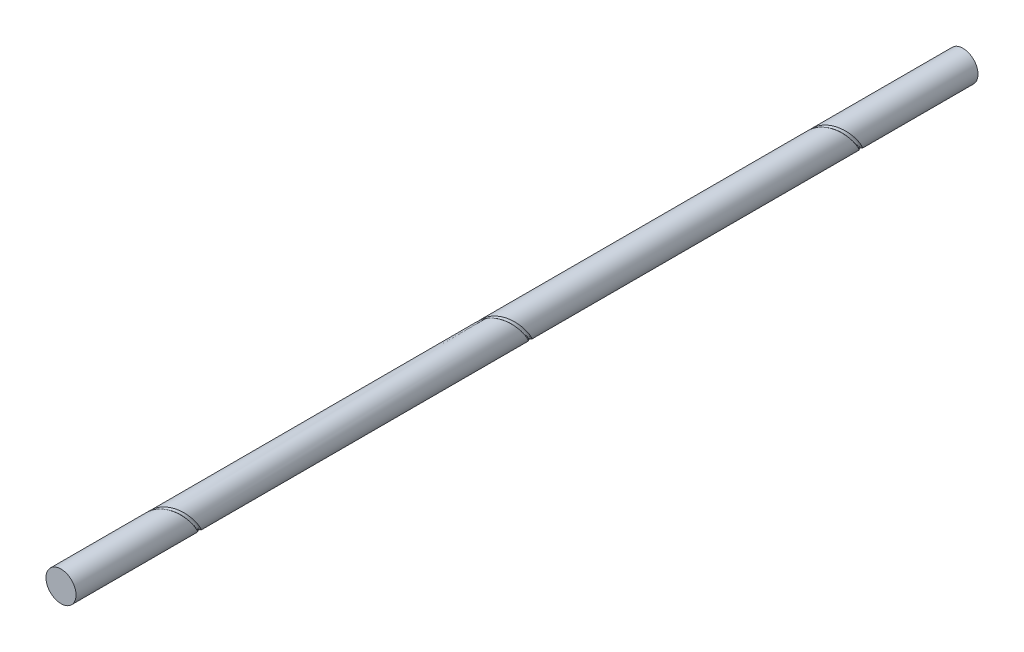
ISO-10303-21;
HEADER;
FILE_DESCRIPTION(('STEP AP214'),'2;1');
FILE_NAME('part.step','',(''),(''),'','','');
FILE_SCHEMA(('AUTOMOTIVE_DESIGN { 1 0 10303 214 1 1 1 1 }'));
ENDSEC;
DATA;
#1=APPLICATION_CONTEXT('core data for automotive mechanical design processes');
#2=APPLICATION_PROTOCOL_DEFINITION('international standard','automotive_design',2000,#1);
#3=PRODUCT_CONTEXT('',#1,'mechanical');
#4=PRODUCT('Part','Part','',(#3));
#5=PRODUCT_RELATED_PRODUCT_CATEGORY('part','',(#4));
#6=PRODUCT_DEFINITION_FORMATION('','',#4);
#7=PRODUCT_DEFINITION_CONTEXT('part definition',#1,'design');
#8=PRODUCT_DEFINITION('design','',#6,#7);
#9=PRODUCT_DEFINITION_SHAPE('','',#8);
#10=(LENGTH_UNIT() NAMED_UNIT(*) SI_UNIT(.MILLI.,.METRE.));
#11=(NAMED_UNIT(*) PLANE_ANGLE_UNIT() SI_UNIT($,.RADIAN.));
#12=(NAMED_UNIT(*) SI_UNIT($,.STERADIAN.) SOLID_ANGLE_UNIT());
#13=UNCERTAINTY_MEASURE_WITH_UNIT(LENGTH_MEASURE(1.E-05),#10,'distance_accuracy_value','');
#14=(GEOMETRIC_REPRESENTATION_CONTEXT(3) GLOBAL_UNCERTAINTY_ASSIGNED_CONTEXT((#13)) GLOBAL_UNIT_ASSIGNED_CONTEXT((#10,
#11,#12)) REPRESENTATION_CONTEXT('',''));
#15=CARTESIAN_POINT('',(0.,0.,0.));
#16=DIRECTION('',(0.,0.,1.));
#17=DIRECTION('',(1.,0.,0.));
#18=AXIS2_PLACEMENT_3D('',#15,#16,#17);
#19=CARTESIAN_POINT('',(0.,0.,1500.));
#20=DIRECTION('',(0.,0.,-1.));
#21=DIRECTION('',(-1.,0.,0.));
#22=AXIS2_PLACEMENT_3D('',#19,#20,#21);
#23=CYLINDRICAL_SURFACE('',#22,25.);
#24=CARTESIAN_POINT('',(-25.,0.,702.958317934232));
#25=CARTESIAN_POINT('',(-25.,-2.31659115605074,704.428906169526));
#26=CARTESIAN_POINT('',(-24.5743274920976,-4.59373794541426,705.89949440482));
#27=CARTESIAN_POINT('',(-24.1486549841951,-6.87088473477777,707.370082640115));
#28=CARTESIAN_POINT('',(-23.3118057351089,-9.03104165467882,708.840670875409));
#29=CARTESIAN_POINT('',(-22.4749564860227,-11.1911985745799,710.311259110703));
#30=CARTESIAN_POINT('',(-21.2554283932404,-13.1608040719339,711.781847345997));
#31=CARTESIAN_POINT('',(-20.035900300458,-15.1304095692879,713.252435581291));
#32=CARTESIAN_POINT('',(-18.4752229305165,-16.8423910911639,714.723023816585));
#33=CARTESIAN_POINT('',(-16.914545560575,-18.55437261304,716.193612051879));
#34=CARTESIAN_POINT('',(-15.0658659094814,-19.950430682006,717.664200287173));
#35=CARTESIAN_POINT('',(-13.2171862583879,-21.346488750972,719.134788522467));
#36=CARTESIAN_POINT('',(-11.1434588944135,-22.3790822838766,720.605376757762));
#37=CARTESIAN_POINT('',(-9.06973153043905,-23.4116758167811,722.075964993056));
#38=CARTESIAN_POINT('',(-6.84157475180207,-24.0456410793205,723.54655322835));
#39=CARTESIAN_POINT('',(-4.6134179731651,-24.6796063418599,725.017141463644));
#40=CARTESIAN_POINT('',(-2.30670898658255,-24.8933544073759,726.487729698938));
#41=CARTESIAN_POINT('',(0.,-25.1071024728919,727.958317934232));
#42=CARTESIAN_POINT('',(2.30670898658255,-24.8933544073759,729.428906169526));
#43=CARTESIAN_POINT('',(4.6134179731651,-24.6796063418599,730.899494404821));
#44=CARTESIAN_POINT('',(6.84157475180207,-24.0456410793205,732.370082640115));
#45=CARTESIAN_POINT('',(9.06973153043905,-23.4116758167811,733.840670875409));
#46=CARTESIAN_POINT('',(11.1434588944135,-22.3790822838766,735.311259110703));
#47=CARTESIAN_POINT('',(13.2171862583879,-21.346488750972,736.781847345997));
#48=CARTESIAN_POINT('',(15.0658659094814,-19.950430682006,738.252435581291));
#49=CARTESIAN_POINT('',(16.914545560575,-18.55437261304,739.723023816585));
#50=CARTESIAN_POINT('',(18.4752229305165,-16.8423910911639,741.193612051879));
#51=CARTESIAN_POINT('',(20.035900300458,-15.1304095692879,742.664200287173));
#52=CARTESIAN_POINT('',(21.2554283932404,-13.1608040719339,744.134788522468));
#53=CARTESIAN_POINT('',(22.4749564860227,-11.1911985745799,745.605376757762));
#54=CARTESIAN_POINT('',(23.3118057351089,-9.03104165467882,747.075964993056));
#55=CARTESIAN_POINT('',(24.1486549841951,-6.87088473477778,748.54655322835));
#56=CARTESIAN_POINT('',(24.5743274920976,-4.59373794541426,750.017141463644));
#57=CARTESIAN_POINT('',(25.,-2.31659115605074,751.487729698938));
#58=CARTESIAN_POINT('',(25.,0.,752.958317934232));
#59=CARTESIAN_POINT('',(25.,2.31659115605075,754.428906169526));
#60=CARTESIAN_POINT('',(24.5743274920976,4.59373794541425,755.89949440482));
#61=CARTESIAN_POINT('',(24.1486549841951,6.87088473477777,757.370082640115));
#62=CARTESIAN_POINT('',(23.3118057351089,9.03104165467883,758.840670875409));
#63=CARTESIAN_POINT('',(22.4749564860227,11.1911985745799,760.311259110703));
#64=CARTESIAN_POINT('',(21.2554283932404,13.1608040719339,761.781847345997));
#65=CARTESIAN_POINT('',(20.035900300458,15.1304095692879,763.252435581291));
#66=CARTESIAN_POINT('',(18.4752229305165,16.8423910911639,764.723023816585));
#67=CARTESIAN_POINT('',(16.914545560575,18.55437261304,766.193612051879));
#68=CARTESIAN_POINT('',(15.0658659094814,19.950430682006,767.664200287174));
#69=CARTESIAN_POINT('',(13.2171862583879,21.346488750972,769.134788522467));
#70=CARTESIAN_POINT('',(11.1434588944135,22.3790822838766,770.605376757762));
#71=CARTESIAN_POINT('',(9.06973153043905,23.4116758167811,772.075964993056));
#72=CARTESIAN_POINT('',(6.84157475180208,24.0456410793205,773.54655322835));
#73=CARTESIAN_POINT('',(4.61341797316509,24.6796063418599,775.017141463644));
#74=CARTESIAN_POINT('',(2.30670898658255,24.8933544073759,776.487729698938));
#75=CARTESIAN_POINT('',(0.,25.1071024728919,777.958317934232));
#76=CARTESIAN_POINT('',(-2.30670898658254,24.8933544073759,779.428906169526));
#77=CARTESIAN_POINT('',(-4.61341797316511,24.6796063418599,780.89949440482));
#78=CARTESIAN_POINT('',(-6.84157475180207,24.0456410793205,782.370082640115));
#79=CARTESIAN_POINT('',(-9.06973153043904,23.4116758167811,783.840670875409));
#80=CARTESIAN_POINT('',(-11.1434588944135,22.3790822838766,785.311259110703));
#81=CARTESIAN_POINT('',(-13.2171862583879,21.346488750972,786.781847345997));
#82=CARTESIAN_POINT('',(-15.0658659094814,19.950430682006,788.252435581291));
#83=CARTESIAN_POINT('',(-16.914545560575,18.5543726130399,789.723023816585));
#84=CARTESIAN_POINT('',(-18.4752229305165,16.8423910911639,791.193612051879));
#85=CARTESIAN_POINT('',(-20.035900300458,15.1304095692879,792.664200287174));
#86=CARTESIAN_POINT('',(-21.2554283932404,13.1608040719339,794.134788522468));
#87=CARTESIAN_POINT('',(-22.4749564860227,11.1911985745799,795.605376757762));
#88=CARTESIAN_POINT('',(-23.3118057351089,9.03104165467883,797.075964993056));
#89=CARTESIAN_POINT('',(-24.1486549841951,6.87088473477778,798.54655322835));
#90=CARTESIAN_POINT('',(-24.5743274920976,4.59373794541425,800.017141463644));
#91=CARTESIAN_POINT('',(-25.,2.31659115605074,801.487729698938));
#92=CARTESIAN_POINT('',(-25.,0.,802.958317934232));
#93=(BOUNDED_CURVE() B_SPLINE_CURVE(2,(#24,#25,#26,#27,#28,#29,#30,#31,#32,#33,#34,#35,#36,#37,
#38,#39,#40,#41,#42,#43,#44,#45,#46,#47,#48,#49,#50,#51,#52,#53,#54,#55,#56,#57,#58,#59,#60,#61,
#62,#63,#64,#65,#66,#67,#68,#69,#70,#71,#72,#73,#74,#75,#76,#77,#78,#79,#80,#81,#82,#83,#84,#85,
#86,#87,#88,#89,#90,#91,#92),.UNSPECIFIED.,.F.,.F.) B_SPLINE_CURVE_WITH_KNOTS((3,2,2,2,2,2,2,2,
2,2,2,2,2,2,2,2,2,2,2,2,2,2,2,2,2,2,2,2,2,2,2,2,2,2,3),(0.,0.0294117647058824,
0.0588235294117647,0.0882352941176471,0.117647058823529,0.147058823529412,0.176470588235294,
0.205882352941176,0.235294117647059,0.264705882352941,0.294117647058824,0.323529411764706,
0.352941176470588,0.382352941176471,0.411764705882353,0.441176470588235,0.470588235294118,0.5,
0.529411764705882,0.558823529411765,0.588235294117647,0.617647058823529,0.647058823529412,
0.676470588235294,0.705882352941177,0.735294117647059,0.764705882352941,0.794117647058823,
0.823529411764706,0.852941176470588,0.882352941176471,0.911764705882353,0.941176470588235,
0.970588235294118,1.),
.UNSPECIFIED.) CURVE() GEOMETRIC_REPRESENTATION_ITEM() RATIONAL_B_SPLINE_CURVE((0.6,
0.597440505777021,0.6,0.597440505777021,0.6,0.597440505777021,0.6,0.597440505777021,0.6,
0.597440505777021,0.6,0.597440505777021,0.6,0.597440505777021,0.6,0.597440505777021,0.6,
0.597440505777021,0.6,0.597440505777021,0.6,0.597440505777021,0.6,0.597440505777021,0.6,
0.597440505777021,0.6,0.597440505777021,0.6,0.597440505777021,0.6,0.597440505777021,0.6,
0.597440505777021,0.6,0.597440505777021,0.6,0.597440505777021,0.6,0.597440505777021,0.6,
0.597440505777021,0.6,0.597440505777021,0.6,0.597440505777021,0.6,0.597440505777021,0.6,
0.597440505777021,0.6,0.597440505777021,0.6,0.597440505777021,0.6,0.597440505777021,0.6,
0.597440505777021,0.6,0.597440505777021,0.6,0.597440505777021,0.6,0.597440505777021,0.6,
0.597440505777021,0.6,0.597440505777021,0.6)) REPRESENTATION_ITEM(''));
#94=CARTESIAN_POINT('',(-25.,0.,802.958317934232));
#95=VERTEX_POINT('',#94);
#96=CARTESIAN_POINT('',(-25.,0.,702.958317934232));
#97=VERTEX_POINT('',#96);
#98=EDGE_CURVE('E115',#95,#97,#93,.F.);
#99=ORIENTED_EDGE('',*,*,#98,.F.);
#100=DIRECTION('',(0.,0.,-1.));
#101=VECTOR('',#100,1.);
#102=CARTESIAN_POINT('',(-25.,0.,1500.));
#103=LINE('',#102,#101);
#104=CARTESIAN_POINT('',(-25.,0.,797.041682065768));
#105=VERTEX_POINT('',#104);
#106=EDGE_CURVE('E131',#95,#105,#103,.T.);
#107=ORIENTED_EDGE('',*,*,#106,.T.);
#108=CARTESIAN_POINT('',(-25.,0.,697.041682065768));
#109=CARTESIAN_POINT('',(-25.,-2.31659115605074,698.512270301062));
#110=CARTESIAN_POINT('',(-24.5743274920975,-4.59373794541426,699.982858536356));
#111=CARTESIAN_POINT('',(-24.1486549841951,-6.87088473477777,701.45344677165));
#112=CARTESIAN_POINT('',(-23.3118057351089,-9.03104165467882,702.924035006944));
#113=CARTESIAN_POINT('',(-22.4749564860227,-11.1911985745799,704.394623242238));
#114=CARTESIAN_POINT('',(-21.2554283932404,-13.1608040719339,705.865211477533));
#115=CARTESIAN_POINT('',(-20.035900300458,-15.1304095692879,707.335799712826));
#116=CARTESIAN_POINT('',(-18.4752229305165,-16.8423910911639,708.806387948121));
#117=CARTESIAN_POINT('',(-16.9145455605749,-18.5543726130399,710.276976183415));
#118=CARTESIAN_POINT('',(-15.0658659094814,-19.950430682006,711.747564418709));
#119=CARTESIAN_POINT('',(-13.2171862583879,-21.346488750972,713.218152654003));
#120=CARTESIAN_POINT('',(-11.1434588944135,-22.3790822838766,714.688740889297));
#121=CARTESIAN_POINT('',(-9.06973153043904,-23.4116758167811,716.159329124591));
#122=CARTESIAN_POINT('',(-6.84157475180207,-24.0456410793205,717.629917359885));
#123=CARTESIAN_POINT('',(-4.6134179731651,-24.6796063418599,719.100505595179));
#124=CARTESIAN_POINT('',(-2.30670898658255,-24.8933544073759,720.571093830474));
#125=CARTESIAN_POINT('',(0.,-25.1071024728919,722.041682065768));
#126=CARTESIAN_POINT('',(2.30670898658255,-24.8933544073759,723.512270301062));
#127=CARTESIAN_POINT('',(4.6134179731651,-24.6796063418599,724.982858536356));
#128=CARTESIAN_POINT('',(6.84157475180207,-24.0456410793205,726.45344677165));
#129=CARTESIAN_POINT('',(9.06973153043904,-23.4116758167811,727.924035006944));
#130=CARTESIAN_POINT('',(11.1434588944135,-22.3790822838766,729.394623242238));
#131=CARTESIAN_POINT('',(13.2171862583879,-21.346488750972,730.865211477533));
#132=CARTESIAN_POINT('',(15.0658659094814,-19.950430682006,732.335799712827));
#133=CARTESIAN_POINT('',(16.9145455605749,-18.5543726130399,733.806387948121));
#134=CARTESIAN_POINT('',(18.4752229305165,-16.8423910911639,735.276976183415));
#135=CARTESIAN_POINT('',(20.035900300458,-15.1304095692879,736.747564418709));
#136=CARTESIAN_POINT('',(21.2554283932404,-13.1608040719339,738.218152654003));
#137=CARTESIAN_POINT('',(22.4749564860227,-11.1911985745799,739.688740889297));
#138=CARTESIAN_POINT('',(23.3118057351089,-9.03104165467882,741.159329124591));
#139=CARTESIAN_POINT('',(24.1486549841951,-6.87088473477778,742.629917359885));
#140=CARTESIAN_POINT('',(24.5743274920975,-4.59373794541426,744.100505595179));
#141=CARTESIAN_POINT('',(25.,-2.31659115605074,745.571093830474));
#142=CARTESIAN_POINT('',(25.,0.,747.041682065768));
#143=CARTESIAN_POINT('',(25.,2.31659115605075,748.512270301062));
#144=CARTESIAN_POINT('',(24.5743274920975,4.59373794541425,749.982858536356));
#145=CARTESIAN_POINT('',(24.1486549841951,6.87088473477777,751.45344677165));
#146=CARTESIAN_POINT('',(23.3118057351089,9.03104165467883,752.924035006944));
#147=CARTESIAN_POINT('',(22.4749564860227,11.1911985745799,754.394623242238));
#148=CARTESIAN_POINT('',(21.2554283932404,13.1608040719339,755.865211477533));
#149=CARTESIAN_POINT('',(20.035900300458,15.1304095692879,757.335799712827));
#150=CARTESIAN_POINT('',(18.4752229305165,16.8423910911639,758.806387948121));
#151=CARTESIAN_POINT('',(16.9145455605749,18.5543726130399,760.276976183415));
#152=CARTESIAN_POINT('',(15.0658659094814,19.950430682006,761.747564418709));
#153=CARTESIAN_POINT('',(13.2171862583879,21.346488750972,763.218152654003));
#154=CARTESIAN_POINT('',(11.1434588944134,22.3790822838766,764.688740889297));
#155=CARTESIAN_POINT('',(9.06973153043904,23.4116758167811,766.159329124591));
#156=CARTESIAN_POINT('',(6.84157475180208,24.0456410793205,767.629917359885));
#157=CARTESIAN_POINT('',(4.61341797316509,24.6796063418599,769.100505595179));
#158=CARTESIAN_POINT('',(2.30670898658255,24.8933544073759,770.571093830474));
#159=CARTESIAN_POINT('',(0.,25.1071024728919,772.041682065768));
#160=CARTESIAN_POINT('',(-2.30670898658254,24.8933544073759,773.512270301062));
#161=CARTESIAN_POINT('',(-4.6134179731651,24.6796063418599,774.982858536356));
#162=CARTESIAN_POINT('',(-6.84157475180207,24.0456410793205,776.45344677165));
#163=CARTESIAN_POINT('',(-9.06973153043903,23.4116758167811,777.924035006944));
#164=CARTESIAN_POINT('',(-11.1434588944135,22.3790822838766,779.394623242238));
#165=CARTESIAN_POINT('',(-13.2171862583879,21.346488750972,780.865211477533));
#166=CARTESIAN_POINT('',(-15.0658659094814,19.950430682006,782.335799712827));
#167=CARTESIAN_POINT('',(-16.9145455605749,18.5543726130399,783.806387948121));
#168=CARTESIAN_POINT('',(-18.4752229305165,16.8423910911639,785.276976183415));
#169=CARTESIAN_POINT('',(-20.035900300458,15.1304095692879,786.747564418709));
#170=CARTESIAN_POINT('',(-21.2554283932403,13.1608040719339,788.218152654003));
#171=CARTESIAN_POINT('',(-22.4749564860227,11.1911985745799,789.688740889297));
#172=CARTESIAN_POINT('',(-23.3118057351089,9.03104165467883,791.159329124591));
#173=CARTESIAN_POINT('',(-24.1486549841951,6.87088473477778,792.629917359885));
#174=CARTESIAN_POINT('',(-24.5743274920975,4.59373794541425,794.100505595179));
#175=CARTESIAN_POINT('',(-25.,2.31659115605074,795.571093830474));
#176=CARTESIAN_POINT('',(-25.,0.,797.041682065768));
#177=(BOUNDED_CURVE() B_SPLINE_CURVE(2,(#108,#109,#110,#111,#112,#113,#114,#115,#116,#117,#118,
#119,#120,#121,#122,#123,#124,#125,#126,#127,#128,#129,#130,#131,#132,#133,#134,#135,#136,#137,
#138,#139,#140,#141,#142,#143,#144,#145,#146,#147,#148,#149,#150,#151,#152,#153,#154,#155,#156,
#157,#158,#159,#160,#161,#162,#163,#164,#165,#166,#167,#168,#169,#170,#171,#172,#173,#174,#175,
#176),.UNSPECIFIED.,.F.,.F.) B_SPLINE_CURVE_WITH_KNOTS((3,2,2,2,2,2,2,2,2,2,2,2,2,2,2,2,2,2,2,2,
2,2,2,2,2,2,2,2,2,2,2,2,2,2,3),(0.,0.0294117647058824,0.0588235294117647,0.0882352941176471,
0.117647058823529,0.147058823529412,0.176470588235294,0.205882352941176,0.235294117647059,
0.264705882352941,0.294117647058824,0.323529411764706,0.352941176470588,0.382352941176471,
0.411764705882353,0.441176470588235,0.470588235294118,0.5,0.529411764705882,0.558823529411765,
0.588235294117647,0.617647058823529,0.647058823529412,0.676470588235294,0.705882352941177,
0.735294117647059,0.764705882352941,0.794117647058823,0.823529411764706,0.852941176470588,
0.882352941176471,0.911764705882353,0.941176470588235,0.970588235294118,1.),
.UNSPECIFIED.) CURVE() GEOMETRIC_REPRESENTATION_ITEM() RATIONAL_B_SPLINE_CURVE((0.6,
0.59744050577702,0.6,0.59744050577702,0.6,0.59744050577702,0.6,0.59744050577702,0.6,
0.59744050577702,0.6,0.59744050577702,0.6,0.59744050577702,0.6,0.59744050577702,0.6,
0.59744050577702,0.6,0.59744050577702,0.6,0.59744050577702,0.6,0.59744050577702,0.6,
0.59744050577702,0.6,0.59744050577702,0.6,0.59744050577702,0.6,0.59744050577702,0.6,
0.59744050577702,0.6,0.59744050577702,0.6,0.59744050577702,0.6,0.59744050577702,0.6,
0.59744050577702,0.6,0.59744050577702,0.6,0.59744050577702,0.6,0.59744050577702,0.6,
0.59744050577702,0.6,0.59744050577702,0.6,0.59744050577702,0.6,0.59744050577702,0.6,
0.59744050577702,0.6,0.59744050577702,0.6,0.59744050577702,0.6,0.59744050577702,0.6,
0.59744050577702,0.6,0.59744050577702,0.6)) REPRESENTATION_ITEM(''));
#178=CARTESIAN_POINT('',(-25.,0.,697.041682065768));
#179=VERTEX_POINT('',#178);
#180=EDGE_CURVE('E134',#105,#179,#177,.F.);
#181=ORIENTED_EDGE('',*,*,#180,.T.);
#182=DIRECTION('',(0.,0.,-1.));
#183=VECTOR('',#182,1.);
#184=CARTESIAN_POINT('',(-25.,0.,1500.));
#185=LINE('',#184,#183);
#186=EDGE_CURVE('E124',#97,#179,#185,.T.);
#187=ORIENTED_EDGE('',*,*,#186,.F.);
#188=EDGE_LOOP('',(#99,#107,#181,#187));
#189=FACE_BOUND('',#188,.T.);
#190=CARTESIAN_POINT('',(0.,0.,0.));
#191=DIRECTION('',(0.,0.,1.));
#192=DIRECTION('',(1.,0.,0.));
#193=AXIS2_PLACEMENT_3D('',#190,#191,#192);
#194=CIRCLE('',#193,25.);
#195=CARTESIAN_POINT('',(25.,0.,0.));
#196=VERTEX_POINT('',#195);
#197=EDGE_CURVE('E168',#196,#196,#194,.T.);
#198=ORIENTED_EDGE('',*,*,#197,.T.);
#199=EDGE_LOOP('',(#198));
#200=FACE_BOUND('',#199,.T.);
#201=CARTESIAN_POINT('',(0.,0.,1500.));
#202=DIRECTION('',(0.,0.,1.));
#203=DIRECTION('',(1.,0.,0.));
#204=AXIS2_PLACEMENT_3D('',#201,#202,#203);
#205=CIRCLE('',#204,25.);
#206=CARTESIAN_POINT('',(25.,0.,1500.));
#207=VERTEX_POINT('',#206);
#208=EDGE_CURVE('E167',#207,#207,#205,.T.);
#209=ORIENTED_EDGE('',*,*,#208,.F.);
#210=EDGE_LOOP('',(#209));
#211=FACE_BOUND('',#210,.T.);
#212=CARTESIAN_POINT('',(-25.,0.,152.958317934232));
#213=CARTESIAN_POINT('',(-25.,-2.31659115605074,154.428906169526));
#214=CARTESIAN_POINT('',(-24.5743274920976,-4.59373794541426,155.89949440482));
#215=CARTESIAN_POINT('',(-24.1486549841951,-6.87088473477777,157.370082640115));
#216=CARTESIAN_POINT('',(-23.3118057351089,-9.03104165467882,158.840670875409));
#217=CARTESIAN_POINT('',(-22.4749564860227,-11.1911985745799,160.311259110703));
#218=CARTESIAN_POINT('',(-21.2554283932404,-13.1608040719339,161.781847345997));
#219=CARTESIAN_POINT('',(-20.035900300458,-15.1304095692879,163.252435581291));
#220=CARTESIAN_POINT('',(-18.4752229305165,-16.8423910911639,164.723023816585));
#221=CARTESIAN_POINT('',(-16.914545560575,-18.55437261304,166.193612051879));
#222=CARTESIAN_POINT('',(-15.0658659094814,-19.950430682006,167.664200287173));
#223=CARTESIAN_POINT('',(-13.2171862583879,-21.346488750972,169.134788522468));
#224=CARTESIAN_POINT('',(-11.1434588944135,-22.3790822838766,170.605376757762));
#225=CARTESIAN_POINT('',(-9.06973153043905,-23.4116758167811,172.075964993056));
#226=CARTESIAN_POINT('',(-6.84157475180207,-24.0456410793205,173.54655322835));
#227=CARTESIAN_POINT('',(-4.6134179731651,-24.6796063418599,175.017141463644));
#228=CARTESIAN_POINT('',(-2.30670898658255,-24.8933544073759,176.487729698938));
#229=CARTESIAN_POINT('',(0.,-25.1071024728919,177.958317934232));
#230=CARTESIAN_POINT('',(2.30670898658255,-24.8933544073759,179.428906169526));
#231=CARTESIAN_POINT('',(4.6134179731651,-24.6796063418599,180.89949440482));
#232=CARTESIAN_POINT('',(6.84157475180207,-24.0456410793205,182.370082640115));
#233=CARTESIAN_POINT('',(9.06973153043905,-23.4116758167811,183.840670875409));
#234=CARTESIAN_POINT('',(11.1434588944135,-22.3790822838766,185.311259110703));
#235=CARTESIAN_POINT('',(13.2171862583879,-21.346488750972,186.781847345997));
#236=CARTESIAN_POINT('',(15.0658659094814,-19.950430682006,188.252435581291));
#237=CARTESIAN_POINT('',(16.914545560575,-18.55437261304,189.723023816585));
#238=CARTESIAN_POINT('',(18.4752229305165,-16.8423910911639,191.193612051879));
#239=CARTESIAN_POINT('',(20.035900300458,-15.1304095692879,192.664200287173));
#240=CARTESIAN_POINT('',(21.2554283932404,-13.1608040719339,194.134788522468));
#241=CARTESIAN_POINT('',(22.4749564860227,-11.1911985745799,195.605376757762));
#242=CARTESIAN_POINT('',(23.3118057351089,-9.03104165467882,197.075964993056));
#243=CARTESIAN_POINT('',(24.1486549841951,-6.87088473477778,198.54655322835));
#244=CARTESIAN_POINT('',(24.5743274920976,-4.59373794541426,200.017141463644));
#245=CARTESIAN_POINT('',(25.,-2.31659115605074,201.487729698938));
#246=CARTESIAN_POINT('',(25.,0.,202.958317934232));
#247=CARTESIAN_POINT('',(25.,2.31659115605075,204.428906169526));
#248=CARTESIAN_POINT('',(24.5743274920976,4.59373794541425,205.89949440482));
#249=CARTESIAN_POINT('',(24.1486549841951,6.87088473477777,207.370082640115));
#250=CARTESIAN_POINT('',(23.3118057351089,9.03104165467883,208.840670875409));
#251=CARTESIAN_POINT('',(22.4749564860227,11.1911985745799,210.311259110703));
#252=CARTESIAN_POINT('',(21.2554283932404,13.1608040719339,211.781847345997));
#253=CARTESIAN_POINT('',(20.035900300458,15.1304095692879,213.252435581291));
#254=CARTESIAN_POINT('',(18.4752229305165,16.8423910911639,214.723023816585));
#255=CARTESIAN_POINT('',(16.914545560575,18.55437261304,216.193612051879));
#256=CARTESIAN_POINT('',(15.0658659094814,19.950430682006,217.664200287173));
#257=CARTESIAN_POINT('',(13.2171862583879,21.346488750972,219.134788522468));
#258=CARTESIAN_POINT('',(11.1434588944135,22.3790822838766,220.605376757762));
#259=CARTESIAN_POINT('',(9.06973153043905,23.4116758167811,222.075964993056));
#260=CARTESIAN_POINT('',(6.84157475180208,24.0456410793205,223.54655322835));
#261=CARTESIAN_POINT('',(4.61341797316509,24.6796063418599,225.017141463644));
#262=CARTESIAN_POINT('',(2.30670898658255,24.8933544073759,226.487729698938));
#263=CARTESIAN_POINT('',(0.,25.1071024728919,227.958317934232));
#264=CARTESIAN_POINT('',(-2.30670898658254,24.8933544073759,229.428906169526));
#265=CARTESIAN_POINT('',(-4.61341797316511,24.6796063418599,230.89949440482));
#266=CARTESIAN_POINT('',(-6.84157475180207,24.0456410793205,232.370082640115));
#267=CARTESIAN_POINT('',(-9.06973153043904,23.4116758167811,233.840670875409));
#268=CARTESIAN_POINT('',(-11.1434588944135,22.3790822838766,235.311259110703));
#269=CARTESIAN_POINT('',(-13.2171862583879,21.346488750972,236.781847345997));
#270=CARTESIAN_POINT('',(-15.0658659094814,19.950430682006,238.252435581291));
#271=CARTESIAN_POINT('',(-16.914545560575,18.5543726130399,239.723023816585));
#272=CARTESIAN_POINT('',(-18.4752229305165,16.8423910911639,241.193612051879));
#273=CARTESIAN_POINT('',(-20.035900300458,15.1304095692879,242.664200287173));
#274=CARTESIAN_POINT('',(-21.2554283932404,13.1608040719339,244.134788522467));
#275=CARTESIAN_POINT('',(-22.4749564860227,11.1911985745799,245.605376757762));
#276=CARTESIAN_POINT('',(-23.3118057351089,9.03104165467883,247.075964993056));
#277=CARTESIAN_POINT('',(-24.1486549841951,6.87088473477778,248.54655322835));
#278=CARTESIAN_POINT('',(-24.5743274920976,4.59373794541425,250.017141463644));
#279=CARTESIAN_POINT('',(-25.,2.31659115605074,251.487729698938));
#280=CARTESIAN_POINT('',(-25.,0.,252.958317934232));
#281=(BOUNDED_CURVE() B_SPLINE_CURVE(2,(#212,#213,#214,#215,#216,#217,#218,#219,#220,#221,#222,
#223,#224,#225,#226,#227,#228,#229,#230,#231,#232,#233,#234,#235,#236,#237,#238,#239,#240,#241,
#242,#243,#244,#245,#246,#247,#248,#249,#250,#251,#252,#253,#254,#255,#256,#257,#258,#259,#260,
#261,#262,#263,#264,#265,#266,#267,#268,#269,#270,#271,#272,#273,#274,#275,#276,#277,#278,#279,
#280),.UNSPECIFIED.,.F.,.F.) B_SPLINE_CURVE_WITH_KNOTS((3,2,2,2,2,2,2,2,2,2,2,2,2,2,2,2,2,2,2,2,
2,2,2,2,2,2,2,2,2,2,2,2,2,2,3),(0.,0.0294117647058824,0.0588235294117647,0.0882352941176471,
0.117647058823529,0.147058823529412,0.176470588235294,0.205882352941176,0.235294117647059,
0.264705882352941,0.294117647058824,0.323529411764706,0.352941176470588,0.382352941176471,
0.411764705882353,0.441176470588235,0.470588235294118,0.5,0.529411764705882,0.558823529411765,
0.588235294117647,0.617647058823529,0.647058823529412,0.676470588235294,0.705882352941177,
0.735294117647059,0.764705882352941,0.794117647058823,0.823529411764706,0.852941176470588,
0.882352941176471,0.911764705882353,0.941176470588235,0.970588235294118,1.),
.UNSPECIFIED.) CURVE() GEOMETRIC_REPRESENTATION_ITEM() RATIONAL_B_SPLINE_CURVE((0.6,
0.597440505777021,0.6,0.597440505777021,0.6,0.597440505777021,0.6,0.597440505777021,0.6,
0.597440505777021,0.6,0.597440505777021,0.6,0.597440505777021,0.6,0.597440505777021,0.6,
0.597440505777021,0.6,0.597440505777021,0.6,0.597440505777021,0.6,0.597440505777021,0.6,
0.597440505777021,0.6,0.597440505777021,0.6,0.597440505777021,0.6,0.597440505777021,0.6,
0.597440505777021,0.6,0.597440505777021,0.6,0.597440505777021,0.6,0.597440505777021,0.6,
0.597440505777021,0.6,0.597440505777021,0.6,0.597440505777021,0.6,0.597440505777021,0.6,
0.597440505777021,0.6,0.597440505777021,0.6,0.597440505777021,0.6,0.597440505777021,0.6,
0.597440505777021,0.6,0.597440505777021,0.6,0.597440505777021,0.6,0.597440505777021,0.6,
0.597440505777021,0.6,0.597440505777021,0.6)) REPRESENTATION_ITEM(''));
#282=CARTESIAN_POINT('',(-25.,0.,252.958317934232));
#283=VERTEX_POINT('',#282);
#284=CARTESIAN_POINT('',(-25.,0.,152.958317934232));
#285=VERTEX_POINT('',#284);
#286=EDGE_CURVE('E140',#283,#285,#281,.F.);
#287=ORIENTED_EDGE('',*,*,#286,.F.);
#288=DIRECTION('',(0.,0.,-1.));
#289=VECTOR('',#288,1.);
#290=CARTESIAN_POINT('',(-25.,0.,1500.));
#291=LINE('',#290,#289);
#292=CARTESIAN_POINT('',(-25.,0.,247.041682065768));
#293=VERTEX_POINT('',#292);
#294=EDGE_CURVE('E157',#283,#293,#291,.T.);
#295=ORIENTED_EDGE('',*,*,#294,.T.);
#296=CARTESIAN_POINT('',(-25.,0.,147.041682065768));
#297=CARTESIAN_POINT('',(-25.,-2.31659115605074,148.512270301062));
#298=CARTESIAN_POINT('',(-24.5743274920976,-4.59373794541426,149.982858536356));
#299=CARTESIAN_POINT('',(-24.1486549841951,-6.87088473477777,151.45344677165));
#300=CARTESIAN_POINT('',(-23.3118057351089,-9.03104165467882,152.924035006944));
#301=CARTESIAN_POINT('',(-22.4749564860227,-11.1911985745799,154.394623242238));
#302=CARTESIAN_POINT('',(-21.2554283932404,-13.1608040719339,155.865211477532));
#303=CARTESIAN_POINT('',(-20.035900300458,-15.1304095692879,157.335799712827));
#304=CARTESIAN_POINT('',(-18.4752229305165,-16.8423910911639,158.806387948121));
#305=CARTESIAN_POINT('',(-16.914545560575,-18.5543726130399,160.276976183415));
#306=CARTESIAN_POINT('',(-15.0658659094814,-19.950430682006,161.747564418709));
#307=CARTESIAN_POINT('',(-13.2171862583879,-21.346488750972,163.218152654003));
#308=CARTESIAN_POINT('',(-11.1434588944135,-22.3790822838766,164.688740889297));
#309=CARTESIAN_POINT('',(-9.06973153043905,-23.4116758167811,166.159329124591));
#310=CARTESIAN_POINT('',(-6.84157475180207,-24.0456410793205,167.629917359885));
#311=CARTESIAN_POINT('',(-4.6134179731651,-24.6796063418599,169.100505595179));
#312=CARTESIAN_POINT('',(-2.30670898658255,-24.8933544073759,170.571093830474));
#313=CARTESIAN_POINT('',(0.,-25.1071024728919,172.041682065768));
#314=CARTESIAN_POINT('',(2.30670898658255,-24.8933544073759,173.512270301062));
#315=CARTESIAN_POINT('',(4.6134179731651,-24.6796063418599,174.982858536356));
#316=CARTESIAN_POINT('',(6.84157475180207,-24.0456410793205,176.45344677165));
#317=CARTESIAN_POINT('',(9.06973153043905,-23.4116758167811,177.924035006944));
#318=CARTESIAN_POINT('',(11.1434588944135,-22.3790822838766,179.394623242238));
#319=CARTESIAN_POINT('',(13.2171862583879,-21.346488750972,180.865211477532));
#320=CARTESIAN_POINT('',(15.0658659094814,-19.950430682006,182.335799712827));
#321=CARTESIAN_POINT('',(16.914545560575,-18.5543726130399,183.806387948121));
#322=CARTESIAN_POINT('',(18.4752229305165,-16.8423910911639,185.276976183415));
#323=CARTESIAN_POINT('',(20.035900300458,-15.1304095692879,186.747564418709));
#324=CARTESIAN_POINT('',(21.2554283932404,-13.1608040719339,188.218152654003));
#325=CARTESIAN_POINT('',(22.4749564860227,-11.1911985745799,189.688740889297));
#326=CARTESIAN_POINT('',(23.3118057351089,-9.03104165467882,191.159329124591));
#327=CARTESIAN_POINT('',(24.1486549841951,-6.87088473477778,192.629917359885));
#328=CARTESIAN_POINT('',(24.5743274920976,-4.59373794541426,194.10050559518));
#329=CARTESIAN_POINT('',(25.,-2.31659115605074,195.571093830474));
#330=CARTESIAN_POINT('',(25.,0.,197.041682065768));
#331=CARTESIAN_POINT('',(25.,2.31659115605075,198.512270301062));
#332=CARTESIAN_POINT('',(24.5743274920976,4.59373794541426,199.982858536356));
#333=CARTESIAN_POINT('',(24.1486549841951,6.87088473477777,201.45344677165));
#334=CARTESIAN_POINT('',(23.3118057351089,9.03104165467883,202.924035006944));
#335=CARTESIAN_POINT('',(22.4749564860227,11.1911985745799,204.394623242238));
#336=CARTESIAN_POINT('',(21.2554283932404,13.1608040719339,205.865211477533));
#337=CARTESIAN_POINT('',(20.035900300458,15.1304095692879,207.335799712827));
#338=CARTESIAN_POINT('',(18.4752229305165,16.8423910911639,208.806387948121));
#339=CARTESIAN_POINT('',(16.914545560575,18.55437261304,210.276976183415));
#340=CARTESIAN_POINT('',(15.0658659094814,19.950430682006,211.747564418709));
#341=CARTESIAN_POINT('',(13.2171862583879,21.346488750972,213.218152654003));
#342=CARTESIAN_POINT('',(11.1434588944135,22.3790822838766,214.688740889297));
#343=CARTESIAN_POINT('',(9.06973153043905,23.4116758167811,216.159329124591));
#344=CARTESIAN_POINT('',(6.84157475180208,24.0456410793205,217.629917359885));
#345=CARTESIAN_POINT('',(4.61341797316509,24.6796063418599,219.10050559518));
#346=CARTESIAN_POINT('',(2.30670898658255,24.8933544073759,220.571093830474));
#347=CARTESIAN_POINT('',(0.,25.1071024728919,222.041682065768));
#348=CARTESIAN_POINT('',(-2.30670898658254,24.8933544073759,223.512270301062));
#349=CARTESIAN_POINT('',(-4.6134179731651,24.6796063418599,224.982858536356));
#350=CARTESIAN_POINT('',(-6.84157475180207,24.0456410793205,226.45344677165));
#351=CARTESIAN_POINT('',(-9.06973153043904,23.4116758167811,227.924035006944));
#352=CARTESIAN_POINT('',(-11.1434588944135,22.3790822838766,229.394623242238));
#353=CARTESIAN_POINT('',(-13.2171862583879,21.346488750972,230.865211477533));
#354=CARTESIAN_POINT('',(-15.0658659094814,19.950430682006,232.335799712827));
#355=CARTESIAN_POINT('',(-16.914545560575,18.5543726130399,233.806387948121));
#356=CARTESIAN_POINT('',(-18.4752229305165,16.8423910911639,235.276976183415));
#357=CARTESIAN_POINT('',(-20.035900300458,15.1304095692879,236.747564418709));
#358=CARTESIAN_POINT('',(-21.2554283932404,13.1608040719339,238.218152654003));
#359=CARTESIAN_POINT('',(-22.4749564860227,11.1911985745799,239.688740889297));
#360=CARTESIAN_POINT('',(-23.3118057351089,9.03104165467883,241.159329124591));
#361=CARTESIAN_POINT('',(-24.1486549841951,6.87088473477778,242.629917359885));
#362=CARTESIAN_POINT('',(-24.5743274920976,4.59373794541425,244.10050559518));
#363=CARTESIAN_POINT('',(-25.,2.31659115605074,245.571093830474));
#364=CARTESIAN_POINT('',(-25.,0.,247.041682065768));
#365=(BOUNDED_CURVE() B_SPLINE_CURVE(2,(#296,#297,#298,#299,#300,#301,#302,#303,#304,#305,#306,
#307,#308,#309,#310,#311,#312,#313,#314,#315,#316,#317,#318,#319,#320,#321,#322,#323,#324,#325,
#326,#327,#328,#329,#330,#331,#332,#333,#334,#335,#336,#337,#338,#339,#340,#341,#342,#343,#344,
#345,#346,#347,#348,#349,#350,#351,#352,#353,#354,#355,#356,#357,#358,#359,#360,#361,#362,#363,
#364),.UNSPECIFIED.,.F.,.F.) B_SPLINE_CURVE_WITH_KNOTS((3,2,2,2,2,2,2,2,2,2,2,2,2,2,2,2,2,2,2,2,
2,2,2,2,2,2,2,2,2,2,2,2,2,2,3),(0.,0.0294117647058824,0.0588235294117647,0.0882352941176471,
0.117647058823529,0.147058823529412,0.176470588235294,0.205882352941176,0.235294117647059,
0.264705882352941,0.294117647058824,0.323529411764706,0.352941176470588,0.382352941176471,
0.411764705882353,0.441176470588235,0.470588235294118,0.5,0.529411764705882,0.558823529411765,
0.588235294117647,0.617647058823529,0.647058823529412,0.676470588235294,0.705882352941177,
0.735294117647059,0.764705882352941,0.794117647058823,0.823529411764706,0.852941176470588,
0.882352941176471,0.911764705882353,0.941176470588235,0.970588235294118,1.),
.UNSPECIFIED.) CURVE() GEOMETRIC_REPRESENTATION_ITEM() RATIONAL_B_SPLINE_CURVE((0.6,
0.597440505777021,0.6,0.597440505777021,0.6,0.597440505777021,0.6,0.597440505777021,0.6,
0.597440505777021,0.6,0.597440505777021,0.6,0.597440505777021,0.6,0.597440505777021,0.6,
0.597440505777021,0.6,0.597440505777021,0.6,0.597440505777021,0.6,0.597440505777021,0.6,
0.597440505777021,0.6,0.597440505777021,0.6,0.597440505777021,0.6,0.597440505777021,0.6,
0.597440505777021,0.6,0.597440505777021,0.6,0.597440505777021,0.6,0.597440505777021,0.6,
0.597440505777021,0.6,0.597440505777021,0.6,0.597440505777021,0.6,0.597440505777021,0.6,
0.597440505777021,0.6,0.597440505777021,0.6,0.597440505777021,0.6,0.597440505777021,0.6,
0.597440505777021,0.6,0.597440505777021,0.6,0.597440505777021,0.6,0.597440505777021,0.6,
0.597440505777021,0.6,0.597440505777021,0.6)) REPRESENTATION_ITEM(''));
#366=CARTESIAN_POINT('',(-25.,0.,147.041682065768));
#367=VERTEX_POINT('',#366);
#368=EDGE_CURVE('E161',#293,#367,#365,.F.);
#369=ORIENTED_EDGE('',*,*,#368,.T.);
#370=DIRECTION('',(0.,0.,-1.));
#371=VECTOR('',#370,1.);
#372=CARTESIAN_POINT('',(-25.,0.,1500.));
#373=LINE('',#372,#371);
#374=EDGE_CURVE('E149',#285,#367,#373,.T.);
#375=ORIENTED_EDGE('',*,*,#374,.F.);
#376=EDGE_LOOP('',(#287,#295,#369,#375));
#377=FACE_BOUND('',#376,.T.);
#378=CARTESIAN_POINT('',(-25.,0.,1252.95831793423));
#379=CARTESIAN_POINT('',(-25.,-2.31659115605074,1254.42890616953));
#380=CARTESIAN_POINT('',(-24.5743274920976,-4.59373794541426,1255.89949440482));
#381=CARTESIAN_POINT('',(-24.1486549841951,-6.87088473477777,1257.37008264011));
#382=CARTESIAN_POINT('',(-23.3118057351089,-9.03104165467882,1258.84067087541));
#383=CARTESIAN_POINT('',(-22.4749564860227,-11.1911985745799,1260.3112591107));
#384=CARTESIAN_POINT('',(-21.2554283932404,-13.1608040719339,1261.781847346));
#385=CARTESIAN_POINT('',(-20.035900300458,-15.1304095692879,1263.25243558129));
#386=CARTESIAN_POINT('',(-18.4752229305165,-16.8423910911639,1264.72302381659));
#387=CARTESIAN_POINT('',(-16.914545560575,-18.5543726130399,1266.19361205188));
#388=CARTESIAN_POINT('',(-15.0658659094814,-19.950430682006,1267.66420028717));
#389=CARTESIAN_POINT('',(-13.2171862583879,-21.346488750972,1269.13478852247));
#390=CARTESIAN_POINT('',(-11.1434588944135,-22.3790822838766,1270.60537675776));
#391=CARTESIAN_POINT('',(-9.06973153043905,-23.4116758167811,1272.07596499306));
#392=CARTESIAN_POINT('',(-6.84157475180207,-24.0456410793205,1273.54655322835));
#393=CARTESIAN_POINT('',(-4.6134179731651,-24.6796063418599,1275.01714146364));
#394=CARTESIAN_POINT('',(-2.30670898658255,-24.8933544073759,1276.48772969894));
#395=CARTESIAN_POINT('',(0.,-25.1071024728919,1277.95831793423));
#396=CARTESIAN_POINT('',(2.30670898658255,-24.8933544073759,1279.42890616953));
#397=CARTESIAN_POINT('',(4.6134179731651,-24.6796063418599,1280.89949440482));
#398=CARTESIAN_POINT('',(6.84157475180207,-24.0456410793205,1282.37008264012));
#399=CARTESIAN_POINT('',(9.06973153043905,-23.4116758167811,1283.84067087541));
#400=CARTESIAN_POINT('',(11.1434588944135,-22.3790822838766,1285.3112591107));
#401=CARTESIAN_POINT('',(13.2171862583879,-21.346488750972,1286.781847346));
#402=CARTESIAN_POINT('',(15.0658659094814,-19.950430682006,1288.25243558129));
#403=CARTESIAN_POINT('',(16.914545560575,-18.5543726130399,1289.72302381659));
#404=CARTESIAN_POINT('',(18.4752229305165,-16.8423910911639,1291.19361205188));
#405=CARTESIAN_POINT('',(20.035900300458,-15.1304095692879,1292.66420028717));
#406=CARTESIAN_POINT('',(21.2554283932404,-13.1608040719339,1294.13478852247));
#407=CARTESIAN_POINT('',(22.4749564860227,-11.1911985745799,1295.60537675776));
#408=CARTESIAN_POINT('',(23.3118057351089,-9.03104165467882,1297.07596499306));
#409=CARTESIAN_POINT('',(24.1486549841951,-6.87088473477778,1298.54655322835));
#410=CARTESIAN_POINT('',(24.5743274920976,-4.59373794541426,1300.01714146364));
#411=CARTESIAN_POINT('',(25.,-2.31659115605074,1301.48772969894));
#412=CARTESIAN_POINT('',(25.,0.,1302.95831793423));
#413=CARTESIAN_POINT('',(25.,2.31659115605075,1304.42890616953));
#414=CARTESIAN_POINT('',(24.5743274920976,4.59373794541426,1305.89949440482));
#415=CARTESIAN_POINT('',(24.1486549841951,6.87088473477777,1307.37008264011));
#416=CARTESIAN_POINT('',(23.3118057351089,9.03104165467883,1308.84067087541));
#417=CARTESIAN_POINT('',(22.4749564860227,11.1911985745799,1310.3112591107));
#418=CARTESIAN_POINT('',(21.2554283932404,13.1608040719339,1311.781847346));
#419=CARTESIAN_POINT('',(20.035900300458,15.1304095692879,1313.25243558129));
#420=CARTESIAN_POINT('',(18.4752229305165,16.8423910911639,1314.72302381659));
#421=CARTESIAN_POINT('',(16.914545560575,18.55437261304,1316.19361205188));
#422=CARTESIAN_POINT('',(15.0658659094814,19.950430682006,1317.66420028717));
#423=CARTESIAN_POINT('',(13.2171862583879,21.346488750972,1319.13478852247));
#424=CARTESIAN_POINT('',(11.1434588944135,22.3790822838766,1320.60537675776));
#425=CARTESIAN_POINT('',(9.06973153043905,23.4116758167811,1322.07596499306));
#426=CARTESIAN_POINT('',(6.84157475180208,24.0456410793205,1323.54655322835));
#427=CARTESIAN_POINT('',(4.61341797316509,24.6796063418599,1325.01714146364));
#428=CARTESIAN_POINT('',(2.30670898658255,24.8933544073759,1326.48772969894));
#429=CARTESIAN_POINT('',(0.,25.1071024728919,1327.95831793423));
#430=CARTESIAN_POINT('',(-2.30670898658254,24.8933544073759,1329.42890616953));
#431=CARTESIAN_POINT('',(-4.6134179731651,24.6796063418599,1330.89949440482));
#432=CARTESIAN_POINT('',(-6.84157475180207,24.0456410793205,1332.37008264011));
#433=CARTESIAN_POINT('',(-9.06973153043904,23.4116758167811,1333.84067087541));
#434=CARTESIAN_POINT('',(-11.1434588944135,22.3790822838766,1335.3112591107));
#435=CARTESIAN_POINT('',(-13.2171862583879,21.346488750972,1336.781847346));
#436=CARTESIAN_POINT('',(-15.0658659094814,19.950430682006,1338.25243558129));
#437=CARTESIAN_POINT('',(-16.914545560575,18.5543726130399,1339.72302381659));
#438=CARTESIAN_POINT('',(-18.4752229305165,16.8423910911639,1341.19361205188));
#439=CARTESIAN_POINT('',(-20.035900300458,15.1304095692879,1342.66420028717));
#440=CARTESIAN_POINT('',(-21.2554283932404,13.1608040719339,1344.13478852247));
#441=CARTESIAN_POINT('',(-22.4749564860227,11.1911985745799,1345.60537675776));
#442=CARTESIAN_POINT('',(-23.3118057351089,9.03104165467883,1347.07596499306));
#443=CARTESIAN_POINT('',(-24.1486549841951,6.87088473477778,1348.54655322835));
#444=CARTESIAN_POINT('',(-24.5743274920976,4.59373794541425,1350.01714146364));
#445=CARTESIAN_POINT('',(-25.,2.31659115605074,1351.48772969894));
#446=CARTESIAN_POINT('',(-25.,0.,1352.95831793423));
#447=(BOUNDED_CURVE() B_SPLINE_CURVE(2,(#378,#379,#380,#381,#382,#383,#384,#385,#386,#387,#388,
#389,#390,#391,#392,#393,#394,#395,#396,#397,#398,#399,#400,#401,#402,#403,#404,#405,#406,#407,
#408,#409,#410,#411,#412,#413,#414,#415,#416,#417,#418,#419,#420,#421,#422,#423,#424,#425,#426,
#427,#428,#429,#430,#431,#432,#433,#434,#435,#436,#437,#438,#439,#440,#441,#442,#443,#444,#445,
#446),.UNSPECIFIED.,.F.,.F.) B_SPLINE_CURVE_WITH_KNOTS((3,2,2,2,2,2,2,2,2,2,2,2,2,2,2,2,2,2,2,2,
2,2,2,2,2,2,2,2,2,2,2,2,2,2,3),(0.,0.0294117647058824,0.0588235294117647,0.0882352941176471,
0.117647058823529,0.147058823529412,0.176470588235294,0.205882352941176,0.235294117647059,
0.264705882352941,0.294117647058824,0.323529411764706,0.352941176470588,0.382352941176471,
0.411764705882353,0.441176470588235,0.470588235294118,0.5,0.529411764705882,0.558823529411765,
0.588235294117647,0.617647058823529,0.647058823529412,0.676470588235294,0.705882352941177,
0.735294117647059,0.764705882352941,0.794117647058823,0.823529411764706,0.852941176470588,
0.882352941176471,0.911764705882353,0.941176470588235,0.970588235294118,1.),
.UNSPECIFIED.) CURVE() GEOMETRIC_REPRESENTATION_ITEM() RATIONAL_B_SPLINE_CURVE((0.6,
0.597440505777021,0.6,0.597440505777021,0.6,0.597440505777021,0.6,0.597440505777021,0.6,
0.597440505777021,0.6,0.597440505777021,0.6,0.597440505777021,0.6,0.597440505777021,0.6,
0.597440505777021,0.6,0.597440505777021,0.6,0.597440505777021,0.6,0.597440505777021,0.6,
0.597440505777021,0.6,0.597440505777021,0.6,0.597440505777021,0.6,0.597440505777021,0.6,
0.597440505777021,0.6,0.597440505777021,0.6,0.597440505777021,0.6,0.597440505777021,0.6,
0.597440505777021,0.6,0.597440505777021,0.6,0.597440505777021,0.6,0.597440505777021,0.6,
0.597440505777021,0.6,0.597440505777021,0.6,0.597440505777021,0.6,0.597440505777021,0.6,
0.597440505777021,0.6,0.597440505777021,0.6,0.597440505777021,0.6,0.597440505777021,0.6,
0.597440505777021,0.6,0.597440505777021,0.6)) REPRESENTATION_ITEM(''));
#448=CARTESIAN_POINT('',(-25.0000000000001,0.,1352.95831793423));
#449=VERTEX_POINT('',#448);
#450=CARTESIAN_POINT('',(-25.0000000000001,0.,1252.95831793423));
#451=VERTEX_POINT('',#450);
#452=EDGE_CURVE('E11',#449,#451,#447,.F.);
#453=ORIENTED_EDGE('',*,*,#452,.F.);
#454=DIRECTION('',(0.,0.,-1.));
#455=VECTOR('',#454,1.);
#456=CARTESIAN_POINT('',(-25.,0.,1500.));
#457=LINE('',#456,#455);
#458=CARTESIAN_POINT('',(-24.9999999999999,0.,1347.04168206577));
#459=VERTEX_POINT('',#458);
#460=EDGE_CURVE('E105',#449,#459,#457,.T.);
#461=ORIENTED_EDGE('',*,*,#460,.T.);
#462=CARTESIAN_POINT('',(-25.,0.,1247.04168206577));
#463=CARTESIAN_POINT('',(-25.,-2.31659115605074,1248.51227030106));
#464=CARTESIAN_POINT('',(-24.5743274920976,-4.59373794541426,1249.98285853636));
#465=CARTESIAN_POINT('',(-24.1486549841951,-6.87088473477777,1251.45344677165));
#466=CARTESIAN_POINT('',(-23.3118057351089,-9.03104165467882,1252.92403500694));
#467=CARTESIAN_POINT('',(-22.4749564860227,-11.1911985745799,1254.39462324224));
#468=CARTESIAN_POINT('',(-21.2554283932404,-13.1608040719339,1255.86521147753));
#469=CARTESIAN_POINT('',(-20.035900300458,-15.1304095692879,1257.33579971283));
#470=CARTESIAN_POINT('',(-18.4752229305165,-16.8423910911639,1258.80638794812));
#471=CARTESIAN_POINT('',(-16.914545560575,-18.5543726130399,1260.27697618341));
#472=CARTESIAN_POINT('',(-15.0658659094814,-19.950430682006,1261.74756441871));
#473=CARTESIAN_POINT('',(-13.2171862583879,-21.346488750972,1263.218152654));
#474=CARTESIAN_POINT('',(-11.1434588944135,-22.3790822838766,1264.6887408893));
#475=CARTESIAN_POINT('',(-9.06973153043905,-23.4116758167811,1266.15932912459));
#476=CARTESIAN_POINT('',(-6.84157475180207,-24.0456410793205,1267.62991735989));
#477=CARTESIAN_POINT('',(-4.6134179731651,-24.6796063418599,1269.10050559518));
#478=CARTESIAN_POINT('',(-2.30670898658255,-24.8933544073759,1270.57109383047));
#479=CARTESIAN_POINT('',(0.,-25.1071024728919,1272.04168206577));
#480=CARTESIAN_POINT('',(2.30670898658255,-24.8933544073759,1273.51227030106));
#481=CARTESIAN_POINT('',(4.6134179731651,-24.6796063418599,1274.98285853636));
#482=CARTESIAN_POINT('',(6.84157475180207,-24.0456410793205,1276.45344677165));
#483=CARTESIAN_POINT('',(9.06973153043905,-23.4116758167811,1277.92403500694));
#484=CARTESIAN_POINT('',(11.1434588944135,-22.3790822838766,1279.39462324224));
#485=CARTESIAN_POINT('',(13.2171862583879,-21.346488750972,1280.86521147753));
#486=CARTESIAN_POINT('',(15.0658659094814,-19.950430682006,1282.33579971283));
#487=CARTESIAN_POINT('',(16.914545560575,-18.5543726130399,1283.80638794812));
#488=CARTESIAN_POINT('',(18.4752229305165,-16.8423910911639,1285.27697618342));
#489=CARTESIAN_POINT('',(20.035900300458,-15.1304095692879,1286.74756441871));
#490=CARTESIAN_POINT('',(21.2554283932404,-13.1608040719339,1288.218152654));
#491=CARTESIAN_POINT('',(22.4749564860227,-11.1911985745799,1289.6887408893));
#492=CARTESIAN_POINT('',(23.3118057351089,-9.03104165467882,1291.15932912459));
#493=CARTESIAN_POINT('',(24.1486549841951,-6.87088473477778,1292.62991735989));
#494=CARTESIAN_POINT('',(24.5743274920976,-4.59373794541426,1294.10050559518));
#495=CARTESIAN_POINT('',(25.,-2.31659115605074,1295.57109383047));
#496=CARTESIAN_POINT('',(25.,0.,1297.04168206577));
#497=CARTESIAN_POINT('',(25.,2.31659115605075,1298.51227030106));
#498=CARTESIAN_POINT('',(24.5743274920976,4.59373794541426,1299.98285853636));
#499=CARTESIAN_POINT('',(24.1486549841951,6.87088473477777,1301.45344677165));
#500=CARTESIAN_POINT('',(23.3118057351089,9.03104165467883,1302.92403500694));
#501=CARTESIAN_POINT('',(22.4749564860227,11.1911985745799,1304.39462324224));
#502=CARTESIAN_POINT('',(21.2554283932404,13.1608040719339,1305.86521147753));
#503=CARTESIAN_POINT('',(20.035900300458,15.1304095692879,1307.33579971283));
#504=CARTESIAN_POINT('',(18.4752229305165,16.8423910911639,1308.80638794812));
#505=CARTESIAN_POINT('',(16.914545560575,18.55437261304,1310.27697618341));
#506=CARTESIAN_POINT('',(15.0658659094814,19.950430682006,1311.74756441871));
#507=CARTESIAN_POINT('',(13.2171862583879,21.346488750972,1313.218152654));
#508=CARTESIAN_POINT('',(11.1434588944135,22.3790822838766,1314.6887408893));
#509=CARTESIAN_POINT('',(9.06973153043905,23.4116758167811,1316.15932912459));
#510=CARTESIAN_POINT('',(6.84157475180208,24.0456410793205,1317.62991735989));
#511=CARTESIAN_POINT('',(4.61341797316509,24.6796063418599,1319.10050559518));
#512=CARTESIAN_POINT('',(2.30670898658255,24.8933544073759,1320.57109383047));
#513=CARTESIAN_POINT('',(0.,25.1071024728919,1322.04168206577));
#514=CARTESIAN_POINT('',(-2.30670898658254,24.8933544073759,1323.51227030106));
#515=CARTESIAN_POINT('',(-4.6134179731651,24.6796063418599,1324.98285853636));
#516=CARTESIAN_POINT('',(-6.84157475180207,24.0456410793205,1326.45344677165));
#517=CARTESIAN_POINT('',(-9.06973153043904,23.4116758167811,1327.92403500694));
#518=CARTESIAN_POINT('',(-11.1434588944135,22.3790822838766,1329.39462324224));
#519=CARTESIAN_POINT('',(-13.2171862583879,21.346488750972,1330.86521147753));
#520=CARTESIAN_POINT('',(-15.0658659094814,19.950430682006,1332.33579971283));
#521=CARTESIAN_POINT('',(-16.914545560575,18.5543726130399,1333.80638794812));
#522=CARTESIAN_POINT('',(-18.4752229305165,16.8423910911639,1335.27697618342));
#523=CARTESIAN_POINT('',(-20.035900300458,15.1304095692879,1336.74756441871));
#524=CARTESIAN_POINT('',(-21.2554283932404,13.1608040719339,1338.218152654));
#525=CARTESIAN_POINT('',(-22.4749564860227,11.1911985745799,1339.6887408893));
#526=CARTESIAN_POINT('',(-23.3118057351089,9.03104165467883,1341.15932912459));
#527=CARTESIAN_POINT('',(-24.1486549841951,6.87088473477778,1342.62991735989));
#528=CARTESIAN_POINT('',(-24.5743274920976,4.59373794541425,1344.10050559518));
#529=CARTESIAN_POINT('',(-25.,2.31659115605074,1345.57109383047));
#530=CARTESIAN_POINT('',(-25.,0.,1347.04168206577));
#531=(BOUNDED_CURVE() B_SPLINE_CURVE(2,(#462,#463,#464,#465,#466,#467,#468,#469,#470,#471,#472,
#473,#474,#475,#476,#477,#478,#479,#480,#481,#482,#483,#484,#485,#486,#487,#488,#489,#490,#491,
#492,#493,#494,#495,#496,#497,#498,#499,#500,#501,#502,#503,#504,#505,#506,#507,#508,#509,#510,
#511,#512,#513,#514,#515,#516,#517,#518,#519,#520,#521,#522,#523,#524,#525,#526,#527,#528,#529,
#530),.UNSPECIFIED.,.F.,.F.) B_SPLINE_CURVE_WITH_KNOTS((3,2,2,2,2,2,2,2,2,2,2,2,2,2,2,2,2,2,2,2,
2,2,2,2,2,2,2,2,2,2,2,2,2,2,3),(0.,0.0294117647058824,0.0588235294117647,0.0882352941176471,
0.117647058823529,0.147058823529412,0.176470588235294,0.205882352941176,0.235294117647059,
0.264705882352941,0.294117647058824,0.323529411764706,0.352941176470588,0.382352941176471,
0.411764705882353,0.441176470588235,0.470588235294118,0.5,0.529411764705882,0.558823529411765,
0.588235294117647,0.617647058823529,0.647058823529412,0.676470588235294,0.705882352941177,
0.735294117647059,0.764705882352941,0.794117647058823,0.823529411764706,0.852941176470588,
0.882352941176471,0.911764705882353,0.941176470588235,0.970588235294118,1.),
.UNSPECIFIED.) CURVE() GEOMETRIC_REPRESENTATION_ITEM() RATIONAL_B_SPLINE_CURVE((0.6,
0.597440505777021,0.6,0.597440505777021,0.6,0.597440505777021,0.6,0.597440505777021,0.6,
0.597440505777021,0.6,0.597440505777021,0.6,0.597440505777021,0.6,0.597440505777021,0.6,
0.597440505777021,0.6,0.597440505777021,0.6,0.597440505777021,0.6,0.597440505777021,0.6,
0.597440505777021,0.6,0.597440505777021,0.6,0.597440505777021,0.6,0.597440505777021,0.6,
0.597440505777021,0.6,0.597440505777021,0.6,0.597440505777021,0.6,0.597440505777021,0.6,
0.597440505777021,0.6,0.597440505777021,0.6,0.597440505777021,0.6,0.597440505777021,0.6,
0.597440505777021,0.6,0.597440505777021,0.6,0.597440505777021,0.6,0.597440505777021,0.6,
0.597440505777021,0.6,0.597440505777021,0.6,0.597440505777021,0.6,0.597440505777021,0.6,
0.597440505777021,0.6,0.597440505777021,0.6)) REPRESENTATION_ITEM(''));
#532=CARTESIAN_POINT('',(-25.,0.,1247.04168206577));
#533=VERTEX_POINT('',#532);
#534=EDGE_CURVE('E103',#459,#533,#531,.F.);
#535=ORIENTED_EDGE('',*,*,#534,.T.);
#536=DIRECTION('',(0.,0.,-1.));
#537=VECTOR('',#536,1.);
#538=CARTESIAN_POINT('',(-25.,0.,1500.));
#539=LINE('',#538,#537);
#540=EDGE_CURVE('E49',#451,#533,#539,.T.);
#541=ORIENTED_EDGE('',*,*,#540,.F.);
#542=EDGE_LOOP('',(#453,#461,#535,#541));
#543=FACE_BOUND('',#542,.T.);
#544=ADVANCED_FACE('F39',(#189,#200,#211,#377,#543),#23,.T.);
#545=CARTESIAN_POINT('',(0.,0.,1500.));
#546=DIRECTION('',(0.,0.,1.));
#547=DIRECTION('',(1.,0.,0.));
#548=AXIS2_PLACEMENT_3D('',#545,#546,#547);
#549=PLANE('',#548);
#550=ORIENTED_EDGE('',*,*,#208,.T.);
#551=EDGE_LOOP('',(#550));
#552=FACE_BOUND('',#551,.T.);
#553=ADVANCED_FACE('F215',(#552),#549,.T.);
#554=CARTESIAN_POINT('',(0.,0.,0.));
#555=DIRECTION('',(0.,0.,1.));
#556=DIRECTION('',(1.,0.,0.));
#557=AXIS2_PLACEMENT_3D('',#554,#555,#556);
#558=PLANE('',#557);
#559=ORIENTED_EDGE('',*,*,#197,.F.);
#560=EDGE_LOOP('',(#559));
#561=FACE_BOUND('',#560,.T.);
#562=ADVANCED_FACE('F219',(#561),#558,.F.);
#563=CARTESIAN_POINT('',(-27.646,0.,146.031));
#564=DIRECTION('',(0.,-1.,0.));
#565=DIRECTION('',(0.,0.,-1.));
#566=AXIS2_PLACEMENT_3D('',#563,#564,#565);
#567=PLANE('',#566);
#568=ORIENTED_EDGE('',*,*,#374,.T.);
#569=CARTESIAN_POINT('',(-27.646,0.,150.));
#570=DIRECTION('',(0.,1.,0.));
#571=DIRECTION('',(0.,0.,1.));
#572=AXIS2_PLACEMENT_3D('',#569,#570,#571);
#573=CIRCLE('',#572,3.969);
#574=EDGE_CURVE('E180',#285,#367,#573,.T.);
#575=ORIENTED_EDGE('',*,*,#574,.F.);
#576=EDGE_LOOP('',(#568,#575));
#577=FACE_BOUND('',#576,.T.);
#578=ADVANCED_FACE('F225',(#577),#567,.T.);
#579=CARTESIAN_POINT('',(-27.646,0.,246.031));
#580=DIRECTION('',(0.,-1.,0.));
#581=DIRECTION('',(0.,0.,-1.));
#582=AXIS2_PLACEMENT_3D('',#579,#580,#581);
#583=PLANE('',#582);
#584=CARTESIAN_POINT('',(-27.646,0.,250.));
#585=DIRECTION('',(0.,-1.,0.));
#586=DIRECTION('',(0.,0.,1.));
#587=AXIS2_PLACEMENT_3D('',#584,#585,#586);
#588=CIRCLE('',#587,3.969);
#589=EDGE_CURVE('E176',#293,#283,#588,.T.);
#590=ORIENTED_EDGE('',*,*,#589,.F.);
#591=ORIENTED_EDGE('',*,*,#294,.F.);
#592=EDGE_LOOP('',(#590,#591));
#593=FACE_BOUND('',#592,.T.);
#594=ADVANCED_FACE('F210',(#593),#583,.F.);
#595=CARTESIAN_POINT('',(-27.646,0.,153.969));
#596=CARTESIAN_POINT('',(-27.646,-2.56177916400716,155.439588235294));
#597=CARTESIAN_POINT('',(-27.1752743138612,-5.0799391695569,156.910176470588));
#598=CARTESIAN_POINT('',(-26.7045486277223,-7.59809917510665,158.380764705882));
#599=CARTESIAN_POINT('',(-25.7791272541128,-9.98688710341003,159.851352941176));
#600=CARTESIAN_POINT('',(-24.8537058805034,-12.3756750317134,161.321941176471));
#601=CARTESIAN_POINT('',(-23.5051029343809,-14.5537435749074,162.792529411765));
#602=CARTESIAN_POINT('',(-22.1564999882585,-16.7318121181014,164.263117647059));
#603=CARTESIAN_POINT('',(-20.4306405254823,-18.6249897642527,165.733705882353));
#604=CARTESIAN_POINT('',(-18.7047810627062,-20.5181674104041,167.204294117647));
#605=CARTESIAN_POINT('',(-16.6604371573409,-22.0619842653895,168.674882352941));
#606=CARTESIAN_POINT('',(-14.6160932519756,-23.6058011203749,170.145470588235));
#607=CARTESIAN_POINT('',(-12.3228825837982,-24.7476843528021,171.616058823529));
#608=CARTESIAN_POINT('',(-10.0296719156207,-25.8895675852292,173.086647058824));
#609=CARTESIAN_POINT('',(-7.5656870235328,-26.5906317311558,174.557235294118));
#610=CARTESIAN_POINT('',(-5.10170213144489,-27.2916958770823,176.027823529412));
#611=CARTESIAN_POINT('',(-2.55085106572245,-27.5280670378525,177.498411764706));
#612=CARTESIAN_POINT('',(0.,-27.7644381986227,178.969));
#613=CARTESIAN_POINT('',(2.55085106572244,-27.5280670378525,180.439588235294));
#614=CARTESIAN_POINT('',(5.1017021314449,-27.2916958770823,181.910176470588));
#615=CARTESIAN_POINT('',(7.5656870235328,-26.5906317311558,183.380764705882));
#616=CARTESIAN_POINT('',(10.0296719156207,-25.8895675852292,184.851352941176));
#617=CARTESIAN_POINT('',(12.3228825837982,-24.7476843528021,186.321941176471));
#618=CARTESIAN_POINT('',(14.6160932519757,-23.6058011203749,187.792529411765));
#619=CARTESIAN_POINT('',(16.6604371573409,-22.0619842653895,189.263117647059));
#620=CARTESIAN_POINT('',(18.7047810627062,-20.5181674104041,190.733705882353));
#621=CARTESIAN_POINT('',(20.4306405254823,-18.6249897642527,192.204294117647));
#622=CARTESIAN_POINT('',(22.1564999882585,-16.7318121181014,193.674882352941));
#623=CARTESIAN_POINT('',(23.5051029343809,-14.5537435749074,195.145470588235));
#624=CARTESIAN_POINT('',(24.8537058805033,-12.3756750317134,196.616058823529));
#625=CARTESIAN_POINT('',(25.7791272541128,-9.98688710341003,198.086647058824));
#626=CARTESIAN_POINT('',(26.7045486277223,-7.59809917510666,199.557235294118));
#627=CARTESIAN_POINT('',(27.1752743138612,-5.0799391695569,201.027823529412));
#628=CARTESIAN_POINT('',(27.646,-2.56177916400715,202.498411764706));
#629=CARTESIAN_POINT('',(27.646,0.,203.969));
#630=CARTESIAN_POINT('',(27.646,2.56177916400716,205.439588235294));
#631=CARTESIAN_POINT('',(27.1752743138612,5.0799391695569,206.910176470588));
#632=CARTESIAN_POINT('',(26.7045486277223,7.59809917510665,208.380764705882));
#633=CARTESIAN_POINT('',(25.7791272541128,9.98688710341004,209.851352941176));
#634=CARTESIAN_POINT('',(24.8537058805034,12.3756750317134,211.321941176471));
#635=CARTESIAN_POINT('',(23.5051029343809,14.5537435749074,212.792529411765));
#636=CARTESIAN_POINT('',(22.1564999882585,16.7318121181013,214.263117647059));
#637=CARTESIAN_POINT('',(20.4306405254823,18.6249897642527,215.733705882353));
#638=CARTESIAN_POINT('',(18.7047810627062,20.5181674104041,217.204294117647));
#639=CARTESIAN_POINT('',(16.6604371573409,22.0619842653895,218.674882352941));
#640=CARTESIAN_POINT('',(14.6160932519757,23.6058011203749,220.145470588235));
#641=CARTESIAN_POINT('',(12.3228825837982,24.7476843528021,221.616058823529));
#642=CARTESIAN_POINT('',(10.0296719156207,25.8895675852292,223.086647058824));
#643=CARTESIAN_POINT('',(7.56568702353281,26.5906317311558,224.557235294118));
#644=CARTESIAN_POINT('',(5.10170213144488,27.2916958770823,226.027823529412));
#645=CARTESIAN_POINT('',(2.55085106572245,27.5280670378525,227.498411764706));
#646=CARTESIAN_POINT('',(0.,27.7644381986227,228.969));
#647=CARTESIAN_POINT('',(-2.55085106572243,27.5280670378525,230.439588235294));
#648=CARTESIAN_POINT('',(-5.1017021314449,27.2916958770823,231.910176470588));
#649=CARTESIAN_POINT('',(-7.5656870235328,26.5906317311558,233.380764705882));
#650=CARTESIAN_POINT('',(-10.0296719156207,25.8895675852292,234.851352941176));
#651=CARTESIAN_POINT('',(-12.3228825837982,24.7476843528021,236.321941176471));
#652=CARTESIAN_POINT('',(-14.6160932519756,23.6058011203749,237.792529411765));
#653=CARTESIAN_POINT('',(-16.6604371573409,22.0619842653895,239.263117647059));
#654=CARTESIAN_POINT('',(-18.7047810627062,20.5181674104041,240.733705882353));
#655=CARTESIAN_POINT('',(-20.4306405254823,18.6249897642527,242.204294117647));
#656=CARTESIAN_POINT('',(-22.1564999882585,16.7318121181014,243.674882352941));
#657=CARTESIAN_POINT('',(-23.5051029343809,14.5537435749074,245.145470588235));
#658=CARTESIAN_POINT('',(-24.8537058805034,12.3756750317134,246.616058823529));
#659=CARTESIAN_POINT('',(-25.7791272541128,9.98688710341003,248.086647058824));
#660=CARTESIAN_POINT('',(-26.7045486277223,7.59809917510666,249.557235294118));
#661=CARTESIAN_POINT('',(-27.1752743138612,5.0799391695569,251.027823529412));
#662=CARTESIAN_POINT('',(-27.646,2.56177916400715,252.498411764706));
#663=CARTESIAN_POINT('',(-27.646,0.,253.969));
#664=CARTESIAN_POINT('',(-19.708,0.,153.969));
#665=CARTESIAN_POINT('',(-19.708,-1.82621514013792,155.439588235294));
#666=CARTESIAN_POINT('',(-19.3724338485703,-3.62133549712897,156.910176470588));
#667=CARTESIAN_POINT('',(-19.0368676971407,-5.41645585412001,158.380764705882));
#668=CARTESIAN_POINT('',(-18.377162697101,-7.11935075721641,159.851352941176));
#669=CARTESIAN_POINT('',(-17.7174576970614,-8.82224566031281,161.321941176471));
#670=CARTESIAN_POINT('',(-16.7560793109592,-10.3749250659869,162.792529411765));
#671=CARTESIAN_POINT('',(-15.7947009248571,-11.9276044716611,164.263117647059));
#672=CARTESIAN_POINT('',(-14.5643877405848,-13.2771937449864,165.733705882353));
#673=CARTESIAN_POINT('',(-13.3340745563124,-14.6267830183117,167.204294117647));
#674=CARTESIAN_POINT('',(-11.8767234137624,-15.727323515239,168.674882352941));
#675=CARTESIAN_POINT('',(-10.4193722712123,-16.8278640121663,170.145470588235));
#676=CARTESIAN_POINT('',(-8.78461151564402,-17.6418781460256,171.616058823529));
#677=CARTESIAN_POINT('',(-7.14985076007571,-18.4558922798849,173.086647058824));
#678=CARTESIAN_POINT('',(-5.39335020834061,-18.9556597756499,174.557235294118));
#679=CARTESIAN_POINT('',(-3.63684965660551,-19.455427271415,176.027823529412));
#680=CARTESIAN_POINT('',(-1.81842482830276,-19.6239291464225,177.498411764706));
#681=CARTESIAN_POINT('',(0.,-19.7924310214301,178.969));
#682=CARTESIAN_POINT('',(1.81842482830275,-19.6239291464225,180.439588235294));
#683=CARTESIAN_POINT('',(3.63684965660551,-19.455427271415,181.910176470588));
#684=CARTESIAN_POINT('',(5.39335020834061,-18.9556597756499,183.380764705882));
#685=CARTESIAN_POINT('',(7.14985076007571,-18.4558922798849,184.851352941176));
#686=CARTESIAN_POINT('',(8.78461151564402,-17.6418781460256,186.321941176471));
#687=CARTESIAN_POINT('',(10.4193722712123,-16.8278640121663,187.792529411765));
#688=CARTESIAN_POINT('',(11.8767234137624,-15.727323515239,189.263117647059));
#689=CARTESIAN_POINT('',(13.3340745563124,-14.6267830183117,190.733705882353));
#690=CARTESIAN_POINT('',(14.5643877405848,-13.2771937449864,192.204294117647));
#691=CARTESIAN_POINT('',(15.7947009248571,-11.9276044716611,193.674882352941));
#692=CARTESIAN_POINT('',(16.7560793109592,-10.3749250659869,195.145470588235));
#693=CARTESIAN_POINT('',(17.7174576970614,-8.82224566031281,196.616058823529));
#694=CARTESIAN_POINT('',(18.377162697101,-7.11935075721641,198.086647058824));
#695=CARTESIAN_POINT('',(19.0368676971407,-5.41645585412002,199.557235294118));
#696=CARTESIAN_POINT('',(19.3724338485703,-3.62133549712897,201.027823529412));
#697=CARTESIAN_POINT('',(19.708,-1.82621514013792,202.498411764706));
#698=CARTESIAN_POINT('',(19.708,0.,203.969));
#699=CARTESIAN_POINT('',(19.708,1.82621514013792,205.439588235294));
#700=CARTESIAN_POINT('',(19.3724338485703,3.62133549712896,206.910176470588));
#701=CARTESIAN_POINT('',(19.0368676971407,5.41645585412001,208.380764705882));
#702=CARTESIAN_POINT('',(18.377162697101,7.11935075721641,209.851352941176));
#703=CARTESIAN_POINT('',(17.7174576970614,8.82224566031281,211.321941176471));
#704=CARTESIAN_POINT('',(16.7560793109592,10.3749250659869,212.792529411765));
#705=CARTESIAN_POINT('',(15.7947009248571,11.927604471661,214.263117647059));
#706=CARTESIAN_POINT('',(14.5643877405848,13.2771937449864,215.733705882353));
#707=CARTESIAN_POINT('',(13.3340745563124,14.6267830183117,217.204294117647));
#708=CARTESIAN_POINT('',(11.8767234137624,15.727323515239,218.674882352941));
#709=CARTESIAN_POINT('',(10.4193722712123,16.8278640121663,220.145470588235));
#710=CARTESIAN_POINT('',(8.78461151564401,17.6418781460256,221.616058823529));
#711=CARTESIAN_POINT('',(7.14985076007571,18.4558922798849,223.086647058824));
#712=CARTESIAN_POINT('',(5.39335020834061,18.9556597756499,224.557235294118));
#713=CARTESIAN_POINT('',(3.63684965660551,19.455427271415,226.027823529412));
#714=CARTESIAN_POINT('',(1.81842482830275,19.6239291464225,227.498411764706));
#715=CARTESIAN_POINT('',(0.,19.7924310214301,228.969));
#716=CARTESIAN_POINT('',(-1.81842482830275,19.6239291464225,230.439588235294));
#717=CARTESIAN_POINT('',(-3.63684965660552,19.455427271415,231.910176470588));
#718=CARTESIAN_POINT('',(-5.39335020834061,18.9556597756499,233.380764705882));
#719=CARTESIAN_POINT('',(-7.1498507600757,18.4558922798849,234.851352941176));
#720=CARTESIAN_POINT('',(-8.78461151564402,17.6418781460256,236.321941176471));
#721=CARTESIAN_POINT('',(-10.4193722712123,16.8278640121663,237.792529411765));
#722=CARTESIAN_POINT('',(-11.8767234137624,15.727323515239,239.263117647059));
#723=CARTESIAN_POINT('',(-13.3340745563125,14.6267830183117,240.733705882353));
#724=CARTESIAN_POINT('',(-14.5643877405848,13.2771937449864,242.204294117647));
#725=CARTESIAN_POINT('',(-15.7947009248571,11.9276044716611,243.674882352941));
#726=CARTESIAN_POINT('',(-16.7560793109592,10.3749250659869,245.145470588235));
#727=CARTESIAN_POINT('',(-17.7174576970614,8.82224566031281,246.616058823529));
#728=CARTESIAN_POINT('',(-18.377162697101,7.11935075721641,248.086647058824));
#729=CARTESIAN_POINT('',(-19.0368676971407,5.41645585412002,249.557235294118));
#730=CARTESIAN_POINT('',(-19.3724338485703,3.62133549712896,251.027823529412));
#731=CARTESIAN_POINT('',(-19.708,1.82621514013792,252.498411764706));
#732=CARTESIAN_POINT('',(-19.708,0.,253.969));
#733=CARTESIAN_POINT('',(-19.708,0.,146.031));
#734=CARTESIAN_POINT('',(-19.708,-1.82621514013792,147.501588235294));
#735=CARTESIAN_POINT('',(-19.3724338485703,-3.62133549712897,148.972176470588));
#736=CARTESIAN_POINT('',(-19.0368676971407,-5.41645585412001,150.442764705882));
#737=CARTESIAN_POINT('',(-18.377162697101,-7.11935075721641,151.913352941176));
#738=CARTESIAN_POINT('',(-17.7174576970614,-8.82224566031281,153.383941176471));
#739=CARTESIAN_POINT('',(-16.7560793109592,-10.3749250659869,154.854529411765));
#740=CARTESIAN_POINT('',(-15.7947009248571,-11.9276044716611,156.325117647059));
#741=CARTESIAN_POINT('',(-14.5643877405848,-13.2771937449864,157.795705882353));
#742=CARTESIAN_POINT('',(-13.3340745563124,-14.6267830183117,159.266294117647));
#743=CARTESIAN_POINT('',(-11.8767234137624,-15.727323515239,160.736882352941));
#744=CARTESIAN_POINT('',(-10.4193722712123,-16.8278640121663,162.207470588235));
#745=CARTESIAN_POINT('',(-8.78461151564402,-17.6418781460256,163.678058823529));
#746=CARTESIAN_POINT('',(-7.14985076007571,-18.4558922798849,165.148647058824));
#747=CARTESIAN_POINT('',(-5.39335020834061,-18.9556597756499,166.619235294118));
#748=CARTESIAN_POINT('',(-3.63684965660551,-19.455427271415,168.089823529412));
#749=CARTESIAN_POINT('',(-1.81842482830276,-19.6239291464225,169.560411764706));
#750=CARTESIAN_POINT('',(0.,-19.7924310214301,171.031));
#751=CARTESIAN_POINT('',(1.81842482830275,-19.6239291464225,172.501588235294));
#752=CARTESIAN_POINT('',(3.63684965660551,-19.455427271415,173.972176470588));
#753=CARTESIAN_POINT('',(5.39335020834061,-18.9556597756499,175.442764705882));
#754=CARTESIAN_POINT('',(7.14985076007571,-18.4558922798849,176.913352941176));
#755=CARTESIAN_POINT('',(8.78461151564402,-17.6418781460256,178.383941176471));
#756=CARTESIAN_POINT('',(10.4193722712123,-16.8278640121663,179.854529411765));
#757=CARTESIAN_POINT('',(11.8767234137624,-15.727323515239,181.325117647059));
#758=CARTESIAN_POINT('',(13.3340745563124,-14.6267830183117,182.795705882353));
#759=CARTESIAN_POINT('',(14.5643877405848,-13.2771937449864,184.266294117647));
#760=CARTESIAN_POINT('',(15.7947009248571,-11.9276044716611,185.736882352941));
#761=CARTESIAN_POINT('',(16.7560793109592,-10.3749250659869,187.207470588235));
#762=CARTESIAN_POINT('',(17.7174576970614,-8.82224566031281,188.678058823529));
#763=CARTESIAN_POINT('',(18.377162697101,-7.11935075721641,190.148647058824));
#764=CARTESIAN_POINT('',(19.0368676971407,-5.41645585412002,191.619235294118));
#765=CARTESIAN_POINT('',(19.3724338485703,-3.62133549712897,193.089823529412));
#766=CARTESIAN_POINT('',(19.708,-1.82621514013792,194.560411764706));
#767=CARTESIAN_POINT('',(19.708,0.,196.031));
#768=CARTESIAN_POINT('',(19.708,1.82621514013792,197.501588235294));
#769=CARTESIAN_POINT('',(19.3724338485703,3.62133549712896,198.972176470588));
#770=CARTESIAN_POINT('',(19.0368676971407,5.41645585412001,200.442764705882));
#771=CARTESIAN_POINT('',(18.377162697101,7.11935075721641,201.913352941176));
#772=CARTESIAN_POINT('',(17.7174576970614,8.82224566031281,203.383941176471));
#773=CARTESIAN_POINT('',(16.7560793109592,10.3749250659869,204.854529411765));
#774=CARTESIAN_POINT('',(15.7947009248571,11.927604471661,206.325117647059));
#775=CARTESIAN_POINT('',(14.5643877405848,13.2771937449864,207.795705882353));
#776=CARTESIAN_POINT('',(13.3340745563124,14.6267830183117,209.266294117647));
#777=CARTESIAN_POINT('',(11.8767234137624,15.727323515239,210.736882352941));
#778=CARTESIAN_POINT('',(10.4193722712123,16.8278640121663,212.207470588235));
#779=CARTESIAN_POINT('',(8.78461151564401,17.6418781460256,213.678058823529));
#780=CARTESIAN_POINT('',(7.14985076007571,18.4558922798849,215.148647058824));
#781=CARTESIAN_POINT('',(5.39335020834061,18.9556597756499,216.619235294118));
#782=CARTESIAN_POINT('',(3.63684965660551,19.455427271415,218.089823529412));
#783=CARTESIAN_POINT('',(1.81842482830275,19.6239291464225,219.560411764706));
#784=CARTESIAN_POINT('',(0.,19.7924310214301,221.031));
#785=CARTESIAN_POINT('',(-1.81842482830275,19.6239291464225,222.501588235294));
#786=CARTESIAN_POINT('',(-3.63684965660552,19.455427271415,223.972176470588));
#787=CARTESIAN_POINT('',(-5.39335020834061,18.9556597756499,225.442764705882));
#788=CARTESIAN_POINT('',(-7.1498507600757,18.4558922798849,226.913352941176));
#789=CARTESIAN_POINT('',(-8.78461151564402,17.6418781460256,228.383941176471));
#790=CARTESIAN_POINT('',(-10.4193722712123,16.8278640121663,229.854529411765));
#791=CARTESIAN_POINT('',(-11.8767234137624,15.727323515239,231.325117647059));
#792=CARTESIAN_POINT('',(-13.3340745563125,14.6267830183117,232.795705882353));
#793=CARTESIAN_POINT('',(-14.5643877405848,13.2771937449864,234.266294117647));
#794=CARTESIAN_POINT('',(-15.7947009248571,11.9276044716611,235.736882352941));
#795=CARTESIAN_POINT('',(-16.7560793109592,10.3749250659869,237.207470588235));
#796=CARTESIAN_POINT('',(-17.7174576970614,8.82224566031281,238.678058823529));
#797=CARTESIAN_POINT('',(-18.377162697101,7.11935075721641,240.148647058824));
#798=CARTESIAN_POINT('',(-19.0368676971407,5.41645585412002,241.619235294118));
#799=CARTESIAN_POINT('',(-19.3724338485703,3.62133549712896,243.089823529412));
#800=CARTESIAN_POINT('',(-19.708,1.82621514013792,244.560411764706));
#801=CARTESIAN_POINT('',(-19.708,0.,246.031));
#802=CARTESIAN_POINT('',(-27.646,0.,146.031));
#803=CARTESIAN_POINT('',(-27.646,-2.56177916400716,147.501588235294));
#804=CARTESIAN_POINT('',(-27.1752743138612,-5.0799391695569,148.972176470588));
#805=CARTESIAN_POINT('',(-26.7045486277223,-7.59809917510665,150.442764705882));
#806=CARTESIAN_POINT('',(-25.7791272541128,-9.98688710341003,151.913352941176));
#807=CARTESIAN_POINT('',(-24.8537058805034,-12.3756750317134,153.383941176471));
#808=CARTESIAN_POINT('',(-23.5051029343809,-14.5537435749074,154.854529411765));
#809=CARTESIAN_POINT('',(-22.1564999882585,-16.7318121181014,156.325117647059));
#810=CARTESIAN_POINT('',(-20.4306405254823,-18.6249897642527,157.795705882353));
#811=CARTESIAN_POINT('',(-18.7047810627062,-20.5181674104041,159.266294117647));
#812=CARTESIAN_POINT('',(-16.6604371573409,-22.0619842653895,160.736882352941));
#813=CARTESIAN_POINT('',(-14.6160932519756,-23.6058011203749,162.207470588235));
#814=CARTESIAN_POINT('',(-12.3228825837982,-24.7476843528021,163.678058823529));
#815=CARTESIAN_POINT('',(-10.0296719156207,-25.8895675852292,165.148647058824));
#816=CARTESIAN_POINT('',(-7.5656870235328,-26.5906317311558,166.619235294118));
#817=CARTESIAN_POINT('',(-5.10170213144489,-27.2916958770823,168.089823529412));
#818=CARTESIAN_POINT('',(-2.55085106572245,-27.5280670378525,169.560411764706));
#819=CARTESIAN_POINT('',(0.,-27.7644381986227,171.031));
#820=CARTESIAN_POINT('',(2.55085106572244,-27.5280670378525,172.501588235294));
#821=CARTESIAN_POINT('',(5.1017021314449,-27.2916958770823,173.972176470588));
#822=CARTESIAN_POINT('',(7.5656870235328,-26.5906317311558,175.442764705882));
#823=CARTESIAN_POINT('',(10.0296719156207,-25.8895675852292,176.913352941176));
#824=CARTESIAN_POINT('',(12.3228825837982,-24.7476843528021,178.383941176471));
#825=CARTESIAN_POINT('',(14.6160932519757,-23.6058011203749,179.854529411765));
#826=CARTESIAN_POINT('',(16.6604371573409,-22.0619842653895,181.325117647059));
#827=CARTESIAN_POINT('',(18.7047810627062,-20.5181674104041,182.795705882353));
#828=CARTESIAN_POINT('',(20.4306405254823,-18.6249897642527,184.266294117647));
#829=CARTESIAN_POINT('',(22.1564999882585,-16.7318121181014,185.736882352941));
#830=CARTESIAN_POINT('',(23.5051029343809,-14.5537435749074,187.207470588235));
#831=CARTESIAN_POINT('',(24.8537058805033,-12.3756750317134,188.678058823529));
#832=CARTESIAN_POINT('',(25.7791272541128,-9.98688710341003,190.148647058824));
#833=CARTESIAN_POINT('',(26.7045486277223,-7.59809917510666,191.619235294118));
#834=CARTESIAN_POINT('',(27.1752743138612,-5.0799391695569,193.089823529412));
#835=CARTESIAN_POINT('',(27.646,-2.56177916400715,194.560411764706));
#836=CARTESIAN_POINT('',(27.646,0.,196.031));
#837=CARTESIAN_POINT('',(27.646,2.56177916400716,197.501588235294));
#838=CARTESIAN_POINT('',(27.1752743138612,5.0799391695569,198.972176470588));
#839=CARTESIAN_POINT('',(26.7045486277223,7.59809917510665,200.442764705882));
#840=CARTESIAN_POINT('',(25.7791272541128,9.98688710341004,201.913352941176));
#841=CARTESIAN_POINT('',(24.8537058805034,12.3756750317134,203.383941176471));
#842=CARTESIAN_POINT('',(23.5051029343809,14.5537435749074,204.854529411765));
#843=CARTESIAN_POINT('',(22.1564999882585,16.7318121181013,206.325117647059));
#844=CARTESIAN_POINT('',(20.4306405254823,18.6249897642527,207.795705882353));
#845=CARTESIAN_POINT('',(18.7047810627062,20.5181674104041,209.266294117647));
#846=CARTESIAN_POINT('',(16.6604371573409,22.0619842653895,210.736882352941));
#847=CARTESIAN_POINT('',(14.6160932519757,23.6058011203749,212.207470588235));
#848=CARTESIAN_POINT('',(12.3228825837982,24.7476843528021,213.678058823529));
#849=CARTESIAN_POINT('',(10.0296719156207,25.8895675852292,215.148647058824));
#850=CARTESIAN_POINT('',(7.56568702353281,26.5906317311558,216.619235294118));
#851=CARTESIAN_POINT('',(5.10170213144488,27.2916958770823,218.089823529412));
#852=CARTESIAN_POINT('',(2.55085106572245,27.5280670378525,219.560411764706));
#853=CARTESIAN_POINT('',(0.,27.7644381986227,221.031));
#854=CARTESIAN_POINT('',(-2.55085106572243,27.5280670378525,222.501588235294));
#855=CARTESIAN_POINT('',(-5.1017021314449,27.2916958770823,223.972176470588));
#856=CARTESIAN_POINT('',(-7.5656870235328,26.5906317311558,225.442764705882));
#857=CARTESIAN_POINT('',(-10.0296719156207,25.8895675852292,226.913352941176));
#858=CARTESIAN_POINT('',(-12.3228825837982,24.7476843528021,228.383941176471));
#859=CARTESIAN_POINT('',(-14.6160932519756,23.6058011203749,229.854529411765));
#860=CARTESIAN_POINT('',(-16.6604371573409,22.0619842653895,231.325117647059));
#861=CARTESIAN_POINT('',(-18.7047810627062,20.5181674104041,232.795705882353));
#862=CARTESIAN_POINT('',(-20.4306405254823,18.6249897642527,234.266294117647));
#863=CARTESIAN_POINT('',(-22.1564999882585,16.7318121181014,235.736882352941));
#864=CARTESIAN_POINT('',(-23.5051029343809,14.5537435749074,237.207470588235));
#865=CARTESIAN_POINT('',(-24.8537058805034,12.3756750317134,238.678058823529));
#866=CARTESIAN_POINT('',(-25.7791272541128,9.98688710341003,240.148647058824));
#867=CARTESIAN_POINT('',(-26.7045486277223,7.59809917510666,241.619235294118));
#868=CARTESIAN_POINT('',(-27.1752743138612,5.0799391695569,243.089823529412));
#869=CARTESIAN_POINT('',(-27.646,2.56177916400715,244.560411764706));
#870=CARTESIAN_POINT('',(-27.646,0.,246.031));
#871=CARTESIAN_POINT('',(-35.584,0.,146.031));
#872=CARTESIAN_POINT('',(-35.584,-3.29734318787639,147.501588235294));
#873=CARTESIAN_POINT('',(-34.978114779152,-6.53854284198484,148.972176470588));
#874=CARTESIAN_POINT('',(-34.3722295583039,-9.77974249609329,150.442764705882));
#875=CARTESIAN_POINT('',(-33.1810918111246,-12.8544234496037,151.913352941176));
#876=CARTESIAN_POINT('',(-31.9899540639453,-15.929104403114,153.383941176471));
#877=CARTESIAN_POINT('',(-30.2541265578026,-18.7325620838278,154.854529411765));
#878=CARTESIAN_POINT('',(-28.5182990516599,-21.5360197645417,156.325117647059));
#879=CARTESIAN_POINT('',(-26.2968933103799,-23.9727857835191,157.795705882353));
#880=CARTESIAN_POINT('',(-24.0754875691,-26.4095518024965,159.266294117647));
#881=CARTESIAN_POINT('',(-21.4441509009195,-28.39664501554,160.736882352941));
#882=CARTESIAN_POINT('',(-18.812814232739,-30.3837382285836,162.207470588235));
#883=CARTESIAN_POINT('',(-15.8611536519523,-31.8534905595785,163.678058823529));
#884=CARTESIAN_POINT('',(-12.9094930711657,-33.3232428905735,165.148647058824));
#885=CARTESIAN_POINT('',(-9.73802383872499,-34.2256036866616,166.619235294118));
#886=CARTESIAN_POINT('',(-6.56655460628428,-35.1279644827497,168.089823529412));
#887=CARTESIAN_POINT('',(-3.28327730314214,-35.4322049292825,169.560411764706));
#888=CARTESIAN_POINT('',(0.,-35.7364453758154,171.031));
#889=CARTESIAN_POINT('',(3.28327730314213,-35.4322049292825,172.501588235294));
#890=CARTESIAN_POINT('',(6.56655460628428,-35.1279644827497,173.972176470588));
#891=CARTESIAN_POINT('',(9.738023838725,-34.2256036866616,175.442764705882));
#892=CARTESIAN_POINT('',(12.9094930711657,-33.3232428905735,176.913352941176));
#893=CARTESIAN_POINT('',(15.8611536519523,-31.8534905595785,178.383941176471));
#894=CARTESIAN_POINT('',(18.812814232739,-30.3837382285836,179.854529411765));
#895=CARTESIAN_POINT('',(21.4441509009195,-28.3966450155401,181.325117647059));
#896=CARTESIAN_POINT('',(24.0754875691,-26.4095518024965,182.795705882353));
#897=CARTESIAN_POINT('',(26.2968933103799,-23.9727857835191,184.266294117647));
#898=CARTESIAN_POINT('',(28.5182990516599,-21.5360197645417,185.736882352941));
#899=CARTESIAN_POINT('',(30.2541265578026,-18.7325620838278,187.207470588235));
#900=CARTESIAN_POINT('',(31.9899540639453,-15.929104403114,188.678058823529));
#901=CARTESIAN_POINT('',(33.1810918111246,-12.8544234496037,190.148647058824));
#902=CARTESIAN_POINT('',(34.3722295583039,-9.7797424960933,191.619235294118));
#903=CARTESIAN_POINT('',(34.978114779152,-6.53854284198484,193.089823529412));
#904=CARTESIAN_POINT('',(35.584,-3.29734318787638,194.560411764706));
#905=CARTESIAN_POINT('',(35.584,0.,196.031));
#906=CARTESIAN_POINT('',(35.584,3.29734318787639,197.501588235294));
#907=CARTESIAN_POINT('',(34.978114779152,6.53854284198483,198.972176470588));
#908=CARTESIAN_POINT('',(34.3722295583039,9.77974249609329,200.442764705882));
#909=CARTESIAN_POINT('',(33.1810918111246,12.8544234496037,201.913352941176));
#910=CARTESIAN_POINT('',(31.9899540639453,15.929104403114,203.383941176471));
#911=CARTESIAN_POINT('',(30.2541265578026,18.7325620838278,204.854529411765));
#912=CARTESIAN_POINT('',(28.5182990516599,21.5360197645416,206.325117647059));
#913=CARTESIAN_POINT('',(26.2968933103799,23.9727857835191,207.795705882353));
#914=CARTESIAN_POINT('',(24.0754875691,26.4095518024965,209.266294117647));
#915=CARTESIAN_POINT('',(21.4441509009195,28.39664501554,210.736882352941));
#916=CARTESIAN_POINT('',(18.812814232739,30.3837382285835,212.207470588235));
#917=CARTESIAN_POINT('',(15.8611536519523,31.8534905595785,213.678058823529));
#918=CARTESIAN_POINT('',(12.9094930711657,33.3232428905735,215.148647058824));
#919=CARTESIAN_POINT('',(9.73802383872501,34.2256036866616,216.619235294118));
#920=CARTESIAN_POINT('',(6.56655460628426,35.1279644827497,218.089823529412));
#921=CARTESIAN_POINT('',(3.28327730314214,35.4322049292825,219.560411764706));
#922=CARTESIAN_POINT('',(0.,35.7364453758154,221.031));
#923=CARTESIAN_POINT('',(-3.28327730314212,35.4322049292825,222.501588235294));
#924=CARTESIAN_POINT('',(-6.56655460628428,35.1279644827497,223.972176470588));
#925=CARTESIAN_POINT('',(-9.73802383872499,34.2256036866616,225.442764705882));
#926=CARTESIAN_POINT('',(-12.9094930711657,33.3232428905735,226.913352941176));
#927=CARTESIAN_POINT('',(-15.8611536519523,31.8534905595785,228.383941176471));
#928=CARTESIAN_POINT('',(-18.812814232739,30.3837382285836,229.854529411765));
#929=CARTESIAN_POINT('',(-21.4441509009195,28.3966450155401,231.325117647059));
#930=CARTESIAN_POINT('',(-24.0754875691,26.4095518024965,232.795705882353));
#931=CARTESIAN_POINT('',(-26.2968933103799,23.9727857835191,234.266294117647));
#932=CARTESIAN_POINT('',(-28.5182990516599,21.5360197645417,235.736882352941));
#933=CARTESIAN_POINT('',(-30.2541265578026,18.7325620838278,237.207470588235));
#934=CARTESIAN_POINT('',(-31.9899540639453,15.929104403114,238.678058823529));
#935=CARTESIAN_POINT('',(-33.1810918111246,12.8544234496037,240.148647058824));
#936=CARTESIAN_POINT('',(-34.3722295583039,9.7797424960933,241.619235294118));
#937=CARTESIAN_POINT('',(-34.978114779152,6.53854284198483,243.089823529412));
#938=CARTESIAN_POINT('',(-35.584,3.29734318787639,244.560411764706));
#939=CARTESIAN_POINT('',(-35.584,0.,246.031));
#940=CARTESIAN_POINT('',(-35.584,0.,153.969));
#941=CARTESIAN_POINT('',(-35.584,-3.29734318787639,155.439588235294));
#942=CARTESIAN_POINT('',(-34.978114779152,-6.53854284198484,156.910176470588));
#943=CARTESIAN_POINT('',(-34.3722295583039,-9.77974249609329,158.380764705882));
#944=CARTESIAN_POINT('',(-33.1810918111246,-12.8544234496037,159.851352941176));
#945=CARTESIAN_POINT('',(-31.9899540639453,-15.929104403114,161.321941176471));
#946=CARTESIAN_POINT('',(-30.2541265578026,-18.7325620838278,162.792529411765));
#947=CARTESIAN_POINT('',(-28.5182990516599,-21.5360197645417,164.263117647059));
#948=CARTESIAN_POINT('',(-26.2968933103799,-23.9727857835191,165.733705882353));
#949=CARTESIAN_POINT('',(-24.0754875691,-26.4095518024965,167.204294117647));
#950=CARTESIAN_POINT('',(-21.4441509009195,-28.39664501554,168.674882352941));
#951=CARTESIAN_POINT('',(-18.812814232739,-30.3837382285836,170.145470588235));
#952=CARTESIAN_POINT('',(-15.8611536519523,-31.8534905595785,171.616058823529));
#953=CARTESIAN_POINT('',(-12.9094930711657,-33.3232428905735,173.086647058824));
#954=CARTESIAN_POINT('',(-9.73802383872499,-34.2256036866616,174.557235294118));
#955=CARTESIAN_POINT('',(-6.56655460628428,-35.1279644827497,176.027823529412));
#956=CARTESIAN_POINT('',(-3.28327730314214,-35.4322049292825,177.498411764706));
#957=CARTESIAN_POINT('',(0.,-35.7364453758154,178.969));
#958=CARTESIAN_POINT('',(3.28327730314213,-35.4322049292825,180.439588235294));
#959=CARTESIAN_POINT('',(6.56655460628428,-35.1279644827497,181.910176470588));
#960=CARTESIAN_POINT('',(9.738023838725,-34.2256036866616,183.380764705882));
#961=CARTESIAN_POINT('',(12.9094930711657,-33.3232428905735,184.851352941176));
#962=CARTESIAN_POINT('',(15.8611536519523,-31.8534905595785,186.321941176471));
#963=CARTESIAN_POINT('',(18.812814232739,-30.3837382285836,187.792529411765));
#964=CARTESIAN_POINT('',(21.4441509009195,-28.3966450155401,189.263117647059));
#965=CARTESIAN_POINT('',(24.0754875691,-26.4095518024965,190.733705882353));
#966=CARTESIAN_POINT('',(26.2968933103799,-23.9727857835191,192.204294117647));
#967=CARTESIAN_POINT('',(28.5182990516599,-21.5360197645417,193.674882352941));
#968=CARTESIAN_POINT('',(30.2541265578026,-18.7325620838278,195.145470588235));
#969=CARTESIAN_POINT('',(31.9899540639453,-15.929104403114,196.616058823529));
#970=CARTESIAN_POINT('',(33.1810918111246,-12.8544234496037,198.086647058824));
#971=CARTESIAN_POINT('',(34.3722295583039,-9.7797424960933,199.557235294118));
#972=CARTESIAN_POINT('',(34.978114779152,-6.53854284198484,201.027823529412));
#973=CARTESIAN_POINT('',(35.584,-3.29734318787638,202.498411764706));
#974=CARTESIAN_POINT('',(35.584,0.,203.969));
#975=CARTESIAN_POINT('',(35.584,3.29734318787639,205.439588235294));
#976=CARTESIAN_POINT('',(34.978114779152,6.53854284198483,206.910176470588));
#977=CARTESIAN_POINT('',(34.3722295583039,9.77974249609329,208.380764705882));
#978=CARTESIAN_POINT('',(33.1810918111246,12.8544234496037,209.851352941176));
#979=CARTESIAN_POINT('',(31.9899540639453,15.929104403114,211.321941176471));
#980=CARTESIAN_POINT('',(30.2541265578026,18.7325620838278,212.792529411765));
#981=CARTESIAN_POINT('',(28.5182990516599,21.5360197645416,214.263117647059));
#982=CARTESIAN_POINT('',(26.2968933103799,23.9727857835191,215.733705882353));
#983=CARTESIAN_POINT('',(24.0754875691,26.4095518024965,217.204294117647));
#984=CARTESIAN_POINT('',(21.4441509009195,28.39664501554,218.674882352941));
#985=CARTESIAN_POINT('',(18.812814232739,30.3837382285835,220.145470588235));
#986=CARTESIAN_POINT('',(15.8611536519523,31.8534905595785,221.616058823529));
#987=CARTESIAN_POINT('',(12.9094930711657,33.3232428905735,223.086647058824));
#988=CARTESIAN_POINT('',(9.73802383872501,34.2256036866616,224.557235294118));
#989=CARTESIAN_POINT('',(6.56655460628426,35.1279644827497,226.027823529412));
#990=CARTESIAN_POINT('',(3.28327730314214,35.4322049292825,227.498411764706));
#991=CARTESIAN_POINT('',(0.,35.7364453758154,228.969));
#992=CARTESIAN_POINT('',(-3.28327730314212,35.4322049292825,230.439588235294));
#993=CARTESIAN_POINT('',(-6.56655460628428,35.1279644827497,231.910176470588));
#994=CARTESIAN_POINT('',(-9.73802383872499,34.2256036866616,233.380764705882));
#995=CARTESIAN_POINT('',(-12.9094930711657,33.3232428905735,234.851352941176));
#996=CARTESIAN_POINT('',(-15.8611536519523,31.8534905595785,236.321941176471));
#997=CARTESIAN_POINT('',(-18.812814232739,30.3837382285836,237.792529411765));
#998=CARTESIAN_POINT('',(-21.4441509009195,28.3966450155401,239.263117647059));
#999=CARTESIAN_POINT('',(-24.0754875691,26.4095518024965,240.733705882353));
#1000=CARTESIAN_POINT('',(-26.2968933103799,23.9727857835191,242.204294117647));
#1001=CARTESIAN_POINT('',(-28.5182990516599,21.5360197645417,243.674882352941));
#1002=CARTESIAN_POINT('',(-30.2541265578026,18.7325620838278,245.145470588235));
#1003=CARTESIAN_POINT('',(-31.9899540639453,15.929104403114,246.616058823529));
#1004=CARTESIAN_POINT('',(-33.1810918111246,12.8544234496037,248.086647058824));
#1005=CARTESIAN_POINT('',(-34.3722295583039,9.7797424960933,249.557235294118));
#1006=CARTESIAN_POINT('',(-34.978114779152,6.53854284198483,251.027823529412));
#1007=CARTESIAN_POINT('',(-35.584,3.29734318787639,252.498411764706));
#1008=CARTESIAN_POINT('',(-35.584,0.,253.969));
#1009=CARTESIAN_POINT('',(-27.646,0.,153.969));
#1010=CARTESIAN_POINT('',(-27.646,-2.56177916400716,155.439588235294));
#1011=CARTESIAN_POINT('',(-27.1752743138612,-5.0799391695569,156.910176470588));
#1012=CARTESIAN_POINT('',(-26.7045486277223,-7.59809917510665,158.380764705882));
#1013=CARTESIAN_POINT('',(-25.7791272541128,-9.98688710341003,159.851352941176));
#1014=CARTESIAN_POINT('',(-24.8537058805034,-12.3756750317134,161.321941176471));
#1015=CARTESIAN_POINT('',(-23.5051029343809,-14.5537435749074,162.792529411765));
#1016=CARTESIAN_POINT('',(-22.1564999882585,-16.7318121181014,164.263117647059));
#1017=CARTESIAN_POINT('',(-20.4306405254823,-18.6249897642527,165.733705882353));
#1018=CARTESIAN_POINT('',(-18.7047810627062,-20.5181674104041,167.204294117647));
#1019=CARTESIAN_POINT('',(-16.6604371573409,-22.0619842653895,168.674882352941));
#1020=CARTESIAN_POINT('',(-14.6160932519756,-23.6058011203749,170.145470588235));
#1021=CARTESIAN_POINT('',(-12.3228825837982,-24.7476843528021,171.616058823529));
#1022=CARTESIAN_POINT('',(-10.0296719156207,-25.8895675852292,173.086647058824));
#1023=CARTESIAN_POINT('',(-7.5656870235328,-26.5906317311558,174.557235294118));
#1024=CARTESIAN_POINT('',(-5.10170213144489,-27.2916958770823,176.027823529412));
#1025=CARTESIAN_POINT('',(-2.55085106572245,-27.5280670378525,177.498411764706));
#1026=CARTESIAN_POINT('',(0.,-27.7644381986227,178.969));
#1027=CARTESIAN_POINT('',(2.55085106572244,-27.5280670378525,180.439588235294));
#1028=CARTESIAN_POINT('',(5.1017021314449,-27.2916958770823,181.910176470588));
#1029=CARTESIAN_POINT('',(7.5656870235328,-26.5906317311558,183.380764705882));
#1030=CARTESIAN_POINT('',(10.0296719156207,-25.8895675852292,184.851352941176));
#1031=CARTESIAN_POINT('',(12.3228825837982,-24.7476843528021,186.321941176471));
#1032=CARTESIAN_POINT('',(14.6160932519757,-23.6058011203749,187.792529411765));
#1033=CARTESIAN_POINT('',(16.6604371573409,-22.0619842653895,189.263117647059));
#1034=CARTESIAN_POINT('',(18.7047810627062,-20.5181674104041,190.733705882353));
#1035=CARTESIAN_POINT('',(20.4306405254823,-18.6249897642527,192.204294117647));
#1036=CARTESIAN_POINT('',(22.1564999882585,-16.7318121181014,193.674882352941));
#1037=CARTESIAN_POINT('',(23.5051029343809,-14.5537435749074,195.145470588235));
#1038=CARTESIAN_POINT('',(24.8537058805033,-12.3756750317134,196.616058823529));
#1039=CARTESIAN_POINT('',(25.7791272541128,-9.98688710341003,198.086647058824));
#1040=CARTESIAN_POINT('',(26.7045486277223,-7.59809917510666,199.557235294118));
#1041=CARTESIAN_POINT('',(27.1752743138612,-5.0799391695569,201.027823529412));
#1042=CARTESIAN_POINT('',(27.646,-2.56177916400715,202.498411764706));
#1043=CARTESIAN_POINT('',(27.646,0.,203.969));
#1044=CARTESIAN_POINT('',(27.646,2.56177916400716,205.439588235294));
#1045=CARTESIAN_POINT('',(27.1752743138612,5.0799391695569,206.910176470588));
#1046=CARTESIAN_POINT('',(26.7045486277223,7.59809917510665,208.380764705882));
#1047=CARTESIAN_POINT('',(25.7791272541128,9.98688710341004,209.851352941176));
#1048=CARTESIAN_POINT('',(24.8537058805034,12.3756750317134,211.321941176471));
#1049=CARTESIAN_POINT('',(23.5051029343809,14.5537435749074,212.792529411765));
#1050=CARTESIAN_POINT('',(22.1564999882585,16.7318121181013,214.263117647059));
#1051=CARTESIAN_POINT('',(20.4306405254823,18.6249897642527,215.733705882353));
#1052=CARTESIAN_POINT('',(18.7047810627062,20.5181674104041,217.204294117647));
#1053=CARTESIAN_POINT('',(16.6604371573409,22.0619842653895,218.674882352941));
#1054=CARTESIAN_POINT('',(14.6160932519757,23.6058011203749,220.145470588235));
#1055=CARTESIAN_POINT('',(12.3228825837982,24.7476843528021,221.616058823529));
#1056=CARTESIAN_POINT('',(10.0296719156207,25.8895675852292,223.086647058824));
#1057=CARTESIAN_POINT('',(7.56568702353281,26.5906317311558,224.557235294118));
#1058=CARTESIAN_POINT('',(5.10170213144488,27.2916958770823,226.027823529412));
#1059=CARTESIAN_POINT('',(2.55085106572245,27.5280670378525,227.498411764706));
#1060=CARTESIAN_POINT('',(0.,27.7644381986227,228.969));
#1061=CARTESIAN_POINT('',(-2.55085106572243,27.5280670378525,230.439588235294));
#1062=CARTESIAN_POINT('',(-5.1017021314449,27.2916958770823,231.910176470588));
#1063=CARTESIAN_POINT('',(-7.5656870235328,26.5906317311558,233.380764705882));
#1064=CARTESIAN_POINT('',(-10.0296719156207,25.8895675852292,234.851352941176));
#1065=CARTESIAN_POINT('',(-12.3228825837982,24.7476843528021,236.321941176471));
#1066=CARTESIAN_POINT('',(-14.6160932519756,23.6058011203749,237.792529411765));
#1067=CARTESIAN_POINT('',(-16.6604371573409,22.0619842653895,239.263117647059));
#1068=CARTESIAN_POINT('',(-18.7047810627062,20.5181674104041,240.733705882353));
#1069=CARTESIAN_POINT('',(-20.4306405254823,18.6249897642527,242.204294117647));
#1070=CARTESIAN_POINT('',(-22.1564999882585,16.7318121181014,243.674882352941));
#1071=CARTESIAN_POINT('',(-23.5051029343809,14.5537435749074,245.145470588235));
#1072=CARTESIAN_POINT('',(-24.8537058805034,12.3756750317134,246.616058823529));
#1073=CARTESIAN_POINT('',(-25.7791272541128,9.98688710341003,248.086647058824));
#1074=CARTESIAN_POINT('',(-26.7045486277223,7.59809917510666,249.557235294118));
#1075=CARTESIAN_POINT('',(-27.1752743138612,5.0799391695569,251.027823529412));
#1076=CARTESIAN_POINT('',(-27.646,2.56177916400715,252.498411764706));
#1077=CARTESIAN_POINT('',(-27.646,0.,253.969));
#1078=(BOUNDED_SURFACE() B_SPLINE_SURFACE(3,2,((#595,#596,#597,#598,#599,#600,#601,#602,#603,
#604,#605,#606,#607,#608,#609,#610,#611,#612,#613,#614,#615,#616,#617,#618,#619,#620,#621,#622,
#623,#624,#625,#626,#627,#628,#629,#630,#631,#632,#633,#634,#635,#636,#637,#638,#639,#640,#641,
#642,#643,#644,#645,#646,#647,#648,#649,#650,#651,#652,#653,#654,#655,#656,#657,#658,#659,#660,
#661,#662,#663),(#664,#665,#666,#667,#668,#669,#670,#671,#672,#673,#674,#675,#676,#677,#678,
#679,#680,#681,#682,#683,#684,#685,#686,#687,#688,#689,#690,#691,#692,#693,#694,#695,#696,#697,
#698,#699,#700,#701,#702,#703,#704,#705,#706,#707,#708,#709,#710,#711,#712,#713,#714,#715,#716,
#717,#718,#719,#720,#721,#722,#723,#724,#725,#726,#727,#728,#729,#730,#731,#732),(#733,#734,
#735,#736,#737,#738,#739,#740,#741,#742,#743,#744,#745,#746,#747,#748,#749,#750,#751,#752,#753,
#754,#755,#756,#757,#758,#759,#760,#761,#762,#763,#764,#765,#766,#767,#768,#769,#770,#771,#772,
#773,#774,#775,#776,#777,#778,#779,#780,#781,#782,#783,#784,#785,#786,#787,#788,#789,#790,#791,
#792,#793,#794,#795,#796,#797,#798,#799,#800,#801),(#802,#803,#804,#805,#806,#807,#808,#809,
#810,#811,#812,#813,#814,#815,#816,#817,#818,#819,#820,#821,#822,#823,#824,#825,#826,#827,#828,
#829,#830,#831,#832,#833,#834,#835,#836,#837,#838,#839,#840,#841,#842,#843,#844,#845,#846,#847,
#848,#849,#850,#851,#852,#853,#854,#855,#856,#857,#858,#859,#860,#861,#862,#863,#864,#865,#866,
#867,#868,#869,#870),(#871,#872,#873,#874,#875,#876,#877,#878,#879,#880,#881,#882,#883,#884,
#885,#886,#887,#888,#889,#890,#891,#892,#893,#894,#895,#896,#897,#898,#899,#900,#901,#902,#903,
#904,#905,#906,#907,#908,#909,#910,#911,#912,#913,#914,#915,#916,#917,#918,#919,#920,#921,#922,
#923,#924,#925,#926,#927,#928,#929,#930,#931,#932,#933,#934,#935,#936,#937,#938,#939),(#940,
#941,#942,#943,#944,#945,#946,#947,#948,#949,#950,#951,#952,#953,#954,#955,#956,#957,#958,#959,
#960,#961,#962,#963,#964,#965,#966,#967,#968,#969,#970,#971,#972,#973,#974,#975,#976,#977,#978,
#979,#980,#981,#982,#983,#984,#985,#986,#987,#988,#989,#990,#991,#992,#993,#994,#995,#996,#997,
#998,#999,#1000,#1001,#1002,#1003,#1004,#1005,#1006,#1007,#1008),(#1009,#1010,#1011,#1012,#1013,
#1014,#1015,#1016,#1017,#1018,#1019,#1020,#1021,#1022,#1023,#1024,#1025,#1026,#1027,#1028,#1029,
#1030,#1031,#1032,#1033,#1034,#1035,#1036,#1037,#1038,#1039,#1040,#1041,#1042,#1043,#1044,#1045,
#1046,#1047,#1048,#1049,#1050,#1051,#1052,#1053,#1054,#1055,#1056,#1057,#1058,#1059,#1060,#1061,
#1062,#1063,#1064,#1065,#1066,#1067,#1068,#1069,#1070,#1071,#1072,#1073,#1074,#1075,#1076,
#1077)),.UNSPECIFIED.,.T.,.F.,.F.) B_SPLINE_SURFACE_WITH_KNOTS((4,3,4),(3,2,2,2,2,2,2,2,2,2,2,2,
2,2,2,2,2,2,2,2,2,2,2,2,2,2,2,2,2,2,2,2,2,2,3),(0.,0.5,1.),(0.,0.0294117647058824,
0.0588235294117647,0.0882352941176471,0.117647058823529,0.147058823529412,0.176470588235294,
0.205882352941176,0.235294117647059,0.264705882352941,0.294117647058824,0.323529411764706,
0.352941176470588,0.382352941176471,0.411764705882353,0.441176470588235,0.470588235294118,0.5,
0.529411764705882,0.558823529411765,0.588235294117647,0.617647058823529,0.647058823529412,
0.676470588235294,0.705882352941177,0.735294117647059,0.764705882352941,0.794117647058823,
0.823529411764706,0.852941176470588,0.882352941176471,0.911764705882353,0.941176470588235,
0.970588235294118,1.),
.UNSPECIFIED.) GEOMETRIC_REPRESENTATION_ITEM() RATIONAL_B_SPLINE_SURFACE(((1.,0.995734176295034,
1.,0.995734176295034,1.,0.995734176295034,1.,0.995734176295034,1.,0.995734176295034,1.,
0.995734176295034,1.,0.995734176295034,1.,0.995734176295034,1.,0.995734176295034,1.,
0.995734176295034,1.,0.995734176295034,1.,0.995734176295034,1.,0.995734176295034,1.,
0.995734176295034,1.,0.995734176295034,1.,0.995734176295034,1.,0.995734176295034,1.,
0.995734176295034,1.,0.995734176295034,1.,0.995734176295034,1.,0.995734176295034,1.,
0.995734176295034,1.,0.995734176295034,1.,0.995734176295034,1.,0.995734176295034,1.,
0.995734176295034,1.,0.995734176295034,1.,0.995734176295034,1.,0.995734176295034,1.,
0.995734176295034,1.,0.995734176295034,1.,0.995734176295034,1.,0.995734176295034,1.,
0.995734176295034,1.),(0.333333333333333,0.331911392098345,0.333333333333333,0.331911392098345,
0.333333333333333,0.331911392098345,0.333333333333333,0.331911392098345,0.333333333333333,
0.331911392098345,0.333333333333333,0.331911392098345,0.333333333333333,0.331911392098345,
0.333333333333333,0.331911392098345,0.333333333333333,0.331911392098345,0.333333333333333,
0.331911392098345,0.333333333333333,0.331911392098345,0.333333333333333,0.331911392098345,
0.333333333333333,0.331911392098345,0.333333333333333,0.331911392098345,0.333333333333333,
0.331911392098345,0.333333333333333,0.331911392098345,0.333333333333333,0.331911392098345,
0.333333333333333,0.331911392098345,0.333333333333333,0.331911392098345,0.333333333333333,
0.331911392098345,0.333333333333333,0.331911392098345,0.333333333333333,0.331911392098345,
0.333333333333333,0.331911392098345,0.333333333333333,0.331911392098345,0.333333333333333,
0.331911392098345,0.333333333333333,0.331911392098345,0.333333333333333,0.331911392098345,
0.333333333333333,0.331911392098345,0.333333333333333,0.331911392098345,0.333333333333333,
0.331911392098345,0.333333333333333,0.331911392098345,0.333333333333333,0.331911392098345,
0.333333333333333,0.331911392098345,0.333333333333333,0.331911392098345,0.333333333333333),
(0.333333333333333,0.331911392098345,0.333333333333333,0.331911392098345,0.333333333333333,
0.331911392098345,0.333333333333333,0.331911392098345,0.333333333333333,0.331911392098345,
0.333333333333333,0.331911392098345,0.333333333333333,0.331911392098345,0.333333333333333,
0.331911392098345,0.333333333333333,0.331911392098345,0.333333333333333,0.331911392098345,
0.333333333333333,0.331911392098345,0.333333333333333,0.331911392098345,0.333333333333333,
0.331911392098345,0.333333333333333,0.331911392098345,0.333333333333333,0.331911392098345,
0.333333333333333,0.331911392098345,0.333333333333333,0.331911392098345,0.333333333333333,
0.331911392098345,0.333333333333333,0.331911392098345,0.333333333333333,0.331911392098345,
0.333333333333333,0.331911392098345,0.333333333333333,0.331911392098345,0.333333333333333,
0.331911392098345,0.333333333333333,0.331911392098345,0.333333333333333,0.331911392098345,
0.333333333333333,0.331911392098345,0.333333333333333,0.331911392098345,0.333333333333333,
0.331911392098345,0.333333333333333,0.331911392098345,0.333333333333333,0.331911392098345,
0.333333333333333,0.331911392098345,0.333333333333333,0.331911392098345,0.333333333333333,
0.331911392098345,0.333333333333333,0.331911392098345,0.333333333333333),(1.,0.995734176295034,
1.,0.995734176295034,1.,0.995734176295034,1.,0.995734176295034,1.,0.995734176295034,1.,
0.995734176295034,1.,0.995734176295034,1.,0.995734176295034,1.,0.995734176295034,1.,
0.995734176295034,1.,0.995734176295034,1.,0.995734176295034,1.,0.995734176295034,1.,
0.995734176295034,1.,0.995734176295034,1.,0.995734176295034,1.,0.995734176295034,1.,
0.995734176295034,1.,0.995734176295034,1.,0.995734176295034,1.,0.995734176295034,1.,
0.995734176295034,1.,0.995734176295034,1.,0.995734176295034,1.,0.995734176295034,1.,
0.995734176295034,1.,0.995734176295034,1.,0.995734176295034,1.,0.995734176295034,1.,
0.995734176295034,1.,0.995734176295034,1.,0.995734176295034,1.,0.995734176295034,1.,
0.995734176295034,1.),(0.333333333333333,0.331911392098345,0.333333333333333,0.331911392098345,
0.333333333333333,0.331911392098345,0.333333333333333,0.331911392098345,0.333333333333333,
0.331911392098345,0.333333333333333,0.331911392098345,0.333333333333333,0.331911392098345,
0.333333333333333,0.331911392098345,0.333333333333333,0.331911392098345,0.333333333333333,
0.331911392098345,0.333333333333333,0.331911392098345,0.333333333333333,0.331911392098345,
0.333333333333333,0.331911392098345,0.333333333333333,0.331911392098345,0.333333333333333,
0.331911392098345,0.333333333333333,0.331911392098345,0.333333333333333,0.331911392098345,
0.333333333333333,0.331911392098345,0.333333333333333,0.331911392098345,0.333333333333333,
0.331911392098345,0.333333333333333,0.331911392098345,0.333333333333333,0.331911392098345,
0.333333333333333,0.331911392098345,0.333333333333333,0.331911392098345,0.333333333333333,
0.331911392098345,0.333333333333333,0.331911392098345,0.333333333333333,0.331911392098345,
0.333333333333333,0.331911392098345,0.333333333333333,0.331911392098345,0.333333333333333,
0.331911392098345,0.333333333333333,0.331911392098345,0.333333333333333,0.331911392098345,
0.333333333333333,0.331911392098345,0.333333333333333,0.331911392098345,0.333333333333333),
(0.333333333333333,0.331911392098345,0.333333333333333,0.331911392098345,0.333333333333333,
0.331911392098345,0.333333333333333,0.331911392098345,0.333333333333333,0.331911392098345,
0.333333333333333,0.331911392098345,0.333333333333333,0.331911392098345,0.333333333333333,
0.331911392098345,0.333333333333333,0.331911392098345,0.333333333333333,0.331911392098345,
0.333333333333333,0.331911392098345,0.333333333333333,0.331911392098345,0.333333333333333,
0.331911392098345,0.333333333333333,0.331911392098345,0.333333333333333,0.331911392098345,
0.333333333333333,0.331911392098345,0.333333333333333,0.331911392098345,0.333333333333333,
0.331911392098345,0.333333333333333,0.331911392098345,0.333333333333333,0.331911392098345,
0.333333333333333,0.331911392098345,0.333333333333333,0.331911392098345,0.333333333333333,
0.331911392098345,0.333333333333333,0.331911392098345,0.333333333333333,0.331911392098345,
0.333333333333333,0.331911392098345,0.333333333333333,0.331911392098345,0.333333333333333,
0.331911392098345,0.333333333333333,0.331911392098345,0.333333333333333,0.331911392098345,
0.333333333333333,0.331911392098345,0.333333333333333,0.331911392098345,0.333333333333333,
0.331911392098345,0.333333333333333,0.331911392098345,0.333333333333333),(1.,0.995734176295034,
1.,0.995734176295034,1.,0.995734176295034,1.,0.995734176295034,1.,0.995734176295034,1.,
0.995734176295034,1.,0.995734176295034,1.,0.995734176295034,1.,0.995734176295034,1.,
0.995734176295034,1.,0.995734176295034,1.,0.995734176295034,1.,0.995734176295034,1.,
0.995734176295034,1.,0.995734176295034,1.,0.995734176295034,1.,0.995734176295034,1.,
0.995734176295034,1.,0.995734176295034,1.,0.995734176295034,1.,0.995734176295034,1.,
0.995734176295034,1.,0.995734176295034,1.,0.995734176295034,1.,0.995734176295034,1.,
0.995734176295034,1.,0.995734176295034,1.,0.995734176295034,1.,0.995734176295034,1.,
0.995734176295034,1.,0.995734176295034,1.,0.995734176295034,1.,0.995734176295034,1.,
0.995734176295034,1.))) REPRESENTATION_ITEM('') SURFACE());
#1079=ORIENTED_EDGE('',*,*,#286,.T.);
#1080=ORIENTED_EDGE('',*,*,#574,.T.);
#1081=ORIENTED_EDGE('',*,*,#368,.F.);
#1082=ORIENTED_EDGE('',*,*,#589,.T.);
#1083=EDGE_LOOP('',(#1079,#1080,#1081,#1082));
#1084=FACE_BOUND('',#1083,.T.);
#1085=ADVANCED_FACE('F203',(#1084),#1078,.T.);
#1086=CARTESIAN_POINT('',(-27.646,0.,696.031));
#1087=DIRECTION('',(0.,-1.,0.));
#1088=DIRECTION('',(0.,0.,-1.));
#1089=AXIS2_PLACEMENT_3D('',#1086,#1087,#1088);
#1090=PLANE('',#1089);
#1091=ORIENTED_EDGE('',*,*,#186,.T.);
#1092=CARTESIAN_POINT('',(-27.646,0.,700.));
#1093=DIRECTION('',(0.,1.,0.));
#1094=DIRECTION('',(0.,0.,1.));
#1095=AXIS2_PLACEMENT_3D('',#1092,#1093,#1094);
#1096=CIRCLE('',#1095,3.969);
#1097=EDGE_CURVE('E63',#97,#179,#1096,.T.);
#1098=ORIENTED_EDGE('',*,*,#1097,.F.);
#1099=EDGE_LOOP('',(#1091,#1098));
#1100=FACE_BOUND('',#1099,.T.);
#1101=ADVANCED_FACE('F200',(#1100),#1090,.T.);
#1102=CARTESIAN_POINT('',(-27.646,0.,796.031));
#1103=DIRECTION('',(0.,-1.,0.));
#1104=DIRECTION('',(0.,0.,-1.));
#1105=AXIS2_PLACEMENT_3D('',#1102,#1103,#1104);
#1106=PLANE('',#1105);
#1107=CARTESIAN_POINT('',(-27.646,0.,800.));
#1108=DIRECTION('',(0.,-1.,0.));
#1109=DIRECTION('',(0.,0.,1.));
#1110=AXIS2_PLACEMENT_3D('',#1107,#1108,#1109);
#1111=CIRCLE('',#1110,3.969);
#1112=EDGE_CURVE('E183',#105,#95,#1111,.T.);
#1113=ORIENTED_EDGE('',*,*,#1112,.F.);
#1114=ORIENTED_EDGE('',*,*,#106,.F.);
#1115=EDGE_LOOP('',(#1113,#1114));
#1116=FACE_BOUND('',#1115,.T.);
#1117=ADVANCED_FACE('F202',(#1116),#1106,.F.);
#1118=CARTESIAN_POINT('',(-27.646,0.,703.969));
#1119=CARTESIAN_POINT('',(-27.646,-2.56177916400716,705.439588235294));
#1120=CARTESIAN_POINT('',(-27.1752743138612,-5.0799391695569,706.910176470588));
#1121=CARTESIAN_POINT('',(-26.7045486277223,-7.59809917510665,708.380764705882));
#1122=CARTESIAN_POINT('',(-25.7791272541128,-9.98688710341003,709.851352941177));
#1123=CARTESIAN_POINT('',(-24.8537058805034,-12.3756750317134,711.321941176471));
#1124=CARTESIAN_POINT('',(-23.5051029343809,-14.5537435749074,712.792529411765));
#1125=CARTESIAN_POINT('',(-22.1564999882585,-16.7318121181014,714.263117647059));
#1126=CARTESIAN_POINT('',(-20.4306405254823,-18.6249897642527,715.733705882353));
#1127=CARTESIAN_POINT('',(-18.7047810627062,-20.5181674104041,717.204294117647));
#1128=CARTESIAN_POINT('',(-16.6604371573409,-22.0619842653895,718.674882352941));
#1129=CARTESIAN_POINT('',(-14.6160932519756,-23.6058011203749,720.145470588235));
#1130=CARTESIAN_POINT('',(-12.3228825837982,-24.7476843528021,721.61605882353));
#1131=CARTESIAN_POINT('',(-10.0296719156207,-25.8895675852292,723.086647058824));
#1132=CARTESIAN_POINT('',(-7.5656870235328,-26.5906317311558,724.557235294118));
#1133=CARTESIAN_POINT('',(-5.10170213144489,-27.2916958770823,726.027823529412));
#1134=CARTESIAN_POINT('',(-2.55085106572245,-27.5280670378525,727.498411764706));
#1135=CARTESIAN_POINT('',(0.,-27.7644381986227,728.969));
#1136=CARTESIAN_POINT('',(2.55085106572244,-27.5280670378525,730.439588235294));
#1137=CARTESIAN_POINT('',(5.1017021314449,-27.2916958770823,731.910176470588));
#1138=CARTESIAN_POINT('',(7.5656870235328,-26.5906317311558,733.380764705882));
#1139=CARTESIAN_POINT('',(10.0296719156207,-25.8895675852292,734.851352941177));
#1140=CARTESIAN_POINT('',(12.3228825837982,-24.7476843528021,736.321941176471));
#1141=CARTESIAN_POINT('',(14.6160932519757,-23.6058011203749,737.792529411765));
#1142=CARTESIAN_POINT('',(16.6604371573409,-22.0619842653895,739.263117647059));
#1143=CARTESIAN_POINT('',(18.7047810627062,-20.5181674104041,740.733705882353));
#1144=CARTESIAN_POINT('',(20.4306405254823,-18.6249897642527,742.204294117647));
#1145=CARTESIAN_POINT('',(22.1564999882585,-16.7318121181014,743.674882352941));
#1146=CARTESIAN_POINT('',(23.5051029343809,-14.5537435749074,745.145470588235));
#1147=CARTESIAN_POINT('',(24.8537058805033,-12.3756750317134,746.616058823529));
#1148=CARTESIAN_POINT('',(25.7791272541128,-9.98688710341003,748.086647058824));
#1149=CARTESIAN_POINT('',(26.7045486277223,-7.59809917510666,749.557235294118));
#1150=CARTESIAN_POINT('',(27.1752743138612,-5.0799391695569,751.027823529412));
#1151=CARTESIAN_POINT('',(27.646,-2.56177916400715,752.498411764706));
#1152=CARTESIAN_POINT('',(27.646,0.,753.969));
#1153=CARTESIAN_POINT('',(27.646,2.56177916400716,755.439588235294));
#1154=CARTESIAN_POINT('',(27.1752743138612,5.0799391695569,756.910176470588));
#1155=CARTESIAN_POINT('',(26.7045486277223,7.59809917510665,758.380764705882));
#1156=CARTESIAN_POINT('',(25.7791272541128,9.98688710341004,759.851352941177));
#1157=CARTESIAN_POINT('',(24.8537058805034,12.3756750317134,761.321941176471));
#1158=CARTESIAN_POINT('',(23.5051029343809,14.5537435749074,762.792529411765));
#1159=CARTESIAN_POINT('',(22.1564999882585,16.7318121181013,764.263117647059));
#1160=CARTESIAN_POINT('',(20.4306405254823,18.6249897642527,765.733705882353));
#1161=CARTESIAN_POINT('',(18.7047810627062,20.5181674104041,767.204294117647));
#1162=CARTESIAN_POINT('',(16.6604371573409,22.0619842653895,768.674882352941));
#1163=CARTESIAN_POINT('',(14.6160932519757,23.6058011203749,770.145470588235));
#1164=CARTESIAN_POINT('',(12.3228825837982,24.7476843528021,771.616058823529));
#1165=CARTESIAN_POINT('',(10.0296719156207,25.8895675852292,773.086647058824));
#1166=CARTESIAN_POINT('',(7.56568702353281,26.5906317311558,774.557235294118));
#1167=CARTESIAN_POINT('',(5.10170213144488,27.2916958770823,776.027823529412));
#1168=CARTESIAN_POINT('',(2.55085106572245,27.5280670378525,777.498411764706));
#1169=CARTESIAN_POINT('',(0.,27.7644381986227,778.969));
#1170=CARTESIAN_POINT('',(-2.55085106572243,27.5280670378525,780.439588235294));
#1171=CARTESIAN_POINT('',(-5.1017021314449,27.2916958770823,781.910176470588));
#1172=CARTESIAN_POINT('',(-7.5656870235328,26.5906317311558,783.380764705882));
#1173=CARTESIAN_POINT('',(-10.0296719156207,25.8895675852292,784.851352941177));
#1174=CARTESIAN_POINT('',(-12.3228825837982,24.7476843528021,786.321941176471));
#1175=CARTESIAN_POINT('',(-14.6160932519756,23.6058011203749,787.792529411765));
#1176=CARTESIAN_POINT('',(-16.6604371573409,22.0619842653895,789.263117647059));
#1177=CARTESIAN_POINT('',(-18.7047810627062,20.5181674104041,790.733705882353));
#1178=CARTESIAN_POINT('',(-20.4306405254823,18.6249897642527,792.204294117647));
#1179=CARTESIAN_POINT('',(-22.1564999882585,16.7318121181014,793.674882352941));
#1180=CARTESIAN_POINT('',(-23.5051029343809,14.5537435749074,795.145470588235));
#1181=CARTESIAN_POINT('',(-24.8537058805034,12.3756750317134,796.616058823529));
#1182=CARTESIAN_POINT('',(-25.7791272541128,9.98688710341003,798.086647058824));
#1183=CARTESIAN_POINT('',(-26.7045486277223,7.59809917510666,799.557235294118));
#1184=CARTESIAN_POINT('',(-27.1752743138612,5.0799391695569,801.027823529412));
#1185=CARTESIAN_POINT('',(-27.646,2.56177916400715,802.498411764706));
#1186=CARTESIAN_POINT('',(-27.646,0.,803.969));
#1187=CARTESIAN_POINT('',(-19.708,0.,703.969));
#1188=CARTESIAN_POINT('',(-19.708,-1.82621514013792,705.439588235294));
#1189=CARTESIAN_POINT('',(-19.3724338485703,-3.62133549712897,706.910176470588));
#1190=CARTESIAN_POINT('',(-19.0368676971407,-5.41645585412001,708.380764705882));
#1191=CARTESIAN_POINT('',(-18.377162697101,-7.11935075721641,709.851352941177));
#1192=CARTESIAN_POINT('',(-17.7174576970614,-8.82224566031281,711.321941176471));
#1193=CARTESIAN_POINT('',(-16.7560793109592,-10.3749250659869,712.792529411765));
#1194=CARTESIAN_POINT('',(-15.7947009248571,-11.9276044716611,714.263117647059));
#1195=CARTESIAN_POINT('',(-14.5643877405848,-13.2771937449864,715.733705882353));
#1196=CARTESIAN_POINT('',(-13.3340745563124,-14.6267830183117,717.204294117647));
#1197=CARTESIAN_POINT('',(-11.8767234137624,-15.727323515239,718.674882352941));
#1198=CARTESIAN_POINT('',(-10.4193722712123,-16.8278640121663,720.145470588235));
#1199=CARTESIAN_POINT('',(-8.78461151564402,-17.6418781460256,721.61605882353));
#1200=CARTESIAN_POINT('',(-7.14985076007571,-18.4558922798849,723.086647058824));
#1201=CARTESIAN_POINT('',(-5.39335020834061,-18.9556597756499,724.557235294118));
#1202=CARTESIAN_POINT('',(-3.63684965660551,-19.455427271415,726.027823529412));
#1203=CARTESIAN_POINT('',(-1.81842482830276,-19.6239291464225,727.498411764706));
#1204=CARTESIAN_POINT('',(0.,-19.7924310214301,728.969));
#1205=CARTESIAN_POINT('',(1.81842482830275,-19.6239291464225,730.439588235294));
#1206=CARTESIAN_POINT('',(3.63684965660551,-19.455427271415,731.910176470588));
#1207=CARTESIAN_POINT('',(5.39335020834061,-18.9556597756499,733.380764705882));
#1208=CARTESIAN_POINT('',(7.14985076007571,-18.4558922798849,734.851352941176));
#1209=CARTESIAN_POINT('',(8.78461151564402,-17.6418781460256,736.321941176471));
#1210=CARTESIAN_POINT('',(10.4193722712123,-16.8278640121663,737.792529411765));
#1211=CARTESIAN_POINT('',(11.8767234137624,-15.727323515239,739.263117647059));
#1212=CARTESIAN_POINT('',(13.3340745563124,-14.6267830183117,740.733705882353));
#1213=CARTESIAN_POINT('',(14.5643877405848,-13.2771937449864,742.204294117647));
#1214=CARTESIAN_POINT('',(15.7947009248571,-11.9276044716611,743.674882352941));
#1215=CARTESIAN_POINT('',(16.7560793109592,-10.3749250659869,745.145470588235));
#1216=CARTESIAN_POINT('',(17.7174576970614,-8.82224566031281,746.616058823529));
#1217=CARTESIAN_POINT('',(18.377162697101,-7.11935075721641,748.086647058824));
#1218=CARTESIAN_POINT('',(19.0368676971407,-5.41645585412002,749.557235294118));
#1219=CARTESIAN_POINT('',(19.3724338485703,-3.62133549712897,751.027823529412));
#1220=CARTESIAN_POINT('',(19.708,-1.82621514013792,752.498411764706));
#1221=CARTESIAN_POINT('',(19.708,0.,753.969));
#1222=CARTESIAN_POINT('',(19.708,1.82621514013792,755.439588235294));
#1223=CARTESIAN_POINT('',(19.3724338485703,3.62133549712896,756.910176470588));
#1224=CARTESIAN_POINT('',(19.0368676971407,5.41645585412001,758.380764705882));
#1225=CARTESIAN_POINT('',(18.377162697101,7.11935075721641,759.851352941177));
#1226=CARTESIAN_POINT('',(17.7174576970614,8.82224566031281,761.321941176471));
#1227=CARTESIAN_POINT('',(16.7560793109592,10.3749250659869,762.792529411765));
#1228=CARTESIAN_POINT('',(15.7947009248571,11.927604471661,764.263117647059));
#1229=CARTESIAN_POINT('',(14.5643877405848,13.2771937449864,765.733705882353));
#1230=CARTESIAN_POINT('',(13.3340745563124,14.6267830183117,767.204294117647));
#1231=CARTESIAN_POINT('',(11.8767234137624,15.727323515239,768.674882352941));
#1232=CARTESIAN_POINT('',(10.4193722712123,16.8278640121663,770.145470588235));
#1233=CARTESIAN_POINT('',(8.78461151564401,17.6418781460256,771.616058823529));
#1234=CARTESIAN_POINT('',(7.14985076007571,18.4558922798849,773.086647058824));
#1235=CARTESIAN_POINT('',(5.39335020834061,18.9556597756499,774.557235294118));
#1236=CARTESIAN_POINT('',(3.63684965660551,19.455427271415,776.027823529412));
#1237=CARTESIAN_POINT('',(1.81842482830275,19.6239291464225,777.498411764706));
#1238=CARTESIAN_POINT('',(0.,19.7924310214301,778.969));
#1239=CARTESIAN_POINT('',(-1.81842482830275,19.6239291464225,780.439588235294));
#1240=CARTESIAN_POINT('',(-3.63684965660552,19.455427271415,781.910176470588));
#1241=CARTESIAN_POINT('',(-5.39335020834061,18.9556597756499,783.380764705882));
#1242=CARTESIAN_POINT('',(-7.1498507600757,18.4558922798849,784.851352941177));
#1243=CARTESIAN_POINT('',(-8.78461151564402,17.6418781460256,786.321941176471));
#1244=CARTESIAN_POINT('',(-10.4193722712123,16.8278640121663,787.792529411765));
#1245=CARTESIAN_POINT('',(-11.8767234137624,15.727323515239,789.263117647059));
#1246=CARTESIAN_POINT('',(-13.3340745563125,14.6267830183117,790.733705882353));
#1247=CARTESIAN_POINT('',(-14.5643877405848,13.2771937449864,792.204294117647));
#1248=CARTESIAN_POINT('',(-15.7947009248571,11.9276044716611,793.674882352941));
#1249=CARTESIAN_POINT('',(-16.7560793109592,10.3749250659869,795.145470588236));
#1250=CARTESIAN_POINT('',(-17.7174576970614,8.82224566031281,796.616058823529));
#1251=CARTESIAN_POINT('',(-18.377162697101,7.11935075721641,798.086647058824));
#1252=CARTESIAN_POINT('',(-19.0368676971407,5.41645585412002,799.557235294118));
#1253=CARTESIAN_POINT('',(-19.3724338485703,3.62133549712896,801.027823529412));
#1254=CARTESIAN_POINT('',(-19.708,1.82621514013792,802.498411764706));
#1255=CARTESIAN_POINT('',(-19.708,0.,803.969));
#1256=CARTESIAN_POINT('',(-19.708,0.,696.031));
#1257=CARTESIAN_POINT('',(-19.708,-1.82621514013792,697.501588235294));
#1258=CARTESIAN_POINT('',(-19.3724338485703,-3.62133549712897,698.972176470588));
#1259=CARTESIAN_POINT('',(-19.0368676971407,-5.41645585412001,700.442764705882));
#1260=CARTESIAN_POINT('',(-18.377162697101,-7.11935075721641,701.913352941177));
#1261=CARTESIAN_POINT('',(-17.7174576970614,-8.82224566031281,703.383941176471));
#1262=CARTESIAN_POINT('',(-16.7560793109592,-10.3749250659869,704.854529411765));
#1263=CARTESIAN_POINT('',(-15.7947009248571,-11.9276044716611,706.325117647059));
#1264=CARTESIAN_POINT('',(-14.5643877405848,-13.2771937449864,707.795705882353));
#1265=CARTESIAN_POINT('',(-13.3340745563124,-14.6267830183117,709.266294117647));
#1266=CARTESIAN_POINT('',(-11.8767234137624,-15.727323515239,710.736882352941));
#1267=CARTESIAN_POINT('',(-10.4193722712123,-16.8278640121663,712.207470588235));
#1268=CARTESIAN_POINT('',(-8.78461151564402,-17.6418781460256,713.67805882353));
#1269=CARTESIAN_POINT('',(-7.14985076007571,-18.4558922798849,715.148647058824));
#1270=CARTESIAN_POINT('',(-5.39335020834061,-18.9556597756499,716.619235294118));
#1271=CARTESIAN_POINT('',(-3.63684965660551,-19.455427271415,718.089823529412));
#1272=CARTESIAN_POINT('',(-1.81842482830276,-19.6239291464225,719.560411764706));
#1273=CARTESIAN_POINT('',(0.,-19.7924310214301,721.031));
#1274=CARTESIAN_POINT('',(1.81842482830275,-19.6239291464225,722.501588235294));
#1275=CARTESIAN_POINT('',(3.63684965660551,-19.455427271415,723.972176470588));
#1276=CARTESIAN_POINT('',(5.39335020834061,-18.9556597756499,725.442764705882));
#1277=CARTESIAN_POINT('',(7.14985076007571,-18.4558922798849,726.913352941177));
#1278=CARTESIAN_POINT('',(8.78461151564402,-17.6418781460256,728.383941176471));
#1279=CARTESIAN_POINT('',(10.4193722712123,-16.8278640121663,729.854529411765));
#1280=CARTESIAN_POINT('',(11.8767234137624,-15.727323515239,731.325117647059));
#1281=CARTESIAN_POINT('',(13.3340745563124,-14.6267830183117,732.795705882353));
#1282=CARTESIAN_POINT('',(14.5643877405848,-13.2771937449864,734.266294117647));
#1283=CARTESIAN_POINT('',(15.7947009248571,-11.9276044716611,735.736882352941));
#1284=CARTESIAN_POINT('',(16.7560793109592,-10.3749250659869,737.207470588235));
#1285=CARTESIAN_POINT('',(17.7174576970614,-8.82224566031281,738.678058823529));
#1286=CARTESIAN_POINT('',(18.377162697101,-7.11935075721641,740.148647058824));
#1287=CARTESIAN_POINT('',(19.0368676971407,-5.41645585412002,741.619235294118));
#1288=CARTESIAN_POINT('',(19.3724338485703,-3.62133549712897,743.089823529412));
#1289=CARTESIAN_POINT('',(19.708,-1.82621514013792,744.560411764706));
#1290=CARTESIAN_POINT('',(19.708,0.,746.031));
#1291=CARTESIAN_POINT('',(19.708,1.82621514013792,747.501588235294));
#1292=CARTESIAN_POINT('',(19.3724338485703,3.62133549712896,748.972176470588));
#1293=CARTESIAN_POINT('',(19.0368676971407,5.41645585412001,750.442764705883));
#1294=CARTESIAN_POINT('',(18.377162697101,7.11935075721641,751.913352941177));
#1295=CARTESIAN_POINT('',(17.7174576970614,8.82224566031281,753.383941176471));
#1296=CARTESIAN_POINT('',(16.7560793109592,10.3749250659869,754.854529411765));
#1297=CARTESIAN_POINT('',(15.7947009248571,11.927604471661,756.325117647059));
#1298=CARTESIAN_POINT('',(14.5643877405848,13.2771937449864,757.795705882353));
#1299=CARTESIAN_POINT('',(13.3340745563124,14.6267830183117,759.266294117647));
#1300=CARTESIAN_POINT('',(11.8767234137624,15.727323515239,760.736882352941));
#1301=CARTESIAN_POINT('',(10.4193722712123,16.8278640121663,762.207470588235));
#1302=CARTESIAN_POINT('',(8.78461151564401,17.6418781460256,763.67805882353));
#1303=CARTESIAN_POINT('',(7.14985076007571,18.4558922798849,765.148647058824));
#1304=CARTESIAN_POINT('',(5.39335020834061,18.9556597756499,766.619235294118));
#1305=CARTESIAN_POINT('',(3.63684965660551,19.455427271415,768.089823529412));
#1306=CARTESIAN_POINT('',(1.81842482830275,19.6239291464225,769.560411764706));
#1307=CARTESIAN_POINT('',(0.,19.7924310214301,771.031));
#1308=CARTESIAN_POINT('',(-1.81842482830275,19.6239291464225,772.501588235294));
#1309=CARTESIAN_POINT('',(-3.63684965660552,19.455427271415,773.972176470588));
#1310=CARTESIAN_POINT('',(-5.39335020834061,18.9556597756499,775.442764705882));
#1311=CARTESIAN_POINT('',(-7.1498507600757,18.4558922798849,776.913352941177));
#1312=CARTESIAN_POINT('',(-8.78461151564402,17.6418781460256,778.383941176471));
#1313=CARTESIAN_POINT('',(-10.4193722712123,16.8278640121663,779.854529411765));
#1314=CARTESIAN_POINT('',(-11.8767234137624,15.727323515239,781.325117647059));
#1315=CARTESIAN_POINT('',(-13.3340745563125,14.6267830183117,782.795705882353));
#1316=CARTESIAN_POINT('',(-14.5643877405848,13.2771937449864,784.266294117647));
#1317=CARTESIAN_POINT('',(-15.7947009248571,11.9276044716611,785.736882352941));
#1318=CARTESIAN_POINT('',(-16.7560793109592,10.3749250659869,787.207470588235));
#1319=CARTESIAN_POINT('',(-17.7174576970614,8.82224566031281,788.678058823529));
#1320=CARTESIAN_POINT('',(-18.377162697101,7.11935075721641,790.148647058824));
#1321=CARTESIAN_POINT('',(-19.0368676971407,5.41645585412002,791.619235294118));
#1322=CARTESIAN_POINT('',(-19.3724338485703,3.62133549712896,793.089823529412));
#1323=CARTESIAN_POINT('',(-19.708,1.82621514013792,794.560411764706));
#1324=CARTESIAN_POINT('',(-19.708,0.,796.031));
#1325=CARTESIAN_POINT('',(-27.646,0.,696.031));
#1326=CARTESIAN_POINT('',(-27.646,-2.56177916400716,697.501588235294));
#1327=CARTESIAN_POINT('',(-27.1752743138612,-5.0799391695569,698.972176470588));
#1328=CARTESIAN_POINT('',(-26.7045486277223,-7.59809917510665,700.442764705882));
#1329=CARTESIAN_POINT('',(-25.7791272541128,-9.98688710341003,701.913352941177));
#1330=CARTESIAN_POINT('',(-24.8537058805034,-12.3756750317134,703.383941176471));
#1331=CARTESIAN_POINT('',(-23.5051029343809,-14.5537435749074,704.854529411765));
#1332=CARTESIAN_POINT('',(-22.1564999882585,-16.7318121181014,706.325117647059));
#1333=CARTESIAN_POINT('',(-20.4306405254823,-18.6249897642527,707.795705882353));
#1334=CARTESIAN_POINT('',(-18.7047810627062,-20.5181674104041,709.266294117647));
#1335=CARTESIAN_POINT('',(-16.6604371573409,-22.0619842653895,710.736882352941));
#1336=CARTESIAN_POINT('',(-14.6160932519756,-23.6058011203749,712.207470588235));
#1337=CARTESIAN_POINT('',(-12.3228825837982,-24.7476843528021,713.67805882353));
#1338=CARTESIAN_POINT('',(-10.0296719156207,-25.8895675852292,715.148647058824));
#1339=CARTESIAN_POINT('',(-7.5656870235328,-26.5906317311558,716.619235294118));
#1340=CARTESIAN_POINT('',(-5.10170213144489,-27.2916958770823,718.089823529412));
#1341=CARTESIAN_POINT('',(-2.55085106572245,-27.5280670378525,719.560411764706));
#1342=CARTESIAN_POINT('',(0.,-27.7644381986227,721.031));
#1343=CARTESIAN_POINT('',(2.55085106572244,-27.5280670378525,722.501588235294));
#1344=CARTESIAN_POINT('',(5.1017021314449,-27.2916958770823,723.972176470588));
#1345=CARTESIAN_POINT('',(7.5656870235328,-26.5906317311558,725.442764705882));
#1346=CARTESIAN_POINT('',(10.0296719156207,-25.8895675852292,726.913352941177));
#1347=CARTESIAN_POINT('',(12.3228825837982,-24.7476843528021,728.383941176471));
#1348=CARTESIAN_POINT('',(14.6160932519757,-23.6058011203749,729.854529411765));
#1349=CARTESIAN_POINT('',(16.6604371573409,-22.0619842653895,731.325117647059));
#1350=CARTESIAN_POINT('',(18.7047810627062,-20.5181674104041,732.795705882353));
#1351=CARTESIAN_POINT('',(20.4306405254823,-18.6249897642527,734.266294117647));
#1352=CARTESIAN_POINT('',(22.1564999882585,-16.7318121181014,735.736882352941));
#1353=CARTESIAN_POINT('',(23.5051029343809,-14.5537435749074,737.207470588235));
#1354=CARTESIAN_POINT('',(24.8537058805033,-12.3756750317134,738.678058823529));
#1355=CARTESIAN_POINT('',(25.7791272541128,-9.98688710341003,740.148647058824));
#1356=CARTESIAN_POINT('',(26.7045486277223,-7.59809917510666,741.619235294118));
#1357=CARTESIAN_POINT('',(27.1752743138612,-5.0799391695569,743.089823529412));
#1358=CARTESIAN_POINT('',(27.646,-2.56177916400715,744.560411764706));
#1359=CARTESIAN_POINT('',(27.646,0.,746.031));
#1360=CARTESIAN_POINT('',(27.646,2.56177916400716,747.501588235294));
#1361=CARTESIAN_POINT('',(27.1752743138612,5.0799391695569,748.972176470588));
#1362=CARTESIAN_POINT('',(26.7045486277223,7.59809917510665,750.442764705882));
#1363=CARTESIAN_POINT('',(25.7791272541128,9.98688710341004,751.913352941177));
#1364=CARTESIAN_POINT('',(24.8537058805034,12.3756750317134,753.383941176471));
#1365=CARTESIAN_POINT('',(23.5051029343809,14.5537435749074,754.854529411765));
#1366=CARTESIAN_POINT('',(22.1564999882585,16.7318121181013,756.325117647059));
#1367=CARTESIAN_POINT('',(20.4306405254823,18.6249897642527,757.795705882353));
#1368=CARTESIAN_POINT('',(18.7047810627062,20.5181674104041,759.266294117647));
#1369=CARTESIAN_POINT('',(16.6604371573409,22.0619842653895,760.736882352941));
#1370=CARTESIAN_POINT('',(14.6160932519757,23.6058011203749,762.207470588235));
#1371=CARTESIAN_POINT('',(12.3228825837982,24.7476843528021,763.678058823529));
#1372=CARTESIAN_POINT('',(10.0296719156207,25.8895675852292,765.148647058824));
#1373=CARTESIAN_POINT('',(7.56568702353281,26.5906317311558,766.619235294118));
#1374=CARTESIAN_POINT('',(5.10170213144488,27.2916958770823,768.089823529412));
#1375=CARTESIAN_POINT('',(2.55085106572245,27.5280670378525,769.560411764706));
#1376=CARTESIAN_POINT('',(0.,27.7644381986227,771.031));
#1377=CARTESIAN_POINT('',(-2.55085106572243,27.5280670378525,772.501588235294));
#1378=CARTESIAN_POINT('',(-5.1017021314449,27.2916958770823,773.972176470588));
#1379=CARTESIAN_POINT('',(-7.5656870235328,26.5906317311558,775.442764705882));
#1380=CARTESIAN_POINT('',(-10.0296719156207,25.8895675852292,776.913352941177));
#1381=CARTESIAN_POINT('',(-12.3228825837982,24.7476843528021,778.383941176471));
#1382=CARTESIAN_POINT('',(-14.6160932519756,23.6058011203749,779.854529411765));
#1383=CARTESIAN_POINT('',(-16.6604371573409,22.0619842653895,781.325117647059));
#1384=CARTESIAN_POINT('',(-18.7047810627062,20.5181674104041,782.795705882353));
#1385=CARTESIAN_POINT('',(-20.4306405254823,18.6249897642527,784.266294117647));
#1386=CARTESIAN_POINT('',(-22.1564999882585,16.7318121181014,785.736882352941));
#1387=CARTESIAN_POINT('',(-23.5051029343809,14.5537435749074,787.207470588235));
#1388=CARTESIAN_POINT('',(-24.8537058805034,12.3756750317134,788.678058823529));
#1389=CARTESIAN_POINT('',(-25.7791272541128,9.98688710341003,790.148647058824));
#1390=CARTESIAN_POINT('',(-26.7045486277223,7.59809917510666,791.619235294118));
#1391=CARTESIAN_POINT('',(-27.1752743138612,5.0799391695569,793.089823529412));
#1392=CARTESIAN_POINT('',(-27.646,2.56177916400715,794.560411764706));
#1393=CARTESIAN_POINT('',(-27.646,0.,796.031));
#1394=CARTESIAN_POINT('',(-35.584,0.,696.031));
#1395=CARTESIAN_POINT('',(-35.584,-3.29734318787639,697.501588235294));
#1396=CARTESIAN_POINT('',(-34.978114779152,-6.53854284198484,698.972176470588));
#1397=CARTESIAN_POINT('',(-34.3722295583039,-9.77974249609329,700.442764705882));
#1398=CARTESIAN_POINT('',(-33.1810918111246,-12.8544234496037,701.913352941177));
#1399=CARTESIAN_POINT('',(-31.9899540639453,-15.929104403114,703.383941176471));
#1400=CARTESIAN_POINT('',(-30.2541265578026,-18.7325620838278,704.854529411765));
#1401=CARTESIAN_POINT('',(-28.5182990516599,-21.5360197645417,706.325117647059));
#1402=CARTESIAN_POINT('',(-26.2968933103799,-23.9727857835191,707.795705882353));
#1403=CARTESIAN_POINT('',(-24.0754875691,-26.4095518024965,709.266294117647));
#1404=CARTESIAN_POINT('',(-21.4441509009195,-28.39664501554,710.736882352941));
#1405=CARTESIAN_POINT('',(-18.812814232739,-30.3837382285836,712.207470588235));
#1406=CARTESIAN_POINT('',(-15.8611536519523,-31.8534905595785,713.67805882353));
#1407=CARTESIAN_POINT('',(-12.9094930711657,-33.3232428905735,715.148647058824));
#1408=CARTESIAN_POINT('',(-9.73802383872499,-34.2256036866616,716.619235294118));
#1409=CARTESIAN_POINT('',(-6.56655460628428,-35.1279644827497,718.089823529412));
#1410=CARTESIAN_POINT('',(-3.28327730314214,-35.4322049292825,719.560411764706));
#1411=CARTESIAN_POINT('',(0.,-35.7364453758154,721.031));
#1412=CARTESIAN_POINT('',(3.28327730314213,-35.4322049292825,722.501588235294));
#1413=CARTESIAN_POINT('',(6.56655460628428,-35.1279644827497,723.972176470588));
#1414=CARTESIAN_POINT('',(9.738023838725,-34.2256036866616,725.442764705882));
#1415=CARTESIAN_POINT('',(12.9094930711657,-33.3232428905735,726.913352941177));
#1416=CARTESIAN_POINT('',(15.8611536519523,-31.8534905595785,728.383941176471));
#1417=CARTESIAN_POINT('',(18.812814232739,-30.3837382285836,729.854529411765));
#1418=CARTESIAN_POINT('',(21.4441509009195,-28.3966450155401,731.325117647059));
#1419=CARTESIAN_POINT('',(24.0754875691,-26.4095518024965,732.795705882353));
#1420=CARTESIAN_POINT('',(26.2968933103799,-23.9727857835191,734.266294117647));
#1421=CARTESIAN_POINT('',(28.5182990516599,-21.5360197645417,735.736882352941));
#1422=CARTESIAN_POINT('',(30.2541265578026,-18.7325620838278,737.207470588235));
#1423=CARTESIAN_POINT('',(31.9899540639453,-15.929104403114,738.678058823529));
#1424=CARTESIAN_POINT('',(33.1810918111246,-12.8544234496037,740.148647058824));
#1425=CARTESIAN_POINT('',(34.3722295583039,-9.7797424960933,741.619235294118));
#1426=CARTESIAN_POINT('',(34.978114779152,-6.53854284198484,743.089823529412));
#1427=CARTESIAN_POINT('',(35.584,-3.29734318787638,744.560411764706));
#1428=CARTESIAN_POINT('',(35.584,0.,746.031));
#1429=CARTESIAN_POINT('',(35.584,3.29734318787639,747.501588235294));
#1430=CARTESIAN_POINT('',(34.978114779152,6.53854284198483,748.972176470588));
#1431=CARTESIAN_POINT('',(34.3722295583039,9.77974249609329,750.442764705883));
#1432=CARTESIAN_POINT('',(33.1810918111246,12.8544234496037,751.913352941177));
#1433=CARTESIAN_POINT('',(31.9899540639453,15.929104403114,753.383941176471));
#1434=CARTESIAN_POINT('',(30.2541265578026,18.7325620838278,754.854529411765));
#1435=CARTESIAN_POINT('',(28.5182990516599,21.5360197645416,756.325117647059));
#1436=CARTESIAN_POINT('',(26.2968933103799,23.9727857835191,757.795705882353));
#1437=CARTESIAN_POINT('',(24.0754875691,26.4095518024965,759.266294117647));
#1438=CARTESIAN_POINT('',(21.4441509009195,28.39664501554,760.736882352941));
#1439=CARTESIAN_POINT('',(18.812814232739,30.3837382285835,762.207470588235));
#1440=CARTESIAN_POINT('',(15.8611536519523,31.8534905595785,763.67805882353));
#1441=CARTESIAN_POINT('',(12.9094930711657,33.3232428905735,765.148647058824));
#1442=CARTESIAN_POINT('',(9.73802383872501,34.2256036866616,766.619235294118));
#1443=CARTESIAN_POINT('',(6.56655460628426,35.1279644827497,768.089823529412));
#1444=CARTESIAN_POINT('',(3.28327730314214,35.4322049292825,769.560411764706));
#1445=CARTESIAN_POINT('',(0.,35.7364453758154,771.031));
#1446=CARTESIAN_POINT('',(-3.28327730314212,35.4322049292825,772.501588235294));
#1447=CARTESIAN_POINT('',(-6.56655460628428,35.1279644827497,773.972176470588));
#1448=CARTESIAN_POINT('',(-9.73802383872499,34.2256036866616,775.442764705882));
#1449=CARTESIAN_POINT('',(-12.9094930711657,33.3232428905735,776.913352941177));
#1450=CARTESIAN_POINT('',(-15.8611536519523,31.8534905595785,778.383941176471));
#1451=CARTESIAN_POINT('',(-18.812814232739,30.3837382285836,779.854529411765));
#1452=CARTESIAN_POINT('',(-21.4441509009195,28.3966450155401,781.325117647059));
#1453=CARTESIAN_POINT('',(-24.0754875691,26.4095518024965,782.795705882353));
#1454=CARTESIAN_POINT('',(-26.2968933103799,23.9727857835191,784.266294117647));
#1455=CARTESIAN_POINT('',(-28.5182990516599,21.5360197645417,785.736882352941));
#1456=CARTESIAN_POINT('',(-30.2541265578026,18.7325620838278,787.207470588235));
#1457=CARTESIAN_POINT('',(-31.9899540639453,15.929104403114,788.678058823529));
#1458=CARTESIAN_POINT('',(-33.1810918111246,12.8544234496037,790.148647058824));
#1459=CARTESIAN_POINT('',(-34.3722295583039,9.7797424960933,791.619235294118));
#1460=CARTESIAN_POINT('',(-34.978114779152,6.53854284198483,793.089823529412));
#1461=CARTESIAN_POINT('',(-35.584,3.29734318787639,794.560411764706));
#1462=CARTESIAN_POINT('',(-35.584,0.,796.031));
#1463=CARTESIAN_POINT('',(-35.584,0.,703.969));
#1464=CARTESIAN_POINT('',(-35.584,-3.29734318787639,705.439588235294));
#1465=CARTESIAN_POINT('',(-34.978114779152,-6.53854284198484,706.910176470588));
#1466=CARTESIAN_POINT('',(-34.3722295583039,-9.77974249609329,708.380764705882));
#1467=CARTESIAN_POINT('',(-33.1810918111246,-12.8544234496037,709.851352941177));
#1468=CARTESIAN_POINT('',(-31.9899540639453,-15.929104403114,711.321941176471));
#1469=CARTESIAN_POINT('',(-30.2541265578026,-18.7325620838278,712.792529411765));
#1470=CARTESIAN_POINT('',(-28.5182990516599,-21.5360197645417,714.263117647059));
#1471=CARTESIAN_POINT('',(-26.2968933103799,-23.9727857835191,715.733705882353));
#1472=CARTESIAN_POINT('',(-24.0754875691,-26.4095518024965,717.204294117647));
#1473=CARTESIAN_POINT('',(-21.4441509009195,-28.39664501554,718.674882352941));
#1474=CARTESIAN_POINT('',(-18.812814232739,-30.3837382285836,720.145470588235));
#1475=CARTESIAN_POINT('',(-15.8611536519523,-31.8534905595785,721.61605882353));
#1476=CARTESIAN_POINT('',(-12.9094930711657,-33.3232428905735,723.086647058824));
#1477=CARTESIAN_POINT('',(-9.73802383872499,-34.2256036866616,724.557235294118));
#1478=CARTESIAN_POINT('',(-6.56655460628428,-35.1279644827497,726.027823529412));
#1479=CARTESIAN_POINT('',(-3.28327730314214,-35.4322049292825,727.498411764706));
#1480=CARTESIAN_POINT('',(0.,-35.7364453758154,728.969));
#1481=CARTESIAN_POINT('',(3.28327730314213,-35.4322049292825,730.439588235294));
#1482=CARTESIAN_POINT('',(6.56655460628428,-35.1279644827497,731.910176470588));
#1483=CARTESIAN_POINT('',(9.738023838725,-34.2256036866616,733.380764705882));
#1484=CARTESIAN_POINT('',(12.9094930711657,-33.3232428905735,734.851352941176));
#1485=CARTESIAN_POINT('',(15.8611536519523,-31.8534905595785,736.321941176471));
#1486=CARTESIAN_POINT('',(18.812814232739,-30.3837382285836,737.792529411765));
#1487=CARTESIAN_POINT('',(21.4441509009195,-28.3966450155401,739.263117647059));
#1488=CARTESIAN_POINT('',(24.0754875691,-26.4095518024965,740.733705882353));
#1489=CARTESIAN_POINT('',(26.2968933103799,-23.9727857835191,742.204294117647));
#1490=CARTESIAN_POINT('',(28.5182990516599,-21.5360197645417,743.674882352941));
#1491=CARTESIAN_POINT('',(30.2541265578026,-18.7325620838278,745.145470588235));
#1492=CARTESIAN_POINT('',(31.9899540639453,-15.929104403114,746.616058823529));
#1493=CARTESIAN_POINT('',(33.1810918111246,-12.8544234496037,748.086647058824));
#1494=CARTESIAN_POINT('',(34.3722295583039,-9.7797424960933,749.557235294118));
#1495=CARTESIAN_POINT('',(34.978114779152,-6.53854284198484,751.027823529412));
#1496=CARTESIAN_POINT('',(35.584,-3.29734318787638,752.498411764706));
#1497=CARTESIAN_POINT('',(35.584,0.,753.969));
#1498=CARTESIAN_POINT('',(35.584,3.29734318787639,755.439588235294));
#1499=CARTESIAN_POINT('',(34.978114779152,6.53854284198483,756.910176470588));
#1500=CARTESIAN_POINT('',(34.3722295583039,9.77974249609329,758.380764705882));
#1501=CARTESIAN_POINT('',(33.1810918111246,12.8544234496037,759.851352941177));
#1502=CARTESIAN_POINT('',(31.9899540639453,15.929104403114,761.321941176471));
#1503=CARTESIAN_POINT('',(30.2541265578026,18.7325620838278,762.792529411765));
#1504=CARTESIAN_POINT('',(28.5182990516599,21.5360197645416,764.263117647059));
#1505=CARTESIAN_POINT('',(26.2968933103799,23.9727857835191,765.733705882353));
#1506=CARTESIAN_POINT('',(24.0754875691,26.4095518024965,767.204294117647));
#1507=CARTESIAN_POINT('',(21.4441509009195,28.39664501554,768.674882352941));
#1508=CARTESIAN_POINT('',(18.812814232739,30.3837382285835,770.145470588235));
#1509=CARTESIAN_POINT('',(15.8611536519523,31.8534905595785,771.616058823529));
#1510=CARTESIAN_POINT('',(12.9094930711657,33.3232428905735,773.086647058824));
#1511=CARTESIAN_POINT('',(9.73802383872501,34.2256036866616,774.557235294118));
#1512=CARTESIAN_POINT('',(6.56655460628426,35.1279644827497,776.027823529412));
#1513=CARTESIAN_POINT('',(3.28327730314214,35.4322049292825,777.498411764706));
#1514=CARTESIAN_POINT('',(0.,35.7364453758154,778.969));
#1515=CARTESIAN_POINT('',(-3.28327730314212,35.4322049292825,780.439588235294));
#1516=CARTESIAN_POINT('',(-6.56655460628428,35.1279644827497,781.910176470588));
#1517=CARTESIAN_POINT('',(-9.73802383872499,34.2256036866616,783.380764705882));
#1518=CARTESIAN_POINT('',(-12.9094930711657,33.3232428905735,784.851352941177));
#1519=CARTESIAN_POINT('',(-15.8611536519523,31.8534905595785,786.321941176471));
#1520=CARTESIAN_POINT('',(-18.812814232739,30.3837382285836,787.792529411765));
#1521=CARTESIAN_POINT('',(-21.4441509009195,28.3966450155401,789.263117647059));
#1522=CARTESIAN_POINT('',(-24.0754875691,26.4095518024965,790.733705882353));
#1523=CARTESIAN_POINT('',(-26.2968933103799,23.9727857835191,792.204294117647));
#1524=CARTESIAN_POINT('',(-28.5182990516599,21.5360197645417,793.674882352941));
#1525=CARTESIAN_POINT('',(-30.2541265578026,18.7325620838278,795.145470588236));
#1526=CARTESIAN_POINT('',(-31.9899540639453,15.929104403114,796.616058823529));
#1527=CARTESIAN_POINT('',(-33.1810918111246,12.8544234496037,798.086647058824));
#1528=CARTESIAN_POINT('',(-34.3722295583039,9.7797424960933,799.557235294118));
#1529=CARTESIAN_POINT('',(-34.978114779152,6.53854284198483,801.027823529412));
#1530=CARTESIAN_POINT('',(-35.584,3.29734318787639,802.498411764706));
#1531=CARTESIAN_POINT('',(-35.584,0.,803.969));
#1532=CARTESIAN_POINT('',(-27.646,0.,703.969));
#1533=CARTESIAN_POINT('',(-27.646,-2.56177916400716,705.439588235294));
#1534=CARTESIAN_POINT('',(-27.1752743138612,-5.0799391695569,706.910176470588));
#1535=CARTESIAN_POINT('',(-26.7045486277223,-7.59809917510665,708.380764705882));
#1536=CARTESIAN_POINT('',(-25.7791272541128,-9.98688710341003,709.851352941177));
#1537=CARTESIAN_POINT('',(-24.8537058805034,-12.3756750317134,711.321941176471));
#1538=CARTESIAN_POINT('',(-23.5051029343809,-14.5537435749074,712.792529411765));
#1539=CARTESIAN_POINT('',(-22.1564999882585,-16.7318121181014,714.263117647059));
#1540=CARTESIAN_POINT('',(-20.4306405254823,-18.6249897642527,715.733705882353));
#1541=CARTESIAN_POINT('',(-18.7047810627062,-20.5181674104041,717.204294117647));
#1542=CARTESIAN_POINT('',(-16.6604371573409,-22.0619842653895,718.674882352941));
#1543=CARTESIAN_POINT('',(-14.6160932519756,-23.6058011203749,720.145470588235));
#1544=CARTESIAN_POINT('',(-12.3228825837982,-24.7476843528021,721.61605882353));
#1545=CARTESIAN_POINT('',(-10.0296719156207,-25.8895675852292,723.086647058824));
#1546=CARTESIAN_POINT('',(-7.5656870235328,-26.5906317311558,724.557235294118));
#1547=CARTESIAN_POINT('',(-5.10170213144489,-27.2916958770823,726.027823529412));
#1548=CARTESIAN_POINT('',(-2.55085106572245,-27.5280670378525,727.498411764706));
#1549=CARTESIAN_POINT('',(0.,-27.7644381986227,728.969));
#1550=CARTESIAN_POINT('',(2.55085106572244,-27.5280670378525,730.439588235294));
#1551=CARTESIAN_POINT('',(5.1017021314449,-27.2916958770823,731.910176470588));
#1552=CARTESIAN_POINT('',(7.5656870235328,-26.5906317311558,733.380764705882));
#1553=CARTESIAN_POINT('',(10.0296719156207,-25.8895675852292,734.851352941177));
#1554=CARTESIAN_POINT('',(12.3228825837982,-24.7476843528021,736.321941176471));
#1555=CARTESIAN_POINT('',(14.6160932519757,-23.6058011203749,737.792529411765));
#1556=CARTESIAN_POINT('',(16.6604371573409,-22.0619842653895,739.263117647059));
#1557=CARTESIAN_POINT('',(18.7047810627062,-20.5181674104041,740.733705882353));
#1558=CARTESIAN_POINT('',(20.4306405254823,-18.6249897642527,742.204294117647));
#1559=CARTESIAN_POINT('',(22.1564999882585,-16.7318121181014,743.674882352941));
#1560=CARTESIAN_POINT('',(23.5051029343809,-14.5537435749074,745.145470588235));
#1561=CARTESIAN_POINT('',(24.8537058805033,-12.3756750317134,746.616058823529));
#1562=CARTESIAN_POINT('',(25.7791272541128,-9.98688710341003,748.086647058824));
#1563=CARTESIAN_POINT('',(26.7045486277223,-7.59809917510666,749.557235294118));
#1564=CARTESIAN_POINT('',(27.1752743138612,-5.0799391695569,751.027823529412));
#1565=CARTESIAN_POINT('',(27.646,-2.56177916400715,752.498411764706));
#1566=CARTESIAN_POINT('',(27.646,0.,753.969));
#1567=CARTESIAN_POINT('',(27.646,2.56177916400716,755.439588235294));
#1568=CARTESIAN_POINT('',(27.1752743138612,5.0799391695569,756.910176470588));
#1569=CARTESIAN_POINT('',(26.7045486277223,7.59809917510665,758.380764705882));
#1570=CARTESIAN_POINT('',(25.7791272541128,9.98688710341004,759.851352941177));
#1571=CARTESIAN_POINT('',(24.8537058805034,12.3756750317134,761.321941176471));
#1572=CARTESIAN_POINT('',(23.5051029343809,14.5537435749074,762.792529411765));
#1573=CARTESIAN_POINT('',(22.1564999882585,16.7318121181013,764.263117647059));
#1574=CARTESIAN_POINT('',(20.4306405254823,18.6249897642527,765.733705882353));
#1575=CARTESIAN_POINT('',(18.7047810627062,20.5181674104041,767.204294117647));
#1576=CARTESIAN_POINT('',(16.6604371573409,22.0619842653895,768.674882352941));
#1577=CARTESIAN_POINT('',(14.6160932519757,23.6058011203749,770.145470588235));
#1578=CARTESIAN_POINT('',(12.3228825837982,24.7476843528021,771.616058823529));
#1579=CARTESIAN_POINT('',(10.0296719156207,25.8895675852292,773.086647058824));
#1580=CARTESIAN_POINT('',(7.56568702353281,26.5906317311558,774.557235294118));
#1581=CARTESIAN_POINT('',(5.10170213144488,27.2916958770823,776.027823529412));
#1582=CARTESIAN_POINT('',(2.55085106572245,27.5280670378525,777.498411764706));
#1583=CARTESIAN_POINT('',(0.,27.7644381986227,778.969));
#1584=CARTESIAN_POINT('',(-2.55085106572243,27.5280670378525,780.439588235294));
#1585=CARTESIAN_POINT('',(-5.1017021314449,27.2916958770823,781.910176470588));
#1586=CARTESIAN_POINT('',(-7.5656870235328,26.5906317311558,783.380764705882));
#1587=CARTESIAN_POINT('',(-10.0296719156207,25.8895675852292,784.851352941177));
#1588=CARTESIAN_POINT('',(-12.3228825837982,24.7476843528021,786.321941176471));
#1589=CARTESIAN_POINT('',(-14.6160932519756,23.6058011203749,787.792529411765));
#1590=CARTESIAN_POINT('',(-16.6604371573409,22.0619842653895,789.263117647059));
#1591=CARTESIAN_POINT('',(-18.7047810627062,20.5181674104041,790.733705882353));
#1592=CARTESIAN_POINT('',(-20.4306405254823,18.6249897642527,792.204294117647));
#1593=CARTESIAN_POINT('',(-22.1564999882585,16.7318121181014,793.674882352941));
#1594=CARTESIAN_POINT('',(-23.5051029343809,14.5537435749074,795.145470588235));
#1595=CARTESIAN_POINT('',(-24.8537058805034,12.3756750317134,796.616058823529));
#1596=CARTESIAN_POINT('',(-25.7791272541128,9.98688710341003,798.086647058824));
#1597=CARTESIAN_POINT('',(-26.7045486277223,7.59809917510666,799.557235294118));
#1598=CARTESIAN_POINT('',(-27.1752743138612,5.0799391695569,801.027823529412));
#1599=CARTESIAN_POINT('',(-27.646,2.56177916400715,802.498411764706));
#1600=CARTESIAN_POINT('',(-27.646,0.,803.969));
#1601=(BOUNDED_SURFACE() B_SPLINE_SURFACE(3,2,((#1118,#1119,#1120,#1121,#1122,#1123,#1124,#1125,
#1126,#1127,#1128,#1129,#1130,#1131,#1132,#1133,#1134,#1135,#1136,#1137,#1138,#1139,#1140,#1141,
#1142,#1143,#1144,#1145,#1146,#1147,#1148,#1149,#1150,#1151,#1152,#1153,#1154,#1155,#1156,#1157,
#1158,#1159,#1160,#1161,#1162,#1163,#1164,#1165,#1166,#1167,#1168,#1169,#1170,#1171,#1172,#1173,
#1174,#1175,#1176,#1177,#1178,#1179,#1180,#1181,#1182,#1183,#1184,#1185,#1186),(#1187,#1188,
#1189,#1190,#1191,#1192,#1193,#1194,#1195,#1196,#1197,#1198,#1199,#1200,#1201,#1202,#1203,#1204,
#1205,#1206,#1207,#1208,#1209,#1210,#1211,#1212,#1213,#1214,#1215,#1216,#1217,#1218,#1219,#1220,
#1221,#1222,#1223,#1224,#1225,#1226,#1227,#1228,#1229,#1230,#1231,#1232,#1233,#1234,#1235,#1236,
#1237,#1238,#1239,#1240,#1241,#1242,#1243,#1244,#1245,#1246,#1247,#1248,#1249,#1250,#1251,#1252,
#1253,#1254,#1255),(#1256,#1257,#1258,#1259,#1260,#1261,#1262,#1263,#1264,#1265,#1266,#1267,
#1268,#1269,#1270,#1271,#1272,#1273,#1274,#1275,#1276,#1277,#1278,#1279,#1280,#1281,#1282,#1283,
#1284,#1285,#1286,#1287,#1288,#1289,#1290,#1291,#1292,#1293,#1294,#1295,#1296,#1297,#1298,#1299,
#1300,#1301,#1302,#1303,#1304,#1305,#1306,#1307,#1308,#1309,#1310,#1311,#1312,#1313,#1314,#1315,
#1316,#1317,#1318,#1319,#1320,#1321,#1322,#1323,#1324),(#1325,#1326,#1327,#1328,#1329,#1330,
#1331,#1332,#1333,#1334,#1335,#1336,#1337,#1338,#1339,#1340,#1341,#1342,#1343,#1344,#1345,#1346,
#1347,#1348,#1349,#1350,#1351,#1352,#1353,#1354,#1355,#1356,#1357,#1358,#1359,#1360,#1361,#1362,
#1363,#1364,#1365,#1366,#1367,#1368,#1369,#1370,#1371,#1372,#1373,#1374,#1375,#1376,#1377,#1378,
#1379,#1380,#1381,#1382,#1383,#1384,#1385,#1386,#1387,#1388,#1389,#1390,#1391,#1392,#1393),
(#1394,#1395,#1396,#1397,#1398,#1399,#1400,#1401,#1402,#1403,#1404,#1405,#1406,#1407,#1408,
#1409,#1410,#1411,#1412,#1413,#1414,#1415,#1416,#1417,#1418,#1419,#1420,#1421,#1422,#1423,#1424,
#1425,#1426,#1427,#1428,#1429,#1430,#1431,#1432,#1433,#1434,#1435,#1436,#1437,#1438,#1439,#1440,
#1441,#1442,#1443,#1444,#1445,#1446,#1447,#1448,#1449,#1450,#1451,#1452,#1453,#1454,#1455,#1456,
#1457,#1458,#1459,#1460,#1461,#1462),(#1463,#1464,#1465,#1466,#1467,#1468,#1469,#1470,#1471,
#1472,#1473,#1474,#1475,#1476,#1477,#1478,#1479,#1480,#1481,#1482,#1483,#1484,#1485,#1486,#1487,
#1488,#1489,#1490,#1491,#1492,#1493,#1494,#1495,#1496,#1497,#1498,#1499,#1500,#1501,#1502,#1503,
#1504,#1505,#1506,#1507,#1508,#1509,#1510,#1511,#1512,#1513,#1514,#1515,#1516,#1517,#1518,#1519,
#1520,#1521,#1522,#1523,#1524,#1525,#1526,#1527,#1528,#1529,#1530,#1531),(#1532,#1533,#1534,
#1535,#1536,#1537,#1538,#1539,#1540,#1541,#1542,#1543,#1544,#1545,#1546,#1547,#1548,#1549,#1550,
#1551,#1552,#1553,#1554,#1555,#1556,#1557,#1558,#1559,#1560,#1561,#1562,#1563,#1564,#1565,#1566,
#1567,#1568,#1569,#1570,#1571,#1572,#1573,#1574,#1575,#1576,#1577,#1578,#1579,#1580,#1581,#1582,
#1583,#1584,#1585,#1586,#1587,#1588,#1589,#1590,#1591,#1592,#1593,#1594,#1595,#1596,#1597,#1598,
#1599,#1600)),.UNSPECIFIED.,.T.,.F.,.F.) B_SPLINE_SURFACE_WITH_KNOTS((4,3,4),(3,2,2,2,2,2,2,2,2,
2,2,2,2,2,2,2,2,2,2,2,2,2,2,2,2,2,2,2,2,2,2,2,2,2,3),(0.,0.5,1.),(0.,0.0294117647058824,
0.0588235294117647,0.0882352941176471,0.117647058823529,0.147058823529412,0.176470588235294,
0.205882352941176,0.235294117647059,0.264705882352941,0.294117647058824,0.323529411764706,
0.352941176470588,0.382352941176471,0.411764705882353,0.441176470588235,0.470588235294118,0.5,
0.529411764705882,0.558823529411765,0.588235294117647,0.617647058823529,0.647058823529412,
0.676470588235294,0.705882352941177,0.735294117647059,0.764705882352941,0.794117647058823,
0.823529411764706,0.852941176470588,0.882352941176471,0.911764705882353,0.941176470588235,
0.970588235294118,1.),
.UNSPECIFIED.) GEOMETRIC_REPRESENTATION_ITEM() RATIONAL_B_SPLINE_SURFACE(((1.,0.995734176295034,
1.,0.995734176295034,1.,0.995734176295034,1.,0.995734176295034,1.,0.995734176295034,1.,
0.995734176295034,1.,0.995734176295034,1.,0.995734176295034,1.,0.995734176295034,1.,
0.995734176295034,1.,0.995734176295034,1.,0.995734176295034,1.,0.995734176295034,1.,
0.995734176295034,1.,0.995734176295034,1.,0.995734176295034,1.,0.995734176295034,1.,
0.995734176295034,1.,0.995734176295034,1.,0.995734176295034,1.,0.995734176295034,1.,
0.995734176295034,1.,0.995734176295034,1.,0.995734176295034,1.,0.995734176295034,1.,
0.995734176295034,1.,0.995734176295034,1.,0.995734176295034,1.,0.995734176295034,1.,
0.995734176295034,1.,0.995734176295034,1.,0.995734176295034,1.,0.995734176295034,1.,
0.995734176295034,1.),(0.333333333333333,0.331911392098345,0.333333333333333,0.331911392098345,
0.333333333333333,0.331911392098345,0.333333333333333,0.331911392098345,0.333333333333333,
0.331911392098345,0.333333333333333,0.331911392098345,0.333333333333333,0.331911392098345,
0.333333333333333,0.331911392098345,0.333333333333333,0.331911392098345,0.333333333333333,
0.331911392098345,0.333333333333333,0.331911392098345,0.333333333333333,0.331911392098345,
0.333333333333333,0.331911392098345,0.333333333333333,0.331911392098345,0.333333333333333,
0.331911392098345,0.333333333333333,0.331911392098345,0.333333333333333,0.331911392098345,
0.333333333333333,0.331911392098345,0.333333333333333,0.331911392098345,0.333333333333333,
0.331911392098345,0.333333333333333,0.331911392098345,0.333333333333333,0.331911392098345,
0.333333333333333,0.331911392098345,0.333333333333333,0.331911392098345,0.333333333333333,
0.331911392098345,0.333333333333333,0.331911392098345,0.333333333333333,0.331911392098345,
0.333333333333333,0.331911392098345,0.333333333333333,0.331911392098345,0.333333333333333,
0.331911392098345,0.333333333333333,0.331911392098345,0.333333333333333,0.331911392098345,
0.333333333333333,0.331911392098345,0.333333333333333,0.331911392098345,0.333333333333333),
(0.333333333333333,0.331911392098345,0.333333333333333,0.331911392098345,0.333333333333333,
0.331911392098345,0.333333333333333,0.331911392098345,0.333333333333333,0.331911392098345,
0.333333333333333,0.331911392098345,0.333333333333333,0.331911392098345,0.333333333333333,
0.331911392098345,0.333333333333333,0.331911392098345,0.333333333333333,0.331911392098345,
0.333333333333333,0.331911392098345,0.333333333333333,0.331911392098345,0.333333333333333,
0.331911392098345,0.333333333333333,0.331911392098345,0.333333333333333,0.331911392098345,
0.333333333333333,0.331911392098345,0.333333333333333,0.331911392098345,0.333333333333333,
0.331911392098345,0.333333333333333,0.331911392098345,0.333333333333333,0.331911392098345,
0.333333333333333,0.331911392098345,0.333333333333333,0.331911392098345,0.333333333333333,
0.331911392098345,0.333333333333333,0.331911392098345,0.333333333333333,0.331911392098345,
0.333333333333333,0.331911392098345,0.333333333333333,0.331911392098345,0.333333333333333,
0.331911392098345,0.333333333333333,0.331911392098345,0.333333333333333,0.331911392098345,
0.333333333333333,0.331911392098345,0.333333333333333,0.331911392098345,0.333333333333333,
0.331911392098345,0.333333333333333,0.331911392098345,0.333333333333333),(1.,0.995734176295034,
1.,0.995734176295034,1.,0.995734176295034,1.,0.995734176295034,1.,0.995734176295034,1.,
0.995734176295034,1.,0.995734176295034,1.,0.995734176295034,1.,0.995734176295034,1.,
0.995734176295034,1.,0.995734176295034,1.,0.995734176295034,1.,0.995734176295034,1.,
0.995734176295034,1.,0.995734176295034,1.,0.995734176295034,1.,0.995734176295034,1.,
0.995734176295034,1.,0.995734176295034,1.,0.995734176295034,1.,0.995734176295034,1.,
0.995734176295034,1.,0.995734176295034,1.,0.995734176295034,1.,0.995734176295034,1.,
0.995734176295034,1.,0.995734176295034,1.,0.995734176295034,1.,0.995734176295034,1.,
0.995734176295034,1.,0.995734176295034,1.,0.995734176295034,1.,0.995734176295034,1.,
0.995734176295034,1.),(0.333333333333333,0.331911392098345,0.333333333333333,0.331911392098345,
0.333333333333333,0.331911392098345,0.333333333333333,0.331911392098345,0.333333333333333,
0.331911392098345,0.333333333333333,0.331911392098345,0.333333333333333,0.331911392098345,
0.333333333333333,0.331911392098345,0.333333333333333,0.331911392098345,0.333333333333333,
0.331911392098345,0.333333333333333,0.331911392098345,0.333333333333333,0.331911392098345,
0.333333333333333,0.331911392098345,0.333333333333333,0.331911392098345,0.333333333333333,
0.331911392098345,0.333333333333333,0.331911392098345,0.333333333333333,0.331911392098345,
0.333333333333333,0.331911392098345,0.333333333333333,0.331911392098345,0.333333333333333,
0.331911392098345,0.333333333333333,0.331911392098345,0.333333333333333,0.331911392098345,
0.333333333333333,0.331911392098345,0.333333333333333,0.331911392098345,0.333333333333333,
0.331911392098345,0.333333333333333,0.331911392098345,0.333333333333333,0.331911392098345,
0.333333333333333,0.331911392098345,0.333333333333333,0.331911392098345,0.333333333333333,
0.331911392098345,0.333333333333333,0.331911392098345,0.333333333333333,0.331911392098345,
0.333333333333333,0.331911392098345,0.333333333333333,0.331911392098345,0.333333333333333),
(0.333333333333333,0.331911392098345,0.333333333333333,0.331911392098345,0.333333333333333,
0.331911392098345,0.333333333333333,0.331911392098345,0.333333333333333,0.331911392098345,
0.333333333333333,0.331911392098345,0.333333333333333,0.331911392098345,0.333333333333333,
0.331911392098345,0.333333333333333,0.331911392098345,0.333333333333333,0.331911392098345,
0.333333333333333,0.331911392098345,0.333333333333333,0.331911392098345,0.333333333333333,
0.331911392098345,0.333333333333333,0.331911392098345,0.333333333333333,0.331911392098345,
0.333333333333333,0.331911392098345,0.333333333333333,0.331911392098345,0.333333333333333,
0.331911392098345,0.333333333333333,0.331911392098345,0.333333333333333,0.331911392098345,
0.333333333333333,0.331911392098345,0.333333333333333,0.331911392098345,0.333333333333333,
0.331911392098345,0.333333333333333,0.331911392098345,0.333333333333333,0.331911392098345,
0.333333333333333,0.331911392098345,0.333333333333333,0.331911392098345,0.333333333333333,
0.331911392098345,0.333333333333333,0.331911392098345,0.333333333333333,0.331911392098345,
0.333333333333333,0.331911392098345,0.333333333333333,0.331911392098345,0.333333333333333,
0.331911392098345,0.333333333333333,0.331911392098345,0.333333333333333),(1.,0.995734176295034,
1.,0.995734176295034,1.,0.995734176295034,1.,0.995734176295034,1.,0.995734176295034,1.,
0.995734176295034,1.,0.995734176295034,1.,0.995734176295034,1.,0.995734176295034,1.,
0.995734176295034,1.,0.995734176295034,1.,0.995734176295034,1.,0.995734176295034,1.,
0.995734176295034,1.,0.995734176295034,1.,0.995734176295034,1.,0.995734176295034,1.,
0.995734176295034,1.,0.995734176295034,1.,0.995734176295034,1.,0.995734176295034,1.,
0.995734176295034,1.,0.995734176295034,1.,0.995734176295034,1.,0.995734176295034,1.,
0.995734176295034,1.,0.995734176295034,1.,0.995734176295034,1.,0.995734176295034,1.,
0.995734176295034,1.,0.995734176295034,1.,0.995734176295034,1.,0.995734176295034,1.,
0.995734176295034,1.))) REPRESENTATION_ITEM('') SURFACE());
#1602=ORIENTED_EDGE('',*,*,#98,.T.);
#1603=ORIENTED_EDGE('',*,*,#1097,.T.);
#1604=ORIENTED_EDGE('',*,*,#180,.F.);
#1605=ORIENTED_EDGE('',*,*,#1112,.T.);
#1606=EDGE_LOOP('',(#1602,#1603,#1604,#1605));
#1607=FACE_BOUND('',#1606,.T.);
#1608=ADVANCED_FACE('F194',(#1607),#1601,.T.);
#1609=CARTESIAN_POINT('',(-27.646,0.,1246.031));
#1610=DIRECTION('',(0.,-1.,0.));
#1611=DIRECTION('',(0.,0.,-1.));
#1612=AXIS2_PLACEMENT_3D('',#1609,#1610,#1611);
#1613=PLANE('',#1612);
#1614=ORIENTED_EDGE('',*,*,#540,.T.);
#1615=CARTESIAN_POINT('',(-27.646,0.,1250.));
#1616=DIRECTION('',(0.,1.,0.));
#1617=DIRECTION('',(0.,0.,1.));
#1618=AXIS2_PLACEMENT_3D('',#1615,#1616,#1617);
#1619=CIRCLE('',#1618,3.96900000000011);
#1620=EDGE_CURVE('E55',#451,#533,#1619,.T.);
#1621=ORIENTED_EDGE('',*,*,#1620,.F.);
#1622=EDGE_LOOP('',(#1614,#1621));
#1623=FACE_BOUND('',#1622,.T.);
#1624=ADVANCED_FACE('F99',(#1623),#1613,.T.);
#1625=CARTESIAN_POINT('',(-27.646,0.,1346.031));
#1626=DIRECTION('',(0.,-1.,0.));
#1627=DIRECTION('',(0.,0.,-1.));
#1628=AXIS2_PLACEMENT_3D('',#1625,#1626,#1627);
#1629=PLANE('',#1628);
#1630=CARTESIAN_POINT('',(-27.646,0.,1350.));
#1631=DIRECTION('',(0.,-1.,0.));
#1632=DIRECTION('',(0.,0.,1.));
#1633=AXIS2_PLACEMENT_3D('',#1630,#1631,#1632);
#1634=CIRCLE('',#1633,3.96900000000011);
#1635=EDGE_CURVE('E94',#459,#449,#1634,.T.);
#1636=ORIENTED_EDGE('',*,*,#1635,.F.);
#1637=ORIENTED_EDGE('',*,*,#460,.F.);
#1638=EDGE_LOOP('',(#1636,#1637));
#1639=FACE_BOUND('',#1638,.T.);
#1640=ADVANCED_FACE('F278',(#1639),#1629,.F.);
#1641=CARTESIAN_POINT('',(-27.646,0.,1253.969));
#1642=CARTESIAN_POINT('',(-27.646,-2.56177916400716,1255.43958823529));
#1643=CARTESIAN_POINT('',(-27.1752743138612,-5.0799391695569,1256.91017647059));
#1644=CARTESIAN_POINT('',(-26.7045486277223,-7.59809917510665,1258.38076470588));
#1645=CARTESIAN_POINT('',(-25.7791272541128,-9.98688710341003,1259.85135294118));
#1646=CARTESIAN_POINT('',(-24.8537058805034,-12.3756750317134,1261.32194117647));
#1647=CARTESIAN_POINT('',(-23.5051029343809,-14.5537435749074,1262.79252941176));
#1648=CARTESIAN_POINT('',(-22.1564999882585,-16.7318121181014,1264.26311764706));
#1649=CARTESIAN_POINT('',(-20.4306405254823,-18.6249897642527,1265.73370588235));
#1650=CARTESIAN_POINT('',(-18.7047810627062,-20.5181674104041,1267.20429411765));
#1651=CARTESIAN_POINT('',(-16.6604371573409,-22.0619842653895,1268.67488235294));
#1652=CARTESIAN_POINT('',(-14.6160932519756,-23.6058011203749,1270.14547058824));
#1653=CARTESIAN_POINT('',(-12.3228825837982,-24.7476843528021,1271.61605882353));
#1654=CARTESIAN_POINT('',(-10.0296719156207,-25.8895675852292,1273.08664705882));
#1655=CARTESIAN_POINT('',(-7.5656870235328,-26.5906317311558,1274.55723529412));
#1656=CARTESIAN_POINT('',(-5.10170213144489,-27.2916958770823,1276.02782352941));
#1657=CARTESIAN_POINT('',(-2.55085106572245,-27.5280670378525,1277.49841176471));
#1658=CARTESIAN_POINT('',(0.,-27.7644381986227,1278.969));
#1659=CARTESIAN_POINT('',(2.55085106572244,-27.5280670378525,1280.43958823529));
#1660=CARTESIAN_POINT('',(5.1017021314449,-27.2916958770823,1281.91017647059));
#1661=CARTESIAN_POINT('',(7.5656870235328,-26.5906317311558,1283.38076470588));
#1662=CARTESIAN_POINT('',(10.0296719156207,-25.8895675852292,1284.85135294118));
#1663=CARTESIAN_POINT('',(12.3228825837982,-24.7476843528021,1286.32194117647));
#1664=CARTESIAN_POINT('',(14.6160932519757,-23.6058011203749,1287.79252941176));
#1665=CARTESIAN_POINT('',(16.6604371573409,-22.0619842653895,1289.26311764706));
#1666=CARTESIAN_POINT('',(18.7047810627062,-20.5181674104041,1290.73370588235));
#1667=CARTESIAN_POINT('',(20.4306405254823,-18.6249897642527,1292.20429411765));
#1668=CARTESIAN_POINT('',(22.1564999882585,-16.7318121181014,1293.67488235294));
#1669=CARTESIAN_POINT('',(23.5051029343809,-14.5537435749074,1295.14547058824));
#1670=CARTESIAN_POINT('',(24.8537058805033,-12.3756750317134,1296.61605882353));
#1671=CARTESIAN_POINT('',(25.7791272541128,-9.98688710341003,1298.08664705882));
#1672=CARTESIAN_POINT('',(26.7045486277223,-7.59809917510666,1299.55723529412));
#1673=CARTESIAN_POINT('',(27.1752743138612,-5.0799391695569,1301.02782352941));
#1674=CARTESIAN_POINT('',(27.646,-2.56177916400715,1302.49841176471));
#1675=CARTESIAN_POINT('',(27.646,0.,1303.969));
#1676=CARTESIAN_POINT('',(27.646,2.56177916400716,1305.43958823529));
#1677=CARTESIAN_POINT('',(27.1752743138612,5.0799391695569,1306.91017647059));
#1678=CARTESIAN_POINT('',(26.7045486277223,7.59809917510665,1308.38076470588));
#1679=CARTESIAN_POINT('',(25.7791272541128,9.98688710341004,1309.85135294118));
#1680=CARTESIAN_POINT('',(24.8537058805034,12.3756750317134,1311.32194117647));
#1681=CARTESIAN_POINT('',(23.5051029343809,14.5537435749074,1312.79252941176));
#1682=CARTESIAN_POINT('',(22.1564999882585,16.7318121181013,1314.26311764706));
#1683=CARTESIAN_POINT('',(20.4306405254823,18.6249897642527,1315.73370588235));
#1684=CARTESIAN_POINT('',(18.7047810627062,20.5181674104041,1317.20429411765));
#1685=CARTESIAN_POINT('',(16.6604371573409,22.0619842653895,1318.67488235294));
#1686=CARTESIAN_POINT('',(14.6160932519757,23.6058011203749,1320.14547058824));
#1687=CARTESIAN_POINT('',(12.3228825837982,24.7476843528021,1321.61605882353));
#1688=CARTESIAN_POINT('',(10.0296719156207,25.8895675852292,1323.08664705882));
#1689=CARTESIAN_POINT('',(7.56568702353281,26.5906317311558,1324.55723529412));
#1690=CARTESIAN_POINT('',(5.10170213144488,27.2916958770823,1326.02782352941));
#1691=CARTESIAN_POINT('',(2.55085106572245,27.5280670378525,1327.49841176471));
#1692=CARTESIAN_POINT('',(0.,27.7644381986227,1328.969));
#1693=CARTESIAN_POINT('',(-2.55085106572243,27.5280670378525,1330.43958823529));
#1694=CARTESIAN_POINT('',(-5.1017021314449,27.2916958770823,1331.91017647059));
#1695=CARTESIAN_POINT('',(-7.5656870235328,26.5906317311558,1333.38076470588));
#1696=CARTESIAN_POINT('',(-10.0296719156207,25.8895675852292,1334.85135294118));
#1697=CARTESIAN_POINT('',(-12.3228825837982,24.7476843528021,1336.32194117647));
#1698=CARTESIAN_POINT('',(-14.6160932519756,23.6058011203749,1337.79252941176));
#1699=CARTESIAN_POINT('',(-16.6604371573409,22.0619842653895,1339.26311764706));
#1700=CARTESIAN_POINT('',(-18.7047810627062,20.5181674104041,1340.73370588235));
#1701=CARTESIAN_POINT('',(-20.4306405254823,18.6249897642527,1342.20429411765));
#1702=CARTESIAN_POINT('',(-22.1564999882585,16.7318121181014,1343.67488235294));
#1703=CARTESIAN_POINT('',(-23.5051029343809,14.5537435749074,1345.14547058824));
#1704=CARTESIAN_POINT('',(-24.8537058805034,12.3756750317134,1346.61605882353));
#1705=CARTESIAN_POINT('',(-25.7791272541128,9.98688710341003,1348.08664705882));
#1706=CARTESIAN_POINT('',(-26.7045486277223,7.59809917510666,1349.55723529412));
#1707=CARTESIAN_POINT('',(-27.1752743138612,5.0799391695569,1351.02782352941));
#1708=CARTESIAN_POINT('',(-27.646,2.56177916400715,1352.49841176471));
#1709=CARTESIAN_POINT('',(-27.646,0.,1353.969));
#1710=CARTESIAN_POINT('',(-19.708,0.,1253.969));
#1711=CARTESIAN_POINT('',(-19.708,-1.82621514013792,1255.43958823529));
#1712=CARTESIAN_POINT('',(-19.3724338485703,-3.62133549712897,1256.91017647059));
#1713=CARTESIAN_POINT('',(-19.0368676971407,-5.41645585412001,1258.38076470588));
#1714=CARTESIAN_POINT('',(-18.377162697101,-7.11935075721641,1259.85135294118));
#1715=CARTESIAN_POINT('',(-17.7174576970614,-8.82224566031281,1261.32194117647));
#1716=CARTESIAN_POINT('',(-16.7560793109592,-10.3749250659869,1262.79252941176));
#1717=CARTESIAN_POINT('',(-15.7947009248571,-11.9276044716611,1264.26311764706));
#1718=CARTESIAN_POINT('',(-14.5643877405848,-13.2771937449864,1265.73370588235));
#1719=CARTESIAN_POINT('',(-13.3340745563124,-14.6267830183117,1267.20429411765));
#1720=CARTESIAN_POINT('',(-11.8767234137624,-15.727323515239,1268.67488235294));
#1721=CARTESIAN_POINT('',(-10.4193722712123,-16.8278640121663,1270.14547058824));
#1722=CARTESIAN_POINT('',(-8.78461151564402,-17.6418781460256,1271.61605882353));
#1723=CARTESIAN_POINT('',(-7.14985076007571,-18.4558922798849,1273.08664705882));
#1724=CARTESIAN_POINT('',(-5.39335020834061,-18.9556597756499,1274.55723529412));
#1725=CARTESIAN_POINT('',(-3.63684965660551,-19.455427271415,1276.02782352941));
#1726=CARTESIAN_POINT('',(-1.81842482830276,-19.6239291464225,1277.49841176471));
#1727=CARTESIAN_POINT('',(0.,-19.7924310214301,1278.969));
#1728=CARTESIAN_POINT('',(1.81842482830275,-19.6239291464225,1280.43958823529));
#1729=CARTESIAN_POINT('',(3.63684965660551,-19.455427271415,1281.91017647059));
#1730=CARTESIAN_POINT('',(5.39335020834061,-18.9556597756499,1283.38076470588));
#1731=CARTESIAN_POINT('',(7.14985076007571,-18.4558922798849,1284.85135294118));
#1732=CARTESIAN_POINT('',(8.78461151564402,-17.6418781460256,1286.32194117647));
#1733=CARTESIAN_POINT('',(10.4193722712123,-16.8278640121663,1287.79252941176));
#1734=CARTESIAN_POINT('',(11.8767234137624,-15.727323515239,1289.26311764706));
#1735=CARTESIAN_POINT('',(13.3340745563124,-14.6267830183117,1290.73370588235));
#1736=CARTESIAN_POINT('',(14.5643877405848,-13.2771937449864,1292.20429411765));
#1737=CARTESIAN_POINT('',(15.7947009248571,-11.9276044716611,1293.67488235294));
#1738=CARTESIAN_POINT('',(16.7560793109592,-10.3749250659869,1295.14547058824));
#1739=CARTESIAN_POINT('',(17.7174576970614,-8.82224566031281,1296.61605882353));
#1740=CARTESIAN_POINT('',(18.377162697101,-7.11935075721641,1298.08664705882));
#1741=CARTESIAN_POINT('',(19.0368676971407,-5.41645585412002,1299.55723529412));
#1742=CARTESIAN_POINT('',(19.3724338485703,-3.62133549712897,1301.02782352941));
#1743=CARTESIAN_POINT('',(19.708,-1.82621514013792,1302.49841176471));
#1744=CARTESIAN_POINT('',(19.708,0.,1303.969));
#1745=CARTESIAN_POINT('',(19.708,1.82621514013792,1305.43958823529));
#1746=CARTESIAN_POINT('',(19.3724338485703,3.62133549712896,1306.91017647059));
#1747=CARTESIAN_POINT('',(19.0368676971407,5.41645585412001,1308.38076470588));
#1748=CARTESIAN_POINT('',(18.377162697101,7.11935075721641,1309.85135294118));
#1749=CARTESIAN_POINT('',(17.7174576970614,8.82224566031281,1311.32194117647));
#1750=CARTESIAN_POINT('',(16.7560793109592,10.3749250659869,1312.79252941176));
#1751=CARTESIAN_POINT('',(15.7947009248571,11.927604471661,1314.26311764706));
#1752=CARTESIAN_POINT('',(14.5643877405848,13.2771937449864,1315.73370588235));
#1753=CARTESIAN_POINT('',(13.3340745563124,14.6267830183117,1317.20429411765));
#1754=CARTESIAN_POINT('',(11.8767234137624,15.727323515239,1318.67488235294));
#1755=CARTESIAN_POINT('',(10.4193722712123,16.8278640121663,1320.14547058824));
#1756=CARTESIAN_POINT('',(8.78461151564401,17.6418781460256,1321.61605882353));
#1757=CARTESIAN_POINT('',(7.14985076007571,18.4558922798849,1323.08664705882));
#1758=CARTESIAN_POINT('',(5.39335020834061,18.9556597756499,1324.55723529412));
#1759=CARTESIAN_POINT('',(3.63684965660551,19.455427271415,1326.02782352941));
#1760=CARTESIAN_POINT('',(1.81842482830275,19.6239291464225,1327.49841176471));
#1761=CARTESIAN_POINT('',(0.,19.7924310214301,1328.969));
#1762=CARTESIAN_POINT('',(-1.81842482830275,19.6239291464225,1330.43958823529));
#1763=CARTESIAN_POINT('',(-3.63684965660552,19.455427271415,1331.91017647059));
#1764=CARTESIAN_POINT('',(-5.39335020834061,18.9556597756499,1333.38076470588));
#1765=CARTESIAN_POINT('',(-7.1498507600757,18.4558922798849,1334.85135294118));
#1766=CARTESIAN_POINT('',(-8.78461151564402,17.6418781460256,1336.32194117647));
#1767=CARTESIAN_POINT('',(-10.4193722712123,16.8278640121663,1337.79252941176));
#1768=CARTESIAN_POINT('',(-11.8767234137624,15.727323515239,1339.26311764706));
#1769=CARTESIAN_POINT('',(-13.3340745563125,14.6267830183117,1340.73370588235));
#1770=CARTESIAN_POINT('',(-14.5643877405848,13.2771937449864,1342.20429411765));
#1771=CARTESIAN_POINT('',(-15.7947009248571,11.9276044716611,1343.67488235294));
#1772=CARTESIAN_POINT('',(-16.7560793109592,10.3749250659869,1345.14547058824));
#1773=CARTESIAN_POINT('',(-17.7174576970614,8.82224566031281,1346.61605882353));
#1774=CARTESIAN_POINT('',(-18.377162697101,7.11935075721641,1348.08664705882));
#1775=CARTESIAN_POINT('',(-19.0368676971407,5.41645585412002,1349.55723529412));
#1776=CARTESIAN_POINT('',(-19.3724338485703,3.62133549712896,1351.02782352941));
#1777=CARTESIAN_POINT('',(-19.708,1.82621514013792,1352.49841176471));
#1778=CARTESIAN_POINT('',(-19.708,0.,1353.969));
#1779=CARTESIAN_POINT('',(-19.708,0.,1246.031));
#1780=CARTESIAN_POINT('',(-19.708,-1.82621514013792,1247.50158823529));
#1781=CARTESIAN_POINT('',(-19.3724338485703,-3.62133549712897,1248.97217647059));
#1782=CARTESIAN_POINT('',(-19.0368676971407,-5.41645585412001,1250.44276470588));
#1783=CARTESIAN_POINT('',(-18.377162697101,-7.11935075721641,1251.91335294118));
#1784=CARTESIAN_POINT('',(-17.7174576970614,-8.82224566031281,1253.38394117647));
#1785=CARTESIAN_POINT('',(-16.7560793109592,-10.3749250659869,1254.85452941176));
#1786=CARTESIAN_POINT('',(-15.7947009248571,-11.9276044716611,1256.32511764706));
#1787=CARTESIAN_POINT('',(-14.5643877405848,-13.2771937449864,1257.79570588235));
#1788=CARTESIAN_POINT('',(-13.3340745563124,-14.6267830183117,1259.26629411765));
#1789=CARTESIAN_POINT('',(-11.8767234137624,-15.727323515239,1260.73688235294));
#1790=CARTESIAN_POINT('',(-10.4193722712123,-16.8278640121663,1262.20747058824));
#1791=CARTESIAN_POINT('',(-8.78461151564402,-17.6418781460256,1263.67805882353));
#1792=CARTESIAN_POINT('',(-7.14985076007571,-18.4558922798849,1265.14864705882));
#1793=CARTESIAN_POINT('',(-5.39335020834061,-18.9556597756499,1266.61923529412));
#1794=CARTESIAN_POINT('',(-3.63684965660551,-19.455427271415,1268.08982352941));
#1795=CARTESIAN_POINT('',(-1.81842482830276,-19.6239291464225,1269.56041176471));
#1796=CARTESIAN_POINT('',(0.,-19.7924310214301,1271.031));
#1797=CARTESIAN_POINT('',(1.81842482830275,-19.6239291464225,1272.50158823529));
#1798=CARTESIAN_POINT('',(3.63684965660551,-19.455427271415,1273.97217647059));
#1799=CARTESIAN_POINT('',(5.39335020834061,-18.9556597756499,1275.44276470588));
#1800=CARTESIAN_POINT('',(7.14985076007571,-18.4558922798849,1276.91335294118));
#1801=CARTESIAN_POINT('',(8.78461151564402,-17.6418781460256,1278.38394117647));
#1802=CARTESIAN_POINT('',(10.4193722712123,-16.8278640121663,1279.85452941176));
#1803=CARTESIAN_POINT('',(11.8767234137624,-15.727323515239,1281.32511764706));
#1804=CARTESIAN_POINT('',(13.3340745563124,-14.6267830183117,1282.79570588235));
#1805=CARTESIAN_POINT('',(14.5643877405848,-13.2771937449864,1284.26629411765));
#1806=CARTESIAN_POINT('',(15.7947009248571,-11.9276044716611,1285.73688235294));
#1807=CARTESIAN_POINT('',(16.7560793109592,-10.3749250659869,1287.20747058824));
#1808=CARTESIAN_POINT('',(17.7174576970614,-8.82224566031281,1288.67805882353));
#1809=CARTESIAN_POINT('',(18.377162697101,-7.11935075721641,1290.14864705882));
#1810=CARTESIAN_POINT('',(19.0368676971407,-5.41645585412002,1291.61923529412));
#1811=CARTESIAN_POINT('',(19.3724338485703,-3.62133549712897,1293.08982352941));
#1812=CARTESIAN_POINT('',(19.708,-1.82621514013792,1294.56041176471));
#1813=CARTESIAN_POINT('',(19.708,0.,1296.031));
#1814=CARTESIAN_POINT('',(19.708,1.82621514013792,1297.50158823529));
#1815=CARTESIAN_POINT('',(19.3724338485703,3.62133549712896,1298.97217647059));
#1816=CARTESIAN_POINT('',(19.0368676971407,5.41645585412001,1300.44276470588));
#1817=CARTESIAN_POINT('',(18.377162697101,7.11935075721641,1301.91335294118));
#1818=CARTESIAN_POINT('',(17.7174576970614,8.82224566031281,1303.38394117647));
#1819=CARTESIAN_POINT('',(16.7560793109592,10.3749250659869,1304.85452941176));
#1820=CARTESIAN_POINT('',(15.7947009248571,11.927604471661,1306.32511764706));
#1821=CARTESIAN_POINT('',(14.5643877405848,13.2771937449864,1307.79570588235));
#1822=CARTESIAN_POINT('',(13.3340745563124,14.6267830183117,1309.26629411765));
#1823=CARTESIAN_POINT('',(11.8767234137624,15.727323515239,1310.73688235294));
#1824=CARTESIAN_POINT('',(10.4193722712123,16.8278640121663,1312.20747058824));
#1825=CARTESIAN_POINT('',(8.78461151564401,17.6418781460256,1313.67805882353));
#1826=CARTESIAN_POINT('',(7.14985076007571,18.4558922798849,1315.14864705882));
#1827=CARTESIAN_POINT('',(5.39335020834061,18.9556597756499,1316.61923529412));
#1828=CARTESIAN_POINT('',(3.63684965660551,19.455427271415,1318.08982352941));
#1829=CARTESIAN_POINT('',(1.81842482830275,19.6239291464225,1319.56041176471));
#1830=CARTESIAN_POINT('',(0.,19.7924310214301,1321.031));
#1831=CARTESIAN_POINT('',(-1.81842482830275,19.6239291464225,1322.50158823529));
#1832=CARTESIAN_POINT('',(-3.63684965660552,19.455427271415,1323.97217647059));
#1833=CARTESIAN_POINT('',(-5.39335020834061,18.9556597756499,1325.44276470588));
#1834=CARTESIAN_POINT('',(-7.1498507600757,18.4558922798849,1326.91335294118));
#1835=CARTESIAN_POINT('',(-8.78461151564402,17.6418781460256,1328.38394117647));
#1836=CARTESIAN_POINT('',(-10.4193722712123,16.8278640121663,1329.85452941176));
#1837=CARTESIAN_POINT('',(-11.8767234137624,15.727323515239,1331.32511764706));
#1838=CARTESIAN_POINT('',(-13.3340745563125,14.6267830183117,1332.79570588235));
#1839=CARTESIAN_POINT('',(-14.5643877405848,13.2771937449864,1334.26629411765));
#1840=CARTESIAN_POINT('',(-15.7947009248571,11.9276044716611,1335.73688235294));
#1841=CARTESIAN_POINT('',(-16.7560793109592,10.3749250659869,1337.20747058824));
#1842=CARTESIAN_POINT('',(-17.7174576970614,8.82224566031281,1338.67805882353));
#1843=CARTESIAN_POINT('',(-18.377162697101,7.11935075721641,1340.14864705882));
#1844=CARTESIAN_POINT('',(-19.0368676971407,5.41645585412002,1341.61923529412));
#1845=CARTESIAN_POINT('',(-19.3724338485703,3.62133549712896,1343.08982352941));
#1846=CARTESIAN_POINT('',(-19.708,1.82621514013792,1344.56041176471));
#1847=CARTESIAN_POINT('',(-19.708,0.,1346.031));
#1848=CARTESIAN_POINT('',(-27.646,0.,1246.031));
#1849=CARTESIAN_POINT('',(-27.646,-2.56177916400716,1247.50158823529));
#1850=CARTESIAN_POINT('',(-27.1752743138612,-5.0799391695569,1248.97217647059));
#1851=CARTESIAN_POINT('',(-26.7045486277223,-7.59809917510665,1250.44276470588));
#1852=CARTESIAN_POINT('',(-25.7791272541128,-9.98688710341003,1251.91335294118));
#1853=CARTESIAN_POINT('',(-24.8537058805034,-12.3756750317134,1253.38394117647));
#1854=CARTESIAN_POINT('',(-23.5051029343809,-14.5537435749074,1254.85452941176));
#1855=CARTESIAN_POINT('',(-22.1564999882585,-16.7318121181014,1256.32511764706));
#1856=CARTESIAN_POINT('',(-20.4306405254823,-18.6249897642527,1257.79570588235));
#1857=CARTESIAN_POINT('',(-18.7047810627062,-20.5181674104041,1259.26629411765));
#1858=CARTESIAN_POINT('',(-16.6604371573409,-22.0619842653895,1260.73688235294));
#1859=CARTESIAN_POINT('',(-14.6160932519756,-23.6058011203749,1262.20747058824));
#1860=CARTESIAN_POINT('',(-12.3228825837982,-24.7476843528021,1263.67805882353));
#1861=CARTESIAN_POINT('',(-10.0296719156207,-25.8895675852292,1265.14864705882));
#1862=CARTESIAN_POINT('',(-7.5656870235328,-26.5906317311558,1266.61923529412));
#1863=CARTESIAN_POINT('',(-5.10170213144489,-27.2916958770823,1268.08982352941));
#1864=CARTESIAN_POINT('',(-2.55085106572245,-27.5280670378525,1269.56041176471));
#1865=CARTESIAN_POINT('',(0.,-27.7644381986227,1271.031));
#1866=CARTESIAN_POINT('',(2.55085106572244,-27.5280670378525,1272.50158823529));
#1867=CARTESIAN_POINT('',(5.1017021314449,-27.2916958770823,1273.97217647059));
#1868=CARTESIAN_POINT('',(7.5656870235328,-26.5906317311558,1275.44276470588));
#1869=CARTESIAN_POINT('',(10.0296719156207,-25.8895675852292,1276.91335294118));
#1870=CARTESIAN_POINT('',(12.3228825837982,-24.7476843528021,1278.38394117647));
#1871=CARTESIAN_POINT('',(14.6160932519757,-23.6058011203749,1279.85452941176));
#1872=CARTESIAN_POINT('',(16.6604371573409,-22.0619842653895,1281.32511764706));
#1873=CARTESIAN_POINT('',(18.7047810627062,-20.5181674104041,1282.79570588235));
#1874=CARTESIAN_POINT('',(20.4306405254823,-18.6249897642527,1284.26629411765));
#1875=CARTESIAN_POINT('',(22.1564999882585,-16.7318121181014,1285.73688235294));
#1876=CARTESIAN_POINT('',(23.5051029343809,-14.5537435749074,1287.20747058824));
#1877=CARTESIAN_POINT('',(24.8537058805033,-12.3756750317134,1288.67805882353));
#1878=CARTESIAN_POINT('',(25.7791272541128,-9.98688710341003,1290.14864705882));
#1879=CARTESIAN_POINT('',(26.7045486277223,-7.59809917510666,1291.61923529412));
#1880=CARTESIAN_POINT('',(27.1752743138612,-5.0799391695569,1293.08982352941));
#1881=CARTESIAN_POINT('',(27.646,-2.56177916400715,1294.56041176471));
#1882=CARTESIAN_POINT('',(27.646,0.,1296.031));
#1883=CARTESIAN_POINT('',(27.646,2.56177916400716,1297.50158823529));
#1884=CARTESIAN_POINT('',(27.1752743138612,5.0799391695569,1298.97217647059));
#1885=CARTESIAN_POINT('',(26.7045486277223,7.59809917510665,1300.44276470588));
#1886=CARTESIAN_POINT('',(25.7791272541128,9.98688710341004,1301.91335294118));
#1887=CARTESIAN_POINT('',(24.8537058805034,12.3756750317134,1303.38394117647));
#1888=CARTESIAN_POINT('',(23.5051029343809,14.5537435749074,1304.85452941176));
#1889=CARTESIAN_POINT('',(22.1564999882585,16.7318121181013,1306.32511764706));
#1890=CARTESIAN_POINT('',(20.4306405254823,18.6249897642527,1307.79570588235));
#1891=CARTESIAN_POINT('',(18.7047810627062,20.5181674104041,1309.26629411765));
#1892=CARTESIAN_POINT('',(16.6604371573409,22.0619842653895,1310.73688235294));
#1893=CARTESIAN_POINT('',(14.6160932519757,23.6058011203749,1312.20747058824));
#1894=CARTESIAN_POINT('',(12.3228825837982,24.7476843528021,1313.67805882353));
#1895=CARTESIAN_POINT('',(10.0296719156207,25.8895675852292,1315.14864705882));
#1896=CARTESIAN_POINT('',(7.56568702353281,26.5906317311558,1316.61923529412));
#1897=CARTESIAN_POINT('',(5.10170213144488,27.2916958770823,1318.08982352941));
#1898=CARTESIAN_POINT('',(2.55085106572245,27.5280670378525,1319.56041176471));
#1899=CARTESIAN_POINT('',(0.,27.7644381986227,1321.031));
#1900=CARTESIAN_POINT('',(-2.55085106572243,27.5280670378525,1322.50158823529));
#1901=CARTESIAN_POINT('',(-5.1017021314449,27.2916958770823,1323.97217647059));
#1902=CARTESIAN_POINT('',(-7.5656870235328,26.5906317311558,1325.44276470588));
#1903=CARTESIAN_POINT('',(-10.0296719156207,25.8895675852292,1326.91335294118));
#1904=CARTESIAN_POINT('',(-12.3228825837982,24.7476843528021,1328.38394117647));
#1905=CARTESIAN_POINT('',(-14.6160932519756,23.6058011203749,1329.85452941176));
#1906=CARTESIAN_POINT('',(-16.6604371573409,22.0619842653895,1331.32511764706));
#1907=CARTESIAN_POINT('',(-18.7047810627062,20.5181674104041,1332.79570588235));
#1908=CARTESIAN_POINT('',(-20.4306405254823,18.6249897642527,1334.26629411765));
#1909=CARTESIAN_POINT('',(-22.1564999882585,16.7318121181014,1335.73688235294));
#1910=CARTESIAN_POINT('',(-23.5051029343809,14.5537435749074,1337.20747058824));
#1911=CARTESIAN_POINT('',(-24.8537058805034,12.3756750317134,1338.67805882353));
#1912=CARTESIAN_POINT('',(-25.7791272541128,9.98688710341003,1340.14864705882));
#1913=CARTESIAN_POINT('',(-26.7045486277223,7.59809917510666,1341.61923529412));
#1914=CARTESIAN_POINT('',(-27.1752743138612,5.0799391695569,1343.08982352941));
#1915=CARTESIAN_POINT('',(-27.646,2.56177916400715,1344.56041176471));
#1916=CARTESIAN_POINT('',(-27.646,0.,1346.031));
#1917=CARTESIAN_POINT('',(-35.584,0.,1246.031));
#1918=CARTESIAN_POINT('',(-35.584,-3.29734318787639,1247.50158823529));
#1919=CARTESIAN_POINT('',(-34.978114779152,-6.53854284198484,1248.97217647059));
#1920=CARTESIAN_POINT('',(-34.3722295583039,-9.77974249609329,1250.44276470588));
#1921=CARTESIAN_POINT('',(-33.1810918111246,-12.8544234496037,1251.91335294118));
#1922=CARTESIAN_POINT('',(-31.9899540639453,-15.929104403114,1253.38394117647));
#1923=CARTESIAN_POINT('',(-30.2541265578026,-18.7325620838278,1254.85452941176));
#1924=CARTESIAN_POINT('',(-28.5182990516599,-21.5360197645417,1256.32511764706));
#1925=CARTESIAN_POINT('',(-26.2968933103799,-23.9727857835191,1257.79570588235));
#1926=CARTESIAN_POINT('',(-24.0754875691,-26.4095518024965,1259.26629411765));
#1927=CARTESIAN_POINT('',(-21.4441509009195,-28.39664501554,1260.73688235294));
#1928=CARTESIAN_POINT('',(-18.812814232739,-30.3837382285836,1262.20747058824));
#1929=CARTESIAN_POINT('',(-15.8611536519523,-31.8534905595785,1263.67805882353));
#1930=CARTESIAN_POINT('',(-12.9094930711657,-33.3232428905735,1265.14864705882));
#1931=CARTESIAN_POINT('',(-9.73802383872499,-34.2256036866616,1266.61923529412));
#1932=CARTESIAN_POINT('',(-6.56655460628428,-35.1279644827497,1268.08982352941));
#1933=CARTESIAN_POINT('',(-3.28327730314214,-35.4322049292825,1269.56041176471));
#1934=CARTESIAN_POINT('',(0.,-35.7364453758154,1271.031));
#1935=CARTESIAN_POINT('',(3.28327730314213,-35.4322049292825,1272.50158823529));
#1936=CARTESIAN_POINT('',(6.56655460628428,-35.1279644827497,1273.97217647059));
#1937=CARTESIAN_POINT('',(9.738023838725,-34.2256036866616,1275.44276470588));
#1938=CARTESIAN_POINT('',(12.9094930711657,-33.3232428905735,1276.91335294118));
#1939=CARTESIAN_POINT('',(15.8611536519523,-31.8534905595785,1278.38394117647));
#1940=CARTESIAN_POINT('',(18.812814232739,-30.3837382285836,1279.85452941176));
#1941=CARTESIAN_POINT('',(21.4441509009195,-28.3966450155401,1281.32511764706));
#1942=CARTESIAN_POINT('',(24.0754875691,-26.4095518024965,1282.79570588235));
#1943=CARTESIAN_POINT('',(26.2968933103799,-23.9727857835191,1284.26629411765));
#1944=CARTESIAN_POINT('',(28.5182990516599,-21.5360197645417,1285.73688235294));
#1945=CARTESIAN_POINT('',(30.2541265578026,-18.7325620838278,1287.20747058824));
#1946=CARTESIAN_POINT('',(31.9899540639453,-15.929104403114,1288.67805882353));
#1947=CARTESIAN_POINT('',(33.1810918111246,-12.8544234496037,1290.14864705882));
#1948=CARTESIAN_POINT('',(34.3722295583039,-9.7797424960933,1291.61923529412));
#1949=CARTESIAN_POINT('',(34.978114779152,-6.53854284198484,1293.08982352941));
#1950=CARTESIAN_POINT('',(35.584,-3.29734318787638,1294.56041176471));
#1951=CARTESIAN_POINT('',(35.584,0.,1296.031));
#1952=CARTESIAN_POINT('',(35.584,3.29734318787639,1297.50158823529));
#1953=CARTESIAN_POINT('',(34.978114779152,6.53854284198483,1298.97217647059));
#1954=CARTESIAN_POINT('',(34.3722295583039,9.77974249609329,1300.44276470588));
#1955=CARTESIAN_POINT('',(33.1810918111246,12.8544234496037,1301.91335294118));
#1956=CARTESIAN_POINT('',(31.9899540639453,15.929104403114,1303.38394117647));
#1957=CARTESIAN_POINT('',(30.2541265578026,18.7325620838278,1304.85452941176));
#1958=CARTESIAN_POINT('',(28.5182990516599,21.5360197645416,1306.32511764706));
#1959=CARTESIAN_POINT('',(26.2968933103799,23.9727857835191,1307.79570588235));
#1960=CARTESIAN_POINT('',(24.0754875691,26.4095518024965,1309.26629411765));
#1961=CARTESIAN_POINT('',(21.4441509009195,28.39664501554,1310.73688235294));
#1962=CARTESIAN_POINT('',(18.812814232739,30.3837382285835,1312.20747058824));
#1963=CARTESIAN_POINT('',(15.8611536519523,31.8534905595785,1313.67805882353));
#1964=CARTESIAN_POINT('',(12.9094930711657,33.3232428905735,1315.14864705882));
#1965=CARTESIAN_POINT('',(9.73802383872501,34.2256036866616,1316.61923529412));
#1966=CARTESIAN_POINT('',(6.56655460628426,35.1279644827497,1318.08982352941));
#1967=CARTESIAN_POINT('',(3.28327730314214,35.4322049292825,1319.56041176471));
#1968=CARTESIAN_POINT('',(0.,35.7364453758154,1321.031));
#1969=CARTESIAN_POINT('',(-3.28327730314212,35.4322049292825,1322.50158823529));
#1970=CARTESIAN_POINT('',(-6.56655460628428,35.1279644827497,1323.97217647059));
#1971=CARTESIAN_POINT('',(-9.73802383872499,34.2256036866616,1325.44276470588));
#1972=CARTESIAN_POINT('',(-12.9094930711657,33.3232428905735,1326.91335294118));
#1973=CARTESIAN_POINT('',(-15.8611536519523,31.8534905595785,1328.38394117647));
#1974=CARTESIAN_POINT('',(-18.812814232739,30.3837382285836,1329.85452941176));
#1975=CARTESIAN_POINT('',(-21.4441509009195,28.3966450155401,1331.32511764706));
#1976=CARTESIAN_POINT('',(-24.0754875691,26.4095518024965,1332.79570588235));
#1977=CARTESIAN_POINT('',(-26.2968933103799,23.9727857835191,1334.26629411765));
#1978=CARTESIAN_POINT('',(-28.5182990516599,21.5360197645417,1335.73688235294));
#1979=CARTESIAN_POINT('',(-30.2541265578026,18.7325620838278,1337.20747058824));
#1980=CARTESIAN_POINT('',(-31.9899540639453,15.929104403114,1338.67805882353));
#1981=CARTESIAN_POINT('',(-33.1810918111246,12.8544234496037,1340.14864705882));
#1982=CARTESIAN_POINT('',(-34.3722295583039,9.7797424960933,1341.61923529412));
#1983=CARTESIAN_POINT('',(-34.978114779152,6.53854284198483,1343.08982352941));
#1984=CARTESIAN_POINT('',(-35.584,3.29734318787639,1344.56041176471));
#1985=CARTESIAN_POINT('',(-35.584,0.,1346.031));
#1986=CARTESIAN_POINT('',(-35.584,0.,1253.969));
#1987=CARTESIAN_POINT('',(-35.584,-3.29734318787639,1255.43958823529));
#1988=CARTESIAN_POINT('',(-34.978114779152,-6.53854284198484,1256.91017647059));
#1989=CARTESIAN_POINT('',(-34.3722295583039,-9.77974249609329,1258.38076470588));
#1990=CARTESIAN_POINT('',(-33.1810918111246,-12.8544234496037,1259.85135294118));
#1991=CARTESIAN_POINT('',(-31.9899540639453,-15.929104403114,1261.32194117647));
#1992=CARTESIAN_POINT('',(-30.2541265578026,-18.7325620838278,1262.79252941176));
#1993=CARTESIAN_POINT('',(-28.5182990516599,-21.5360197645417,1264.26311764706));
#1994=CARTESIAN_POINT('',(-26.2968933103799,-23.9727857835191,1265.73370588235));
#1995=CARTESIAN_POINT('',(-24.0754875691,-26.4095518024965,1267.20429411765));
#1996=CARTESIAN_POINT('',(-21.4441509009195,-28.39664501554,1268.67488235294));
#1997=CARTESIAN_POINT('',(-18.812814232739,-30.3837382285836,1270.14547058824));
#1998=CARTESIAN_POINT('',(-15.8611536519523,-31.8534905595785,1271.61605882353));
#1999=CARTESIAN_POINT('',(-12.9094930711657,-33.3232428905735,1273.08664705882));
#2000=CARTESIAN_POINT('',(-9.73802383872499,-34.2256036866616,1274.55723529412));
#2001=CARTESIAN_POINT('',(-6.56655460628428,-35.1279644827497,1276.02782352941));
#2002=CARTESIAN_POINT('',(-3.28327730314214,-35.4322049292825,1277.49841176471));
#2003=CARTESIAN_POINT('',(0.,-35.7364453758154,1278.969));
#2004=CARTESIAN_POINT('',(3.28327730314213,-35.4322049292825,1280.43958823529));
#2005=CARTESIAN_POINT('',(6.56655460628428,-35.1279644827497,1281.91017647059));
#2006=CARTESIAN_POINT('',(9.738023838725,-34.2256036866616,1283.38076470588));
#2007=CARTESIAN_POINT('',(12.9094930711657,-33.3232428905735,1284.85135294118));
#2008=CARTESIAN_POINT('',(15.8611536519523,-31.8534905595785,1286.32194117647));
#2009=CARTESIAN_POINT('',(18.812814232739,-30.3837382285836,1287.79252941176));
#2010=CARTESIAN_POINT('',(21.4441509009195,-28.3966450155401,1289.26311764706));
#2011=CARTESIAN_POINT('',(24.0754875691,-26.4095518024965,1290.73370588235));
#2012=CARTESIAN_POINT('',(26.2968933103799,-23.9727857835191,1292.20429411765));
#2013=CARTESIAN_POINT('',(28.5182990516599,-21.5360197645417,1293.67488235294));
#2014=CARTESIAN_POINT('',(30.2541265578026,-18.7325620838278,1295.14547058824));
#2015=CARTESIAN_POINT('',(31.9899540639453,-15.929104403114,1296.61605882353));
#2016=CARTESIAN_POINT('',(33.1810918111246,-12.8544234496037,1298.08664705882));
#2017=CARTESIAN_POINT('',(34.3722295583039,-9.7797424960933,1299.55723529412));
#2018=CARTESIAN_POINT('',(34.978114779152,-6.53854284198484,1301.02782352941));
#2019=CARTESIAN_POINT('',(35.584,-3.29734318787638,1302.49841176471));
#2020=CARTESIAN_POINT('',(35.584,0.,1303.969));
#2021=CARTESIAN_POINT('',(35.584,3.29734318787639,1305.43958823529));
#2022=CARTESIAN_POINT('',(34.978114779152,6.53854284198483,1306.91017647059));
#2023=CARTESIAN_POINT('',(34.3722295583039,9.77974249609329,1308.38076470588));
#2024=CARTESIAN_POINT('',(33.1810918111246,12.8544234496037,1309.85135294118));
#2025=CARTESIAN_POINT('',(31.9899540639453,15.929104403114,1311.32194117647));
#2026=CARTESIAN_POINT('',(30.2541265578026,18.7325620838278,1312.79252941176));
#2027=CARTESIAN_POINT('',(28.5182990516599,21.5360197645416,1314.26311764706));
#2028=CARTESIAN_POINT('',(26.2968933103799,23.9727857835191,1315.73370588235));
#2029=CARTESIAN_POINT('',(24.0754875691,26.4095518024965,1317.20429411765));
#2030=CARTESIAN_POINT('',(21.4441509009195,28.39664501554,1318.67488235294));
#2031=CARTESIAN_POINT('',(18.812814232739,30.3837382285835,1320.14547058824));
#2032=CARTESIAN_POINT('',(15.8611536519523,31.8534905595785,1321.61605882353));
#2033=CARTESIAN_POINT('',(12.9094930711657,33.3232428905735,1323.08664705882));
#2034=CARTESIAN_POINT('',(9.73802383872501,34.2256036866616,1324.55723529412));
#2035=CARTESIAN_POINT('',(6.56655460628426,35.1279644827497,1326.02782352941));
#2036=CARTESIAN_POINT('',(3.28327730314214,35.4322049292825,1327.49841176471));
#2037=CARTESIAN_POINT('',(0.,35.7364453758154,1328.969));
#2038=CARTESIAN_POINT('',(-3.28327730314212,35.4322049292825,1330.43958823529));
#2039=CARTESIAN_POINT('',(-6.56655460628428,35.1279644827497,1331.91017647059));
#2040=CARTESIAN_POINT('',(-9.73802383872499,34.2256036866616,1333.38076470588));
#2041=CARTESIAN_POINT('',(-12.9094930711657,33.3232428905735,1334.85135294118));
#2042=CARTESIAN_POINT('',(-15.8611536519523,31.8534905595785,1336.32194117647));
#2043=CARTESIAN_POINT('',(-18.812814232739,30.3837382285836,1337.79252941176));
#2044=CARTESIAN_POINT('',(-21.4441509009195,28.3966450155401,1339.26311764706));
#2045=CARTESIAN_POINT('',(-24.0754875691,26.4095518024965,1340.73370588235));
#2046=CARTESIAN_POINT('',(-26.2968933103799,23.9727857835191,1342.20429411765));
#2047=CARTESIAN_POINT('',(-28.5182990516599,21.5360197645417,1343.67488235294));
#2048=CARTESIAN_POINT('',(-30.2541265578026,18.7325620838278,1345.14547058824));
#2049=CARTESIAN_POINT('',(-31.9899540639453,15.929104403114,1346.61605882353));
#2050=CARTESIAN_POINT('',(-33.1810918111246,12.8544234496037,1348.08664705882));
#2051=CARTESIAN_POINT('',(-34.3722295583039,9.7797424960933,1349.55723529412));
#2052=CARTESIAN_POINT('',(-34.978114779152,6.53854284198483,1351.02782352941));
#2053=CARTESIAN_POINT('',(-35.584,3.29734318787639,1352.49841176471));
#2054=CARTESIAN_POINT('',(-35.584,0.,1353.969));
#2055=CARTESIAN_POINT('',(-27.646,0.,1253.969));
#2056=CARTESIAN_POINT('',(-27.646,-2.56177916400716,1255.43958823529));
#2057=CARTESIAN_POINT('',(-27.1752743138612,-5.0799391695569,1256.91017647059));
#2058=CARTESIAN_POINT('',(-26.7045486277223,-7.59809917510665,1258.38076470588));
#2059=CARTESIAN_POINT('',(-25.7791272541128,-9.98688710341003,1259.85135294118));
#2060=CARTESIAN_POINT('',(-24.8537058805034,-12.3756750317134,1261.32194117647));
#2061=CARTESIAN_POINT('',(-23.5051029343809,-14.5537435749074,1262.79252941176));
#2062=CARTESIAN_POINT('',(-22.1564999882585,-16.7318121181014,1264.26311764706));
#2063=CARTESIAN_POINT('',(-20.4306405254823,-18.6249897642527,1265.73370588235));
#2064=CARTESIAN_POINT('',(-18.7047810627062,-20.5181674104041,1267.20429411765));
#2065=CARTESIAN_POINT('',(-16.6604371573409,-22.0619842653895,1268.67488235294));
#2066=CARTESIAN_POINT('',(-14.6160932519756,-23.6058011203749,1270.14547058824));
#2067=CARTESIAN_POINT('',(-12.3228825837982,-24.7476843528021,1271.61605882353));
#2068=CARTESIAN_POINT('',(-10.0296719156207,-25.8895675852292,1273.08664705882));
#2069=CARTESIAN_POINT('',(-7.5656870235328,-26.5906317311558,1274.55723529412));
#2070=CARTESIAN_POINT('',(-5.10170213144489,-27.2916958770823,1276.02782352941));
#2071=CARTESIAN_POINT('',(-2.55085106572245,-27.5280670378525,1277.49841176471));
#2072=CARTESIAN_POINT('',(0.,-27.7644381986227,1278.969));
#2073=CARTESIAN_POINT('',(2.55085106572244,-27.5280670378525,1280.43958823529));
#2074=CARTESIAN_POINT('',(5.1017021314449,-27.2916958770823,1281.91017647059));
#2075=CARTESIAN_POINT('',(7.5656870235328,-26.5906317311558,1283.38076470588));
#2076=CARTESIAN_POINT('',(10.0296719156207,-25.8895675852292,1284.85135294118));
#2077=CARTESIAN_POINT('',(12.3228825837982,-24.7476843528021,1286.32194117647));
#2078=CARTESIAN_POINT('',(14.6160932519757,-23.6058011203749,1287.79252941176));
#2079=CARTESIAN_POINT('',(16.6604371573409,-22.0619842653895,1289.26311764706));
#2080=CARTESIAN_POINT('',(18.7047810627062,-20.5181674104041,1290.73370588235));
#2081=CARTESIAN_POINT('',(20.4306405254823,-18.6249897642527,1292.20429411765));
#2082=CARTESIAN_POINT('',(22.1564999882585,-16.7318121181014,1293.67488235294));
#2083=CARTESIAN_POINT('',(23.5051029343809,-14.5537435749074,1295.14547058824));
#2084=CARTESIAN_POINT('',(24.8537058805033,-12.3756750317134,1296.61605882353));
#2085=CARTESIAN_POINT('',(25.7791272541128,-9.98688710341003,1298.08664705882));
#2086=CARTESIAN_POINT('',(26.7045486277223,-7.59809917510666,1299.55723529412));
#2087=CARTESIAN_POINT('',(27.1752743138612,-5.0799391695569,1301.02782352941));
#2088=CARTESIAN_POINT('',(27.646,-2.56177916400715,1302.49841176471));
#2089=CARTESIAN_POINT('',(27.646,0.,1303.969));
#2090=CARTESIAN_POINT('',(27.646,2.56177916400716,1305.43958823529));
#2091=CARTESIAN_POINT('',(27.1752743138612,5.0799391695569,1306.91017647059));
#2092=CARTESIAN_POINT('',(26.7045486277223,7.59809917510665,1308.38076470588));
#2093=CARTESIAN_POINT('',(25.7791272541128,9.98688710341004,1309.85135294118));
#2094=CARTESIAN_POINT('',(24.8537058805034,12.3756750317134,1311.32194117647));
#2095=CARTESIAN_POINT('',(23.5051029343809,14.5537435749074,1312.79252941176));
#2096=CARTESIAN_POINT('',(22.1564999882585,16.7318121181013,1314.26311764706));
#2097=CARTESIAN_POINT('',(20.4306405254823,18.6249897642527,1315.73370588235));
#2098=CARTESIAN_POINT('',(18.7047810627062,20.5181674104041,1317.20429411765));
#2099=CARTESIAN_POINT('',(16.6604371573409,22.0619842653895,1318.67488235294));
#2100=CARTESIAN_POINT('',(14.6160932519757,23.6058011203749,1320.14547058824));
#2101=CARTESIAN_POINT('',(12.3228825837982,24.7476843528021,1321.61605882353));
#2102=CARTESIAN_POINT('',(10.0296719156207,25.8895675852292,1323.08664705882));
#2103=CARTESIAN_POINT('',(7.56568702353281,26.5906317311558,1324.55723529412));
#2104=CARTESIAN_POINT('',(5.10170213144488,27.2916958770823,1326.02782352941));
#2105=CARTESIAN_POINT('',(2.55085106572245,27.5280670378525,1327.49841176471));
#2106=CARTESIAN_POINT('',(0.,27.7644381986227,1328.969));
#2107=CARTESIAN_POINT('',(-2.55085106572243,27.5280670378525,1330.43958823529));
#2108=CARTESIAN_POINT('',(-5.1017021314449,27.2916958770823,1331.91017647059));
#2109=CARTESIAN_POINT('',(-7.5656870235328,26.5906317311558,1333.38076470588));
#2110=CARTESIAN_POINT('',(-10.0296719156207,25.8895675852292,1334.85135294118));
#2111=CARTESIAN_POINT('',(-12.3228825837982,24.7476843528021,1336.32194117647));
#2112=CARTESIAN_POINT('',(-14.6160932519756,23.6058011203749,1337.79252941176));
#2113=CARTESIAN_POINT('',(-16.6604371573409,22.0619842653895,1339.26311764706));
#2114=CARTESIAN_POINT('',(-18.7047810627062,20.5181674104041,1340.73370588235));
#2115=CARTESIAN_POINT('',(-20.4306405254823,18.6249897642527,1342.20429411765));
#2116=CARTESIAN_POINT('',(-22.1564999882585,16.7318121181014,1343.67488235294));
#2117=CARTESIAN_POINT('',(-23.5051029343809,14.5537435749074,1345.14547058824));
#2118=CARTESIAN_POINT('',(-24.8537058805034,12.3756750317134,1346.61605882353));
#2119=CARTESIAN_POINT('',(-25.7791272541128,9.98688710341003,1348.08664705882));
#2120=CARTESIAN_POINT('',(-26.7045486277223,7.59809917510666,1349.55723529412));
#2121=CARTESIAN_POINT('',(-27.1752743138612,5.0799391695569,1351.02782352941));
#2122=CARTESIAN_POINT('',(-27.646,2.56177916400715,1352.49841176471));
#2123=CARTESIAN_POINT('',(-27.646,0.,1353.969));
#2124=(BOUNDED_SURFACE() B_SPLINE_SURFACE(3,2,((#1641,#1642,#1643,#1644,#1645,#1646,#1647,#1648,
#1649,#1650,#1651,#1652,#1653,#1654,#1655,#1656,#1657,#1658,#1659,#1660,#1661,#1662,#1663,#1664,
#1665,#1666,#1667,#1668,#1669,#1670,#1671,#1672,#1673,#1674,#1675,#1676,#1677,#1678,#1679,#1680,
#1681,#1682,#1683,#1684,#1685,#1686,#1687,#1688,#1689,#1690,#1691,#1692,#1693,#1694,#1695,#1696,
#1697,#1698,#1699,#1700,#1701,#1702,#1703,#1704,#1705,#1706,#1707,#1708,#1709),(#1710,#1711,
#1712,#1713,#1714,#1715,#1716,#1717,#1718,#1719,#1720,#1721,#1722,#1723,#1724,#1725,#1726,#1727,
#1728,#1729,#1730,#1731,#1732,#1733,#1734,#1735,#1736,#1737,#1738,#1739,#1740,#1741,#1742,#1743,
#1744,#1745,#1746,#1747,#1748,#1749,#1750,#1751,#1752,#1753,#1754,#1755,#1756,#1757,#1758,#1759,
#1760,#1761,#1762,#1763,#1764,#1765,#1766,#1767,#1768,#1769,#1770,#1771,#1772,#1773,#1774,#1775,
#1776,#1777,#1778),(#1779,#1780,#1781,#1782,#1783,#1784,#1785,#1786,#1787,#1788,#1789,#1790,
#1791,#1792,#1793,#1794,#1795,#1796,#1797,#1798,#1799,#1800,#1801,#1802,#1803,#1804,#1805,#1806,
#1807,#1808,#1809,#1810,#1811,#1812,#1813,#1814,#1815,#1816,#1817,#1818,#1819,#1820,#1821,#1822,
#1823,#1824,#1825,#1826,#1827,#1828,#1829,#1830,#1831,#1832,#1833,#1834,#1835,#1836,#1837,#1838,
#1839,#1840,#1841,#1842,#1843,#1844,#1845,#1846,#1847),(#1848,#1849,#1850,#1851,#1852,#1853,
#1854,#1855,#1856,#1857,#1858,#1859,#1860,#1861,#1862,#1863,#1864,#1865,#1866,#1867,#1868,#1869,
#1870,#1871,#1872,#1873,#1874,#1875,#1876,#1877,#1878,#1879,#1880,#1881,#1882,#1883,#1884,#1885,
#1886,#1887,#1888,#1889,#1890,#1891,#1892,#1893,#1894,#1895,#1896,#1897,#1898,#1899,#1900,#1901,
#1902,#1903,#1904,#1905,#1906,#1907,#1908,#1909,#1910,#1911,#1912,#1913,#1914,#1915,#1916),
(#1917,#1918,#1919,#1920,#1921,#1922,#1923,#1924,#1925,#1926,#1927,#1928,#1929,#1930,#1931,
#1932,#1933,#1934,#1935,#1936,#1937,#1938,#1939,#1940,#1941,#1942,#1943,#1944,#1945,#1946,#1947,
#1948,#1949,#1950,#1951,#1952,#1953,#1954,#1955,#1956,#1957,#1958,#1959,#1960,#1961,#1962,#1963,
#1964,#1965,#1966,#1967,#1968,#1969,#1970,#1971,#1972,#1973,#1974,#1975,#1976,#1977,#1978,#1979,
#1980,#1981,#1982,#1983,#1984,#1985),(#1986,#1987,#1988,#1989,#1990,#1991,#1992,#1993,#1994,
#1995,#1996,#1997,#1998,#1999,#2000,#2001,#2002,#2003,#2004,#2005,#2006,#2007,#2008,#2009,#2010,
#2011,#2012,#2013,#2014,#2015,#2016,#2017,#2018,#2019,#2020,#2021,#2022,#2023,#2024,#2025,#2026,
#2027,#2028,#2029,#2030,#2031,#2032,#2033,#2034,#2035,#2036,#2037,#2038,#2039,#2040,#2041,#2042,
#2043,#2044,#2045,#2046,#2047,#2048,#2049,#2050,#2051,#2052,#2053,#2054),(#2055,#2056,#2057,
#2058,#2059,#2060,#2061,#2062,#2063,#2064,#2065,#2066,#2067,#2068,#2069,#2070,#2071,#2072,#2073,
#2074,#2075,#2076,#2077,#2078,#2079,#2080,#2081,#2082,#2083,#2084,#2085,#2086,#2087,#2088,#2089,
#2090,#2091,#2092,#2093,#2094,#2095,#2096,#2097,#2098,#2099,#2100,#2101,#2102,#2103,#2104,#2105,
#2106,#2107,#2108,#2109,#2110,#2111,#2112,#2113,#2114,#2115,#2116,#2117,#2118,#2119,#2120,#2121,
#2122,#2123)),.UNSPECIFIED.,.T.,.F.,.F.) B_SPLINE_SURFACE_WITH_KNOTS((4,3,4),(3,2,2,2,2,2,2,2,2,
2,2,2,2,2,2,2,2,2,2,2,2,2,2,2,2,2,2,2,2,2,2,2,2,2,3),(0.,0.5,1.),(0.,0.0294117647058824,
0.0588235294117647,0.0882352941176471,0.117647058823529,0.147058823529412,0.176470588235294,
0.205882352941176,0.235294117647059,0.264705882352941,0.294117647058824,0.323529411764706,
0.352941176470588,0.382352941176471,0.411764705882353,0.441176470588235,0.470588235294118,0.5,
0.529411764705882,0.558823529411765,0.588235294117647,0.617647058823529,0.647058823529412,
0.676470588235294,0.705882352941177,0.735294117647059,0.764705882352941,0.794117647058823,
0.823529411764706,0.852941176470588,0.882352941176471,0.911764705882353,0.941176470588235,
0.970588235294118,1.),
.UNSPECIFIED.) GEOMETRIC_REPRESENTATION_ITEM() RATIONAL_B_SPLINE_SURFACE(((1.,0.995734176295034,
1.,0.995734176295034,1.,0.995734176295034,1.,0.995734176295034,1.,0.995734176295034,1.,
0.995734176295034,1.,0.995734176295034,1.,0.995734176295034,1.,0.995734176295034,1.,
0.995734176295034,1.,0.995734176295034,1.,0.995734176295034,1.,0.995734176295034,1.,
0.995734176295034,1.,0.995734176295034,1.,0.995734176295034,1.,0.995734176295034,1.,
0.995734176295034,1.,0.995734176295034,1.,0.995734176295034,1.,0.995734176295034,1.,
0.995734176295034,1.,0.995734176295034,1.,0.995734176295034,1.,0.995734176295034,1.,
0.995734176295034,1.,0.995734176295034,1.,0.995734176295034,1.,0.995734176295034,1.,
0.995734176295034,1.,0.995734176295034,1.,0.995734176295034,1.,0.995734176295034,1.,
0.995734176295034,1.),(0.333333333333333,0.331911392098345,0.333333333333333,0.331911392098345,
0.333333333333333,0.331911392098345,0.333333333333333,0.331911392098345,0.333333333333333,
0.331911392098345,0.333333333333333,0.331911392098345,0.333333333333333,0.331911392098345,
0.333333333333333,0.331911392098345,0.333333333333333,0.331911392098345,0.333333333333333,
0.331911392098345,0.333333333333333,0.331911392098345,0.333333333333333,0.331911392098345,
0.333333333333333,0.331911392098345,0.333333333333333,0.331911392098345,0.333333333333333,
0.331911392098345,0.333333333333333,0.331911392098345,0.333333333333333,0.331911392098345,
0.333333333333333,0.331911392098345,0.333333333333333,0.331911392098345,0.333333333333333,
0.331911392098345,0.333333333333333,0.331911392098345,0.333333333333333,0.331911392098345,
0.333333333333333,0.331911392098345,0.333333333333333,0.331911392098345,0.333333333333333,
0.331911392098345,0.333333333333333,0.331911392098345,0.333333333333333,0.331911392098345,
0.333333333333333,0.331911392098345,0.333333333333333,0.331911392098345,0.333333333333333,
0.331911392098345,0.333333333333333,0.331911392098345,0.333333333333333,0.331911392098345,
0.333333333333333,0.331911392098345,0.333333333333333,0.331911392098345,0.333333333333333),
(0.333333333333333,0.331911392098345,0.333333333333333,0.331911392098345,0.333333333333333,
0.331911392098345,0.333333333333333,0.331911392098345,0.333333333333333,0.331911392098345,
0.333333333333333,0.331911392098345,0.333333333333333,0.331911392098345,0.333333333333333,
0.331911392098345,0.333333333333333,0.331911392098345,0.333333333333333,0.331911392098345,
0.333333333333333,0.331911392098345,0.333333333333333,0.331911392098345,0.333333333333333,
0.331911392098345,0.333333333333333,0.331911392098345,0.333333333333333,0.331911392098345,
0.333333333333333,0.331911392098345,0.333333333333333,0.331911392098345,0.333333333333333,
0.331911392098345,0.333333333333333,0.331911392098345,0.333333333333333,0.331911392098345,
0.333333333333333,0.331911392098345,0.333333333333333,0.331911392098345,0.333333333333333,
0.331911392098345,0.333333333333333,0.331911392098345,0.333333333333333,0.331911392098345,
0.333333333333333,0.331911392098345,0.333333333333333,0.331911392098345,0.333333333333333,
0.331911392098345,0.333333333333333,0.331911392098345,0.333333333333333,0.331911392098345,
0.333333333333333,0.331911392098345,0.333333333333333,0.331911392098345,0.333333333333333,
0.331911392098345,0.333333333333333,0.331911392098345,0.333333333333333),(1.,0.995734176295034,
1.,0.995734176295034,1.,0.995734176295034,1.,0.995734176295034,1.,0.995734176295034,1.,
0.995734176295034,1.,0.995734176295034,1.,0.995734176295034,1.,0.995734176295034,1.,
0.995734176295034,1.,0.995734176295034,1.,0.995734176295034,1.,0.995734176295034,1.,
0.995734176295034,1.,0.995734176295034,1.,0.995734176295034,1.,0.995734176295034,1.,
0.995734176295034,1.,0.995734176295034,1.,0.995734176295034,1.,0.995734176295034,1.,
0.995734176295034,1.,0.995734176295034,1.,0.995734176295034,1.,0.995734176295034,1.,
0.995734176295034,1.,0.995734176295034,1.,0.995734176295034,1.,0.995734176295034,1.,
0.995734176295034,1.,0.995734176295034,1.,0.995734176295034,1.,0.995734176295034,1.,
0.995734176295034,1.),(0.333333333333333,0.331911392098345,0.333333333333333,0.331911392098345,
0.333333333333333,0.331911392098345,0.333333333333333,0.331911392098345,0.333333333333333,
0.331911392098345,0.333333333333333,0.331911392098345,0.333333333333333,0.331911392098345,
0.333333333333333,0.331911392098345,0.333333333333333,0.331911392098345,0.333333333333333,
0.331911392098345,0.333333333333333,0.331911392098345,0.333333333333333,0.331911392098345,
0.333333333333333,0.331911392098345,0.333333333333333,0.331911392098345,0.333333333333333,
0.331911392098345,0.333333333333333,0.331911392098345,0.333333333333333,0.331911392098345,
0.333333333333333,0.331911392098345,0.333333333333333,0.331911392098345,0.333333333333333,
0.331911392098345,0.333333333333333,0.331911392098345,0.333333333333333,0.331911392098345,
0.333333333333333,0.331911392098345,0.333333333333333,0.331911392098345,0.333333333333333,
0.331911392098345,0.333333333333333,0.331911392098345,0.333333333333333,0.331911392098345,
0.333333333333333,0.331911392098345,0.333333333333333,0.331911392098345,0.333333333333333,
0.331911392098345,0.333333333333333,0.331911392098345,0.333333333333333,0.331911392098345,
0.333333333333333,0.331911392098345,0.333333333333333,0.331911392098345,0.333333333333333),
(0.333333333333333,0.331911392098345,0.333333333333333,0.331911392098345,0.333333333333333,
0.331911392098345,0.333333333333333,0.331911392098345,0.333333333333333,0.331911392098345,
0.333333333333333,0.331911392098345,0.333333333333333,0.331911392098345,0.333333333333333,
0.331911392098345,0.333333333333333,0.331911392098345,0.333333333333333,0.331911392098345,
0.333333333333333,0.331911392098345,0.333333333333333,0.331911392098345,0.333333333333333,
0.331911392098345,0.333333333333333,0.331911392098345,0.333333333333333,0.331911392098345,
0.333333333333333,0.331911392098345,0.333333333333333,0.331911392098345,0.333333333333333,
0.331911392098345,0.333333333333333,0.331911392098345,0.333333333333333,0.331911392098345,
0.333333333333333,0.331911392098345,0.333333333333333,0.331911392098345,0.333333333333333,
0.331911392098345,0.333333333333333,0.331911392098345,0.333333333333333,0.331911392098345,
0.333333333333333,0.331911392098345,0.333333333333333,0.331911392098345,0.333333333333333,
0.331911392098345,0.333333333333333,0.331911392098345,0.333333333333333,0.331911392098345,
0.333333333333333,0.331911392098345,0.333333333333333,0.331911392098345,0.333333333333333,
0.331911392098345,0.333333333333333,0.331911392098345,0.333333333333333),(1.,0.995734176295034,
1.,0.995734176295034,1.,0.995734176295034,1.,0.995734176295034,1.,0.995734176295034,1.,
0.995734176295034,1.,0.995734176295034,1.,0.995734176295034,1.,0.995734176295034,1.,
0.995734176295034,1.,0.995734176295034,1.,0.995734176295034,1.,0.995734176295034,1.,
0.995734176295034,1.,0.995734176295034,1.,0.995734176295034,1.,0.995734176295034,1.,
0.995734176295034,1.,0.995734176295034,1.,0.995734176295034,1.,0.995734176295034,1.,
0.995734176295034,1.,0.995734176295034,1.,0.995734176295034,1.,0.995734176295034,1.,
0.995734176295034,1.,0.995734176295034,1.,0.995734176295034,1.,0.995734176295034,1.,
0.995734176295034,1.,0.995734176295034,1.,0.995734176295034,1.,0.995734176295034,1.,
0.995734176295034,1.))) REPRESENTATION_ITEM('') SURFACE());
#2125=ORIENTED_EDGE('',*,*,#452,.T.);
#2126=ORIENTED_EDGE('',*,*,#1620,.T.);
#2127=ORIENTED_EDGE('',*,*,#534,.F.);
#2128=ORIENTED_EDGE('',*,*,#1635,.T.);
#2129=EDGE_LOOP('',(#2125,#2126,#2127,#2128));
#2130=FACE_BOUND('',#2129,.T.);
#2131=ADVANCED_FACE('F92',(#2130),#2124,.T.);
#2132=CLOSED_SHELL('',(#544,#553,#562,#578,#594,#1085,#1101,#1117,#1608,#1624,#1640,#2131));
#2133=MANIFOLD_SOLID_BREP('B2',#2132);
#2134=ADVANCED_BREP_SHAPE_REPRESENTATION('',(#18,#2133),#14);
#2135=SHAPE_DEFINITION_REPRESENTATION(#9,#2134);
ENDSEC;
END-ISO-10303-21;
